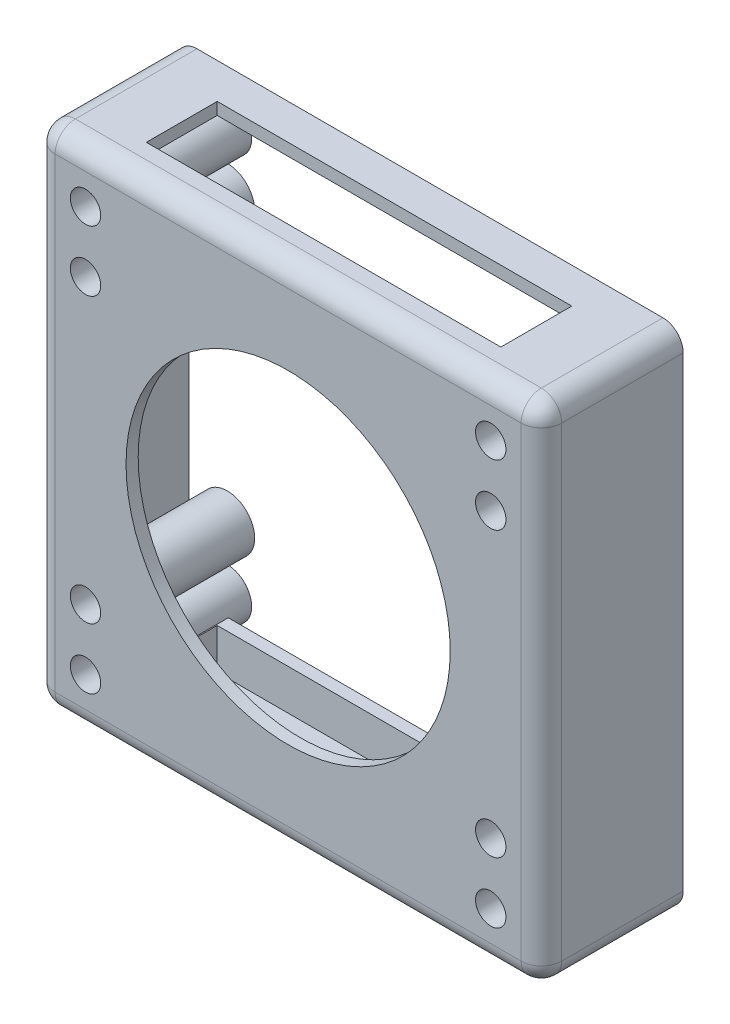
ISO-10303-21;
HEADER;
FILE_DESCRIPTION(('STEP AP214'),'2;1');
FILE_NAME('part.step','',(''),(''),'','','');
FILE_SCHEMA(('AUTOMOTIVE_DESIGN { 1 0 10303 214 1 1 1 1 }'));
ENDSEC;
DATA;
#1=APPLICATION_CONTEXT('core data for automotive mechanical design processes');
#2=APPLICATION_PROTOCOL_DEFINITION('international standard','automotive_design',2000,#1);
#3=PRODUCT_CONTEXT('',#1,'mechanical');
#4=PRODUCT('Part','Part','',(#3));
#5=PRODUCT_RELATED_PRODUCT_CATEGORY('part','',(#4));
#6=PRODUCT_DEFINITION_FORMATION('','',#4);
#7=PRODUCT_DEFINITION_CONTEXT('part definition',#1,'design');
#8=PRODUCT_DEFINITION('design','',#6,#7);
#9=PRODUCT_DEFINITION_SHAPE('','',#8);
#10=(LENGTH_UNIT() NAMED_UNIT(*) SI_UNIT(.MILLI.,.METRE.));
#11=(NAMED_UNIT(*) PLANE_ANGLE_UNIT() SI_UNIT($,.RADIAN.));
#12=(NAMED_UNIT(*) SI_UNIT($,.STERADIAN.) SOLID_ANGLE_UNIT());
#13=UNCERTAINTY_MEASURE_WITH_UNIT(LENGTH_MEASURE(1.E-05),#10,'distance_accuracy_value','');
#14=(GEOMETRIC_REPRESENTATION_CONTEXT(3) GLOBAL_UNCERTAINTY_ASSIGNED_CONTEXT((#13)) GLOBAL_UNIT_ASSIGNED_CONTEXT((#10,
#11,#12)) REPRESENTATION_CONTEXT('',''));
#15=CARTESIAN_POINT('',(0.,0.,0.));
#16=DIRECTION('',(0.,0.,1.));
#17=DIRECTION('',(1.,0.,0.));
#18=AXIS2_PLACEMENT_3D('',#15,#16,#17);
#19=CARTESIAN_POINT('',(0.,-57.5,30.));
#20=DIRECTION('',(1.,0.,0.));
#21=DIRECTION('',(0.,0.,-1.));
#22=AXIS2_PLACEMENT_3D('',#19,#20,#21);
#23=CYLINDRICAL_SURFACE('',#22,2.);
#24=DIRECTION('',(1.,0.,0.));
#25=VECTOR('',#24,1.);
#26=CARTESIAN_POINT('',(-62.5,-59.5,30.));
#27=LINE('',#26,#25);
#28=CARTESIAN_POINT('',(57.5,-59.5,30.));
#29=VERTEX_POINT('',#28);
#30=CARTESIAN_POINT('',(46.75,-59.5000000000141,30.));
#31=VERTEX_POINT('',#30);
#32=EDGE_CURVE('E566',#29,#31,#27,.F.);
#33=ORIENTED_EDGE('',*,*,#32,.T.);
#34=CARTESIAN_POINT('',(46.75,-57.5,30.));
#35=DIRECTION('',(1.,0.,0.));
#36=DIRECTION('',(0.,0.,-1.));
#37=AXIS2_PLACEMENT_3D('',#34,#35,#36);
#38=CIRCLE('',#37,2.);
#39=CARTESIAN_POINT('',(46.75,-57.5,32.));
#40=VERTEX_POINT('',#39);
#41=EDGE_CURVE('E325',#40,#31,#38,.T.);
#42=ORIENTED_EDGE('',*,*,#41,.F.);
#43=DIRECTION('',(-1.,0.,0.));
#44=VECTOR('',#43,1.);
#45=CARTESIAN_POINT('',(0.,-57.5,32.));
#46=LINE('',#45,#44);
#47=CARTESIAN_POINT('',(57.5,-57.5,32.));
#48=VERTEX_POINT('',#47);
#49=EDGE_CURVE('E541',#40,#48,#46,.F.);
#50=ORIENTED_EDGE('',*,*,#49,.T.);
#51=CARTESIAN_POINT('',(57.5,-57.5,30.));
#52=DIRECTION('',(1.,0.,0.));
#53=DIRECTION('',(0.,0.,-1.));
#54=AXIS2_PLACEMENT_3D('',#51,#52,#53);
#55=CIRCLE('',#54,2.);
#56=EDGE_CURVE('E500',#29,#48,#55,.F.);
#57=ORIENTED_EDGE('',*,*,#56,.F.);
#58=EDGE_LOOP('',(#33,#42,#50,#57));
#59=FACE_BOUND('',#58,.T.);
#60=ADVANCED_FACE('F59',(#59),#23,.F.);
#61=CARTESIAN_POINT('',(-50.,-35.,35.001));
#62=DIRECTION('',(0.,0.,-1.));
#63=DIRECTION('',(-1.,0.,0.));
#64=AXIS2_PLACEMENT_3D('',#61,#62,#63);
#65=CYLINDRICAL_SURFACE('',#64,1.875);
#66=CARTESIAN_POINT('',(-50.,-35.,0.));
#67=DIRECTION('',(0.,0.,1.));
#68=DIRECTION('',(1.,0.,0.));
#69=AXIS2_PLACEMENT_3D('',#66,#67,#68);
#70=CIRCLE('',#69,1.875);
#71=CARTESIAN_POINT('',(-48.125,-35.,0.));
#72=VERTEX_POINT('',#71);
#73=EDGE_CURVE('E432',#72,#72,#70,.T.);
#74=ORIENTED_EDGE('',*,*,#73,.F.);
#75=EDGE_LOOP('',(#74));
#76=FACE_BOUND('',#75,.T.);
#77=CARTESIAN_POINT('',(-50.,-35.,5.));
#78=DIRECTION('',(0.,0.,1.));
#79=DIRECTION('',(1.,0.,0.));
#80=AXIS2_PLACEMENT_3D('',#77,#78,#79);
#81=CIRCLE('',#80,1.875);
#82=CARTESIAN_POINT('',(-48.125,-35.,5.));
#83=VERTEX_POINT('',#82);
#84=EDGE_CURVE('E396',#83,#83,#81,.F.);
#85=ORIENTED_EDGE('',*,*,#84,.F.);
#86=EDGE_LOOP('',(#85));
#87=FACE_BOUND('',#86,.T.);
#88=ADVANCED_FACE('F753',(#76,#87),#65,.F.);
#89=CARTESIAN_POINT('',(-50.,35.,35.001));
#90=DIRECTION('',(0.,0.,-1.));
#91=DIRECTION('',(-1.,0.,0.));
#92=AXIS2_PLACEMENT_3D('',#89,#90,#91);
#93=CYLINDRICAL_SURFACE('',#92,1.875);
#94=CARTESIAN_POINT('',(-50.,35.,0.));
#95=DIRECTION('',(0.,0.,1.));
#96=DIRECTION('',(1.,0.,0.));
#97=AXIS2_PLACEMENT_3D('',#94,#95,#96);
#98=CIRCLE('',#97,1.875);
#99=CARTESIAN_POINT('',(-48.125,35.,0.));
#100=VERTEX_POINT('',#99);
#101=EDGE_CURVE('E433',#100,#100,#98,.T.);
#102=ORIENTED_EDGE('',*,*,#101,.F.);
#103=EDGE_LOOP('',(#102));
#104=FACE_BOUND('',#103,.T.);
#105=CARTESIAN_POINT('',(-50.,35.,5.));
#106=DIRECTION('',(0.,0.,1.));
#107=DIRECTION('',(1.,0.,0.));
#108=AXIS2_PLACEMENT_3D('',#105,#106,#107);
#109=CIRCLE('',#108,1.875);
#110=CARTESIAN_POINT('',(-48.125,35.,5.));
#111=VERTEX_POINT('',#110);
#112=EDGE_CURVE('E403',#111,#111,#109,.F.);
#113=ORIENTED_EDGE('',*,*,#112,.F.);
#114=EDGE_LOOP('',(#113));
#115=FACE_BOUND('',#114,.T.);
#116=ADVANCED_FACE('F761',(#104,#115),#93,.F.);
#117=CARTESIAN_POINT('',(50.,35.,35.001));
#118=DIRECTION('',(0.,0.,-1.));
#119=DIRECTION('',(-1.,0.,0.));
#120=AXIS2_PLACEMENT_3D('',#117,#118,#119);
#121=CYLINDRICAL_SURFACE('',#120,1.875);
#122=CARTESIAN_POINT('',(50.,35.,0.));
#123=DIRECTION('',(0.,0.,1.));
#124=DIRECTION('',(1.,0.,0.));
#125=AXIS2_PLACEMENT_3D('',#122,#123,#124);
#126=CIRCLE('',#125,1.875);
#127=CARTESIAN_POINT('',(51.875,35.,0.));
#128=VERTEX_POINT('',#127);
#129=EDGE_CURVE('E426',#128,#128,#126,.T.);
#130=ORIENTED_EDGE('',*,*,#129,.F.);
#131=EDGE_LOOP('',(#130));
#132=FACE_BOUND('',#131,.T.);
#133=CARTESIAN_POINT('',(50.,35.,5.));
#134=DIRECTION('',(0.,0.,1.));
#135=DIRECTION('',(1.,0.,0.));
#136=AXIS2_PLACEMENT_3D('',#133,#134,#135);
#137=CIRCLE('',#136,1.875);
#138=CARTESIAN_POINT('',(51.875,35.,5.));
#139=VERTEX_POINT('',#138);
#140=EDGE_CURVE('E412',#139,#139,#137,.F.);
#141=ORIENTED_EDGE('',*,*,#140,.F.);
#142=EDGE_LOOP('',(#141));
#143=FACE_BOUND('',#142,.T.);
#144=ADVANCED_FACE('F930',(#132,#143),#121,.F.);
#145=CARTESIAN_POINT('',(50.,-35.,35.001));
#146=DIRECTION('',(0.,0.,-1.));
#147=DIRECTION('',(-1.,0.,0.));
#148=AXIS2_PLACEMENT_3D('',#145,#146,#147);
#149=CYLINDRICAL_SURFACE('',#148,1.875);
#150=CARTESIAN_POINT('',(50.,-35.,0.));
#151=DIRECTION('',(0.,0.,1.));
#152=DIRECTION('',(1.,0.,0.));
#153=AXIS2_PLACEMENT_3D('',#150,#151,#152);
#154=CIRCLE('',#153,1.875);
#155=CARTESIAN_POINT('',(51.875,-35.,0.));
#156=VERTEX_POINT('',#155);
#157=EDGE_CURVE('E429',#156,#156,#154,.T.);
#158=ORIENTED_EDGE('',*,*,#157,.F.);
#159=EDGE_LOOP('',(#158));
#160=FACE_BOUND('',#159,.T.);
#161=CARTESIAN_POINT('',(50.,-35.,5.));
#162=DIRECTION('',(0.,0.,1.));
#163=DIRECTION('',(1.,0.,0.));
#164=AXIS2_PLACEMENT_3D('',#161,#162,#163);
#165=CIRCLE('',#164,1.875);
#166=CARTESIAN_POINT('',(51.875,-35.,5.));
#167=VERTEX_POINT('',#166);
#168=EDGE_CURVE('E423',#167,#167,#165,.F.);
#169=ORIENTED_EDGE('',*,*,#168,.F.);
#170=EDGE_LOOP('',(#169));
#171=FACE_BOUND('',#170,.T.);
#172=ADVANCED_FACE('F927',(#160,#171),#149,.F.);
#173=CARTESIAN_POINT('',(0.,0.,0.));
#174=DIRECTION('',(0.,0.,-1.));
#175=DIRECTION('',(-1.,0.,0.));
#176=AXIS2_PLACEMENT_3D('',#173,#174,#175);
#177=PLANE('',#176);
#178=DIRECTION('',(1.,0.,0.));
#179=VECTOR('',#178,1.);
#180=CARTESIAN_POINT('',(-62.5,-62.5,0.));
#181=LINE('',#180,#179);
#182=CARTESIAN_POINT('',(-57.5,-62.5,0.));
#183=VERTEX_POINT('',#182);
#184=CARTESIAN_POINT('',(57.5,-62.5,0.));
#185=VERTEX_POINT('',#184);
#186=EDGE_CURVE('E605',#183,#185,#181,.T.);
#187=ORIENTED_EDGE('',*,*,#186,.F.);
#188=CARTESIAN_POINT('',(-57.5,-57.5,0.));
#189=DIRECTION('',(0.,0.,-1.));
#190=DIRECTION('',(-1.,0.,0.));
#191=AXIS2_PLACEMENT_3D('',#188,#189,#190);
#192=CIRCLE('',#191,5.);
#193=CARTESIAN_POINT('',(-62.5,-57.5,0.));
#194=VERTEX_POINT('',#193);
#195=EDGE_CURVE('E12',#183,#194,#192,.T.);
#196=ORIENTED_EDGE('',*,*,#195,.T.);
#197=DIRECTION('',(0.,-1.,0.));
#198=VECTOR('',#197,1.);
#199=CARTESIAN_POINT('',(-62.5,-62.5,0.));
#200=LINE('',#199,#198);
#201=CARTESIAN_POINT('',(-62.5,57.5,0.));
#202=VERTEX_POINT('',#201);
#203=EDGE_CURVE('E602',#202,#194,#200,.T.);
#204=ORIENTED_EDGE('',*,*,#203,.F.);
#205=CARTESIAN_POINT('',(-57.5,57.5,0.));
#206=DIRECTION('',(0.,0.,-1.));
#207=DIRECTION('',(-1.,0.,0.));
#208=AXIS2_PLACEMENT_3D('',#205,#206,#207);
#209=CIRCLE('',#208,5.);
#210=CARTESIAN_POINT('',(-57.5,62.5,0.));
#211=VERTEX_POINT('',#210);
#212=EDGE_CURVE('E644',#202,#211,#209,.T.);
#213=ORIENTED_EDGE('',*,*,#212,.T.);
#214=DIRECTION('',(-1.,0.,0.));
#215=VECTOR('',#214,1.);
#216=CARTESIAN_POINT('',(-62.5,62.5,0.));
#217=LINE('',#216,#215);
#218=CARTESIAN_POINT('',(57.5,62.5,0.));
#219=VERTEX_POINT('',#218);
#220=EDGE_CURVE('E599',#219,#211,#217,.T.);
#221=ORIENTED_EDGE('',*,*,#220,.F.);
#222=CARTESIAN_POINT('',(57.5,57.5,0.));
#223=DIRECTION('',(0.,0.,-1.));
#224=DIRECTION('',(-1.,0.,0.));
#225=AXIS2_PLACEMENT_3D('',#222,#223,#224);
#226=CIRCLE('',#225,5.);
#227=CARTESIAN_POINT('',(62.5,57.5,0.));
#228=VERTEX_POINT('',#227);
#229=EDGE_CURVE('E642',#219,#228,#226,.T.);
#230=ORIENTED_EDGE('',*,*,#229,.T.);
#231=DIRECTION('',(0.,1.,0.));
#232=VECTOR('',#231,1.);
#233=CARTESIAN_POINT('',(62.5,-62.5,0.));
#234=LINE('',#233,#232);
#235=CARTESIAN_POINT('',(62.5,-57.5,0.));
#236=VERTEX_POINT('',#235);
#237=EDGE_CURVE('E596',#236,#228,#234,.T.);
#238=ORIENTED_EDGE('',*,*,#237,.F.);
#239=CARTESIAN_POINT('',(57.5,-57.5,0.));
#240=DIRECTION('',(0.,0.,-1.));
#241=DIRECTION('',(-1.,0.,0.));
#242=AXIS2_PLACEMENT_3D('',#239,#240,#241);
#243=CIRCLE('',#242,5.);
#244=EDGE_CURVE('E68',#236,#185,#243,.T.);
#245=ORIENTED_EDGE('',*,*,#244,.T.);
#246=EDGE_LOOP('',(#187,#196,#204,#213,#221,#230,#238,#245));
#247=FACE_BOUND('',#246,.T.);
#248=CARTESIAN_POINT('',(-57.5,-57.5,0.));
#249=DIRECTION('',(0.,0.,-1.));
#250=DIRECTION('',(-1.,0.,0.));
#251=AXIS2_PLACEMENT_3D('',#248,#249,#250);
#252=CIRCLE('',#251,2.);
#253=CARTESIAN_POINT('',(-57.5,-59.5,0.));
#254=VERTEX_POINT('',#253);
#255=CARTESIAN_POINT('',(-59.5,-57.5,0.));
#256=VERTEX_POINT('',#255);
#257=EDGE_CURVE('E583',#254,#256,#252,.T.);
#258=ORIENTED_EDGE('',*,*,#257,.F.);
#259=DIRECTION('',(1.,0.,0.));
#260=VECTOR('',#259,1.);
#261=CARTESIAN_POINT('',(0.,-59.5,0.));
#262=LINE('',#261,#260);
#263=CARTESIAN_POINT('',(57.5,-59.5,0.));
#264=VERTEX_POINT('',#263);
#265=EDGE_CURVE('E549',#254,#264,#262,.T.);
#266=ORIENTED_EDGE('',*,*,#265,.T.);
#267=CARTESIAN_POINT('',(57.5,-57.5,0.));
#268=DIRECTION('',(0.,0.,-1.));
#269=DIRECTION('',(-1.,0.,0.));
#270=AXIS2_PLACEMENT_3D('',#267,#268,#269);
#271=CIRCLE('',#270,2.);
#272=CARTESIAN_POINT('',(59.5,-57.5,0.));
#273=VERTEX_POINT('',#272);
#274=EDGE_CURVE('E581',#273,#264,#271,.T.);
#275=ORIENTED_EDGE('',*,*,#274,.F.);
#276=DIRECTION('',(0.,1.,0.));
#277=VECTOR('',#276,1.);
#278=CARTESIAN_POINT('',(59.5,0.,0.));
#279=LINE('',#278,#277);
#280=CARTESIAN_POINT('',(59.5,57.5,0.));
#281=VERTEX_POINT('',#280);
#282=EDGE_CURVE('E530',#273,#281,#279,.T.);
#283=ORIENTED_EDGE('',*,*,#282,.T.);
#284=CARTESIAN_POINT('',(57.5,57.5,0.));
#285=DIRECTION('',(0.,0.,-1.));
#286=DIRECTION('',(-1.,0.,0.));
#287=AXIS2_PLACEMENT_3D('',#284,#285,#286);
#288=CIRCLE('',#287,2.);
#289=CARTESIAN_POINT('',(57.5,59.5,0.));
#290=VERTEX_POINT('',#289);
#291=EDGE_CURVE('E509',#290,#281,#288,.T.);
#292=ORIENTED_EDGE('',*,*,#291,.F.);
#293=DIRECTION('',(-1.,0.,0.));
#294=VECTOR('',#293,1.);
#295=CARTESIAN_POINT('',(0.,59.5,0.));
#296=LINE('',#295,#294);
#297=CARTESIAN_POINT('',(-57.5,59.5,0.));
#298=VERTEX_POINT('',#297);
#299=EDGE_CURVE('E580',#290,#298,#296,.T.);
#300=ORIENTED_EDGE('',*,*,#299,.T.);
#301=CARTESIAN_POINT('',(-57.5,57.5,0.));
#302=DIRECTION('',(0.,0.,-1.));
#303=DIRECTION('',(-1.,0.,0.));
#304=AXIS2_PLACEMENT_3D('',#301,#302,#303);
#305=CIRCLE('',#304,2.);
#306=CARTESIAN_POINT('',(-59.5,57.5,0.));
#307=VERTEX_POINT('',#306);
#308=EDGE_CURVE('E584',#307,#298,#305,.T.);
#309=ORIENTED_EDGE('',*,*,#308,.F.);
#310=DIRECTION('',(0.,-1.,0.));
#311=VECTOR('',#310,1.);
#312=CARTESIAN_POINT('',(-59.5,0.,0.));
#313=LINE('',#312,#311);
#314=EDGE_CURVE('E587',#307,#256,#313,.T.);
#315=ORIENTED_EDGE('',*,*,#314,.T.);
#316=EDGE_LOOP('',(#258,#266,#275,#283,#292,#300,#309,#315));
#317=FACE_BOUND('',#316,.T.);
#318=ADVANCED_FACE('F713',(#247,#317),#177,.T.);
#319=CARTESIAN_POINT('',(62.5,-62.5,35.));
#320=DIRECTION('',(-1.,0.,0.));
#321=DIRECTION('',(0.,0.,1.));
#322=AXIS2_PLACEMENT_3D('',#319,#320,#321);
#323=PLANE('',#322);
#324=DIRECTION('',(0.,1.,0.));
#325=VECTOR('',#324,1.);
#326=CARTESIAN_POINT('',(62.5,-62.5,30.));
#327=LINE('',#326,#325);
#328=CARTESIAN_POINT('',(62.5,57.5,30.));
#329=VERTEX_POINT('',#328);
#330=CARTESIAN_POINT('',(62.5,-57.5,30.));
#331=VERTEX_POINT('',#330);
#332=EDGE_CURVE('E638',#329,#331,#327,.F.);
#333=ORIENTED_EDGE('',*,*,#332,.T.);
#334=DIRECTION('',(0.,0.,-1.));
#335=VECTOR('',#334,1.);
#336=CARTESIAN_POINT('',(62.5,-57.5,35.));
#337=LINE('',#336,#335);
#338=EDGE_CURVE('E640',#331,#236,#337,.T.);
#339=ORIENTED_EDGE('',*,*,#338,.T.);
#340=ORIENTED_EDGE('',*,*,#237,.T.);
#341=DIRECTION('',(0.,0.,-1.));
#342=VECTOR('',#341,1.);
#343=CARTESIAN_POINT('',(62.5,57.5,35.));
#344=LINE('',#343,#342);
#345=EDGE_CURVE('E636',#228,#329,#344,.F.);
#346=ORIENTED_EDGE('',*,*,#345,.T.);
#347=EDGE_LOOP('',(#333,#339,#340,#346));
#348=FACE_BOUND('',#347,.T.);
#349=ADVANCED_FACE('F717',(#348),#323,.F.);
#350=CARTESIAN_POINT('',(-62.5,62.5,35.));
#351=DIRECTION('',(0.,-1.,0.));
#352=DIRECTION('',(0.,0.,-1.));
#353=AXIS2_PLACEMENT_3D('',#350,#351,#352);
#354=PLANE('',#353);
#355=DIRECTION('',(-1.,0.,0.));
#356=VECTOR('',#355,1.);
#357=CARTESIAN_POINT('',(-43.75,62.5,8.74999999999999));
#358=LINE('',#357,#356);
#359=CARTESIAN_POINT('',(43.75,62.5,8.74999999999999));
#360=VERTEX_POINT('',#359);
#361=CARTESIAN_POINT('',(-43.75,62.5,8.74999999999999));
#362=VERTEX_POINT('',#361);
#363=EDGE_CURVE('E477',#360,#362,#358,.T.);
#364=ORIENTED_EDGE('',*,*,#363,.F.);
#365=DIRECTION('',(0.,0.,-1.));
#366=VECTOR('',#365,1.);
#367=CARTESIAN_POINT('',(43.75,62.5,26.25));
#368=LINE('',#367,#366);
#369=CARTESIAN_POINT('',(43.75,62.5,26.25));
#370=VERTEX_POINT('',#369);
#371=EDGE_CURVE('E480',#370,#360,#368,.T.);
#372=ORIENTED_EDGE('',*,*,#371,.F.);
#373=DIRECTION('',(1.,0.,0.));
#374=VECTOR('',#373,1.);
#375=CARTESIAN_POINT('',(-43.75,62.5,26.25));
#376=LINE('',#375,#374);
#377=CARTESIAN_POINT('',(-43.75,62.5,26.25));
#378=VERTEX_POINT('',#377);
#379=EDGE_CURVE('E470',#378,#370,#376,.T.);
#380=ORIENTED_EDGE('',*,*,#379,.F.);
#381=DIRECTION('',(0.,0.,1.));
#382=VECTOR('',#381,1.);
#383=CARTESIAN_POINT('',(-43.75,62.5,26.25));
#384=LINE('',#383,#382);
#385=EDGE_CURVE('E474',#362,#378,#384,.T.);
#386=ORIENTED_EDGE('',*,*,#385,.F.);
#387=EDGE_LOOP('',(#364,#372,#380,#386));
#388=FACE_BOUND('',#387,.T.);
#389=ORIENTED_EDGE('',*,*,#220,.T.);
#390=DIRECTION('',(0.,0.,-1.));
#391=VECTOR('',#390,1.);
#392=CARTESIAN_POINT('',(-57.5,62.5,35.));
#393=LINE('',#392,#391);
#394=CARTESIAN_POINT('',(-57.5,62.5,30.));
#395=VERTEX_POINT('',#394);
#396=EDGE_CURVE('E634',#211,#395,#393,.F.);
#397=ORIENTED_EDGE('',*,*,#396,.T.);
#398=DIRECTION('',(-1.,0.,0.));
#399=VECTOR('',#398,1.);
#400=CARTESIAN_POINT('',(-62.5,62.5,30.));
#401=LINE('',#400,#399);
#402=CARTESIAN_POINT('',(57.5,62.5,30.));
#403=VERTEX_POINT('',#402);
#404=EDGE_CURVE('E632',#395,#403,#401,.F.);
#405=ORIENTED_EDGE('',*,*,#404,.T.);
#406=DIRECTION('',(0.,0.,-1.));
#407=VECTOR('',#406,1.);
#408=CARTESIAN_POINT('',(57.5,62.5,35.));
#409=LINE('',#408,#407);
#410=EDGE_CURVE('E630',#403,#219,#409,.T.);
#411=ORIENTED_EDGE('',*,*,#410,.T.);
#412=EDGE_LOOP('',(#389,#397,#405,#411));
#413=FACE_BOUND('',#412,.T.);
#414=ADVANCED_FACE('F702',(#388,#413),#354,.F.);
#415=CARTESIAN_POINT('',(-62.5,-62.5,35.));
#416=DIRECTION('',(1.,0.,0.));
#417=DIRECTION('',(0.,0.,-1.));
#418=AXIS2_PLACEMENT_3D('',#415,#416,#417);
#419=PLANE('',#418);
#420=ORIENTED_EDGE('',*,*,#203,.T.);
#421=DIRECTION('',(0.,0.,-1.));
#422=VECTOR('',#421,1.);
#423=CARTESIAN_POINT('',(-62.5,-57.5,35.));
#424=LINE('',#423,#422);
#425=CARTESIAN_POINT('',(-62.5,-57.5,30.));
#426=VERTEX_POINT('',#425);
#427=EDGE_CURVE('E628',#194,#426,#424,.F.);
#428=ORIENTED_EDGE('',*,*,#427,.T.);
#429=DIRECTION('',(0.,-1.,0.));
#430=VECTOR('',#429,1.);
#431=CARTESIAN_POINT('',(-62.5,-62.5,30.));
#432=LINE('',#431,#430);
#433=CARTESIAN_POINT('',(-62.5,57.5,30.));
#434=VERTEX_POINT('',#433);
#435=EDGE_CURVE('E626',#426,#434,#432,.F.);
#436=ORIENTED_EDGE('',*,*,#435,.T.);
#437=DIRECTION('',(0.,0.,-1.));
#438=VECTOR('',#437,1.);
#439=CARTESIAN_POINT('',(-62.5,57.5,35.));
#440=LINE('',#439,#438);
#441=EDGE_CURVE('E624',#434,#202,#440,.T.);
#442=ORIENTED_EDGE('',*,*,#441,.T.);
#443=EDGE_LOOP('',(#420,#428,#436,#442));
#444=FACE_BOUND('',#443,.T.);
#445=ADVANCED_FACE('F742',(#444),#419,.F.);
#446=CARTESIAN_POINT('',(-62.5,-62.5,35.));
#447=DIRECTION('',(0.,1.,0.));
#448=DIRECTION('',(0.,0.,1.));
#449=AXIS2_PLACEMENT_3D('',#446,#447,#448);
#450=PLANE('',#449);
#451=DIRECTION('',(1.,0.,0.));
#452=VECTOR('',#451,1.);
#453=CARTESIAN_POINT('',(-62.5,-62.5,30.));
#454=LINE('',#453,#452);
#455=CARTESIAN_POINT('',(57.5,-62.5,30.));
#456=VERTEX_POINT('',#455);
#457=CARTESIAN_POINT('',(-57.5,-62.5,30.));
#458=VERTEX_POINT('',#457);
#459=EDGE_CURVE('E619',#456,#458,#454,.F.);
#460=ORIENTED_EDGE('',*,*,#459,.T.);
#461=DIRECTION('',(0.,0.,-1.));
#462=VECTOR('',#461,1.);
#463=CARTESIAN_POINT('',(-57.5,-62.5,35.));
#464=LINE('',#463,#462);
#465=EDGE_CURVE('E622',#458,#183,#464,.T.);
#466=ORIENTED_EDGE('',*,*,#465,.T.);
#467=ORIENTED_EDGE('',*,*,#186,.T.);
#468=DIRECTION('',(0.,0.,-1.));
#469=VECTOR('',#468,1.);
#470=CARTESIAN_POINT('',(57.5,-62.5,35.));
#471=LINE('',#470,#469);
#472=EDGE_CURVE('E617',#185,#456,#471,.F.);
#473=ORIENTED_EDGE('',*,*,#472,.T.);
#474=EDGE_LOOP('',(#460,#466,#467,#473));
#475=FACE_BOUND('',#474,.T.);
#476=ADVANCED_FACE('F734',(#475),#450,.F.);
#477=CARTESIAN_POINT('',(0.,0.,35.));
#478=DIRECTION('',(0.,0.,-1.));
#479=DIRECTION('',(-1.,0.,0.));
#480=AXIS2_PLACEMENT_3D('',#477,#478,#479);
#481=PLANE('',#480);
#482=CARTESIAN_POINT('',(-50.,50.,35.));
#483=DIRECTION('',(0.,0.,-1.));
#484=DIRECTION('',(-1.,0.,0.));
#485=AXIS2_PLACEMENT_3D('',#482,#483,#484);
#486=CIRCLE('',#485,3.75000000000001);
#487=CARTESIAN_POINT('',(-53.75,50.,35.));
#488=VERTEX_POINT('',#487);
#489=EDGE_CURVE('E348',#488,#488,#486,.T.);
#490=ORIENTED_EDGE('',*,*,#489,.T.);
#491=EDGE_LOOP('',(#490));
#492=FACE_BOUND('',#491,.T.);
#493=CARTESIAN_POINT('',(-50.,-50.,35.));
#494=DIRECTION('',(0.,0.,-1.));
#495=DIRECTION('',(-1.,0.,0.));
#496=AXIS2_PLACEMENT_3D('',#493,#494,#495);
#497=CIRCLE('',#496,3.75);
#498=CARTESIAN_POINT('',(-53.75,-50.,35.));
#499=VERTEX_POINT('',#498);
#500=EDGE_CURVE('E354',#499,#499,#497,.T.);
#501=ORIENTED_EDGE('',*,*,#500,.T.);
#502=EDGE_LOOP('',(#501));
#503=FACE_BOUND('',#502,.T.);
#504=CARTESIAN_POINT('',(50.,-50.,35.));
#505=DIRECTION('',(0.,0.,-1.));
#506=DIRECTION('',(-1.,0.,0.));
#507=AXIS2_PLACEMENT_3D('',#504,#505,#506);
#508=CIRCLE('',#507,3.75000000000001);
#509=CARTESIAN_POINT('',(46.25,-50.,35.));
#510=VERTEX_POINT('',#509);
#511=EDGE_CURVE('E360',#510,#510,#508,.T.);
#512=ORIENTED_EDGE('',*,*,#511,.T.);
#513=EDGE_LOOP('',(#512));
#514=FACE_BOUND('',#513,.T.);
#515=CARTESIAN_POINT('',(50.,50.,35.));
#516=DIRECTION('',(0.,0.,-1.));
#517=DIRECTION('',(-1.,0.,0.));
#518=AXIS2_PLACEMENT_3D('',#515,#516,#517);
#519=CIRCLE('',#518,3.75000000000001);
#520=CARTESIAN_POINT('',(46.25,50.,35.));
#521=VERTEX_POINT('',#520);
#522=EDGE_CURVE('E347',#521,#521,#519,.T.);
#523=ORIENTED_EDGE('',*,*,#522,.T.);
#524=EDGE_LOOP('',(#523));
#525=FACE_BOUND('',#524,.T.);
#526=CARTESIAN_POINT('',(-50.,-35.,35.));
#527=DIRECTION('',(0.,0.,-1.));
#528=DIRECTION('',(-1.,0.,0.));
#529=AXIS2_PLACEMENT_3D('',#526,#527,#528);
#530=CIRCLE('',#529,3.75);
#531=CARTESIAN_POINT('',(-53.75,-35.,35.));
#532=VERTEX_POINT('',#531);
#533=EDGE_CURVE('E397',#532,#532,#530,.T.);
#534=ORIENTED_EDGE('',*,*,#533,.T.);
#535=EDGE_LOOP('',(#534));
#536=FACE_BOUND('',#535,.T.);
#537=CARTESIAN_POINT('',(-50.,35.,35.));
#538=DIRECTION('',(0.,0.,-1.));
#539=DIRECTION('',(-1.,0.,0.));
#540=AXIS2_PLACEMENT_3D('',#537,#538,#539);
#541=CIRCLE('',#540,3.75);
#542=CARTESIAN_POINT('',(-53.75,35.,35.));
#543=VERTEX_POINT('',#542);
#544=EDGE_CURVE('E407',#543,#543,#541,.T.);
#545=ORIENTED_EDGE('',*,*,#544,.T.);
#546=EDGE_LOOP('',(#545));
#547=FACE_BOUND('',#546,.T.);
#548=CARTESIAN_POINT('',(50.,35.,35.));
#549=DIRECTION('',(0.,0.,-1.));
#550=DIRECTION('',(-1.,0.,0.));
#551=AXIS2_PLACEMENT_3D('',#548,#549,#550);
#552=CIRCLE('',#551,3.75);
#553=CARTESIAN_POINT('',(46.25,35.,35.));
#554=VERTEX_POINT('',#553);
#555=EDGE_CURVE('E392',#554,#554,#552,.T.);
#556=ORIENTED_EDGE('',*,*,#555,.T.);
#557=EDGE_LOOP('',(#556));
#558=FACE_BOUND('',#557,.T.);
#559=CARTESIAN_POINT('',(50.,-35.,35.));
#560=DIRECTION('',(0.,0.,-1.));
#561=DIRECTION('',(-1.,0.,0.));
#562=AXIS2_PLACEMENT_3D('',#559,#560,#561);
#563=CIRCLE('',#562,3.75);
#564=CARTESIAN_POINT('',(46.25,-35.,35.));
#565=VERTEX_POINT('',#564);
#566=EDGE_CURVE('E400',#565,#565,#563,.T.);
#567=ORIENTED_EDGE('',*,*,#566,.T.);
#568=EDGE_LOOP('',(#567));
#569=FACE_BOUND('',#568,.T.);
#570=CARTESIAN_POINT('',(0.,0.,35.));
#571=DIRECTION('',(0.,0.,1.));
#572=DIRECTION('',(1.,0.,0.));
#573=AXIS2_PLACEMENT_3D('',#570,#571,#572);
#574=CIRCLE('',#573,40.);
#575=CARTESIAN_POINT('',(40.,0.,35.));
#576=VERTEX_POINT('',#575);
#577=EDGE_CURVE('E497',#576,#576,#574,.T.);
#578=ORIENTED_EDGE('',*,*,#577,.F.);
#579=EDGE_LOOP('',(#578));
#580=FACE_BOUND('',#579,.T.);
#581=DIRECTION('',(0.,-1.,0.));
#582=VECTOR('',#581,1.);
#583=CARTESIAN_POINT('',(-57.5,0.,35.));
#584=LINE('',#583,#582);
#585=CARTESIAN_POINT('',(-57.5,57.5,35.));
#586=VERTEX_POINT('',#585);
#587=CARTESIAN_POINT('',(-57.5,-57.5,35.));
#588=VERTEX_POINT('',#587);
#589=EDGE_CURVE('E612',#586,#588,#584,.T.);
#590=ORIENTED_EDGE('',*,*,#589,.T.);
#591=DIRECTION('',(1.,0.,0.));
#592=VECTOR('',#591,1.);
#593=CARTESIAN_POINT('',(0.,-57.5,35.));
#594=LINE('',#593,#592);
#595=CARTESIAN_POINT('',(57.5,-57.5,35.));
#596=VERTEX_POINT('',#595);
#597=EDGE_CURVE('E614',#588,#596,#594,.T.);
#598=ORIENTED_EDGE('',*,*,#597,.T.);
#599=DIRECTION('',(0.,1.,0.));
#600=VECTOR('',#599,1.);
#601=CARTESIAN_POINT('',(57.5,0.,35.));
#602=LINE('',#601,#600);
#603=CARTESIAN_POINT('',(57.5,57.5,35.));
#604=VERTEX_POINT('',#603);
#605=EDGE_CURVE('E608',#596,#604,#602,.T.);
#606=ORIENTED_EDGE('',*,*,#605,.T.);
#607=DIRECTION('',(-1.,0.,0.));
#608=VECTOR('',#607,1.);
#609=CARTESIAN_POINT('',(0.,57.5,35.));
#610=LINE('',#609,#608);
#611=EDGE_CURVE('E610',#604,#586,#610,.T.);
#612=ORIENTED_EDGE('',*,*,#611,.T.);
#613=EDGE_LOOP('',(#590,#598,#606,#612));
#614=FACE_BOUND('',#613,.T.);
#615=ADVANCED_FACE('F692',(#492,#503,#514,#525,#536,#547,#558,#569,#580,#614),#481,.F.);
#616=CARTESIAN_POINT('',(-57.5,57.5,35.));
#617=DIRECTION('',(0.,0.,-1.));
#618=DIRECTION('',(-1.,0.,0.));
#619=AXIS2_PLACEMENT_3D('',#616,#617,#618);
#620=CYLINDRICAL_SURFACE('',#619,5.);
#621=ORIENTED_EDGE('',*,*,#212,.F.);
#622=ORIENTED_EDGE('',*,*,#441,.F.);
#623=CARTESIAN_POINT('',(-57.5,57.5,30.));
#624=DIRECTION('',(0.,0.,1.));
#625=DIRECTION('',(1.,0.,0.));
#626=AXIS2_PLACEMENT_3D('',#623,#624,#625);
#627=CIRCLE('',#626,5.);
#628=EDGE_CURVE('E63',#395,#434,#627,.T.);
#629=ORIENTED_EDGE('',*,*,#628,.F.);
#630=ORIENTED_EDGE('',*,*,#396,.F.);
#631=EDGE_LOOP('',(#621,#622,#629,#630));
#632=FACE_BOUND('',#631,.T.);
#633=ADVANCED_FACE('F61',(#632),#620,.T.);
#634=CARTESIAN_POINT('',(0.,57.5,30.));
#635=DIRECTION('',(-1.,0.,0.));
#636=DIRECTION('',(0.,0.,1.));
#637=AXIS2_PLACEMENT_3D('',#634,#635,#636);
#638=CYLINDRICAL_SURFACE('',#637,5.);
#639=CARTESIAN_POINT('',(57.5,57.5,30.));
#640=DIRECTION('',(1.,0.,0.));
#641=DIRECTION('',(0.,0.,-1.));
#642=AXIS2_PLACEMENT_3D('',#639,#640,#641);
#643=CIRCLE('',#642,5.);
#644=EDGE_CURVE('E671',#403,#604,#643,.T.);
#645=ORIENTED_EDGE('',*,*,#644,.F.);
#646=ORIENTED_EDGE('',*,*,#404,.F.);
#647=CARTESIAN_POINT('',(-57.5,57.5,30.));
#648=DIRECTION('',(-1.,0.,0.));
#649=DIRECTION('',(0.,0.,1.));
#650=AXIS2_PLACEMENT_3D('',#647,#648,#649);
#651=CIRCLE('',#650,5.);
#652=EDGE_CURVE('E673',#586,#395,#651,.T.);
#653=ORIENTED_EDGE('',*,*,#652,.F.);
#654=ORIENTED_EDGE('',*,*,#611,.F.);
#655=EDGE_LOOP('',(#645,#646,#653,#654));
#656=FACE_BOUND('',#655,.T.);
#657=ADVANCED_FACE('F699',(#656),#638,.T.);
#658=CARTESIAN_POINT('',(57.5,57.5,35.));
#659=DIRECTION('',(0.,0.,-1.));
#660=DIRECTION('',(-1.,0.,0.));
#661=AXIS2_PLACEMENT_3D('',#658,#659,#660);
#662=CYLINDRICAL_SURFACE('',#661,5.);
#663=ORIENTED_EDGE('',*,*,#229,.F.);
#664=ORIENTED_EDGE('',*,*,#410,.F.);
#665=CARTESIAN_POINT('',(57.5,57.5,30.));
#666=DIRECTION('',(0.,0.,1.));
#667=DIRECTION('',(1.,0.,0.));
#668=AXIS2_PLACEMENT_3D('',#665,#666,#667);
#669=CIRCLE('',#668,5.);
#670=EDGE_CURVE('E668',#329,#403,#669,.T.);
#671=ORIENTED_EDGE('',*,*,#670,.F.);
#672=ORIENTED_EDGE('',*,*,#345,.F.);
#673=EDGE_LOOP('',(#663,#664,#671,#672));
#674=FACE_BOUND('',#673,.T.);
#675=ADVANCED_FACE('F707',(#674),#662,.T.);
#676=CARTESIAN_POINT('',(-57.5,57.5,30.));
#677=DIRECTION('',(0.,0.,1.));
#678=DIRECTION('',(1.,0.,0.));
#679=AXIS2_PLACEMENT_3D('',#676,#677,#678);
#680=SPHERICAL_SURFACE('',#679,5.);
#681=ORIENTED_EDGE('',*,*,#652,.T.);
#682=ORIENTED_EDGE('',*,*,#628,.T.);
#683=CARTESIAN_POINT('',(-57.5,57.5,30.));
#684=DIRECTION('',(0.,1.,0.));
#685=DIRECTION('',(0.,0.,1.));
#686=AXIS2_PLACEMENT_3D('',#683,#684,#685);
#687=CIRCLE('',#686,5.);
#688=EDGE_CURVE('E665',#586,#434,#687,.F.);
#689=ORIENTED_EDGE('',*,*,#688,.F.);
#690=EDGE_LOOP('',(#681,#682,#689));
#691=FACE_BOUND('',#690,.T.);
#692=ADVANCED_FACE('F680',(#691),#680,.T.);
#693=CARTESIAN_POINT('',(57.5,57.5,30.));
#694=DIRECTION('',(0.,0.,1.));
#695=DIRECTION('',(1.,0.,0.));
#696=AXIS2_PLACEMENT_3D('',#693,#694,#695);
#697=SPHERICAL_SURFACE('',#696,5.);
#698=ORIENTED_EDGE('',*,*,#670,.T.);
#699=ORIENTED_EDGE('',*,*,#644,.T.);
#700=CARTESIAN_POINT('',(57.5,57.5,30.));
#701=DIRECTION('',(0.,1.,0.));
#702=DIRECTION('',(0.,0.,1.));
#703=AXIS2_PLACEMENT_3D('',#700,#701,#702);
#704=CIRCLE('',#703,5.);
#705=EDGE_CURVE('E662',#329,#604,#704,.F.);
#706=ORIENTED_EDGE('',*,*,#705,.F.);
#707=EDGE_LOOP('',(#698,#699,#706));
#708=FACE_BOUND('',#707,.T.);
#709=ADVANCED_FACE('F1455',(#708),#697,.T.);
#710=CARTESIAN_POINT('',(-57.5,-57.5,35.));
#711=DIRECTION('',(0.,0.,-1.));
#712=DIRECTION('',(-1.,0.,0.));
#713=AXIS2_PLACEMENT_3D('',#710,#711,#712);
#714=CYLINDRICAL_SURFACE('',#713,5.);
#715=ORIENTED_EDGE('',*,*,#195,.F.);
#716=ORIENTED_EDGE('',*,*,#465,.F.);
#717=CARTESIAN_POINT('',(-57.5,-57.5,30.));
#718=DIRECTION('',(0.,0.,1.));
#719=DIRECTION('',(1.,0.,0.));
#720=AXIS2_PLACEMENT_3D('',#717,#718,#719);
#721=CIRCLE('',#720,5.);
#722=EDGE_CURVE('E659',#426,#458,#721,.T.);
#723=ORIENTED_EDGE('',*,*,#722,.F.);
#724=ORIENTED_EDGE('',*,*,#427,.F.);
#725=EDGE_LOOP('',(#715,#716,#723,#724));
#726=FACE_BOUND('',#725,.T.);
#727=ADVANCED_FACE('F740',(#726),#714,.T.);
#728=CARTESIAN_POINT('',(-57.5,0.,30.));
#729=DIRECTION('',(0.,-1.,0.));
#730=DIRECTION('',(0.,0.,-1.));
#731=AXIS2_PLACEMENT_3D('',#728,#729,#730);
#732=CYLINDRICAL_SURFACE('',#731,5.);
#733=ORIENTED_EDGE('',*,*,#688,.T.);
#734=ORIENTED_EDGE('',*,*,#435,.F.);
#735=CARTESIAN_POINT('',(-57.5,-57.5,30.));
#736=DIRECTION('',(0.,-1.,0.));
#737=DIRECTION('',(0.,0.,-1.));
#738=AXIS2_PLACEMENT_3D('',#735,#736,#737);
#739=CIRCLE('',#738,5.);
#740=EDGE_CURVE('E656',#588,#426,#739,.T.);
#741=ORIENTED_EDGE('',*,*,#740,.F.);
#742=ORIENTED_EDGE('',*,*,#589,.F.);
#743=EDGE_LOOP('',(#733,#734,#741,#742));
#744=FACE_BOUND('',#743,.T.);
#745=ADVANCED_FACE('F687',(#744),#732,.T.);
#746=CARTESIAN_POINT('',(57.5,0.,30.));
#747=DIRECTION('',(0.,1.,0.));
#748=DIRECTION('',(0.,0.,1.));
#749=AXIS2_PLACEMENT_3D('',#746,#747,#748);
#750=CYLINDRICAL_SURFACE('',#749,5.);
#751=ORIENTED_EDGE('',*,*,#705,.T.);
#752=ORIENTED_EDGE('',*,*,#605,.F.);
#753=CARTESIAN_POINT('',(57.5,-57.5,30.));
#754=DIRECTION('',(0.,-1.,0.));
#755=DIRECTION('',(0.,0.,-1.));
#756=AXIS2_PLACEMENT_3D('',#753,#754,#755);
#757=CIRCLE('',#756,5.);
#758=EDGE_CURVE('E653',#331,#596,#757,.T.);
#759=ORIENTED_EDGE('',*,*,#758,.F.);
#760=ORIENTED_EDGE('',*,*,#332,.F.);
#761=EDGE_LOOP('',(#751,#752,#759,#760));
#762=FACE_BOUND('',#761,.T.);
#763=ADVANCED_FACE('F727',(#762),#750,.T.);
#764=CARTESIAN_POINT('',(57.5,-57.5,35.));
#765=DIRECTION('',(0.,0.,-1.));
#766=DIRECTION('',(-1.,0.,0.));
#767=AXIS2_PLACEMENT_3D('',#764,#765,#766);
#768=CYLINDRICAL_SURFACE('',#767,5.);
#769=ORIENTED_EDGE('',*,*,#244,.F.);
#770=ORIENTED_EDGE('',*,*,#338,.F.);
#771=CARTESIAN_POINT('',(57.5,-57.5,30.));
#772=DIRECTION('',(0.,0.,1.));
#773=DIRECTION('',(1.,0.,0.));
#774=AXIS2_PLACEMENT_3D('',#771,#772,#773);
#775=CIRCLE('',#774,5.);
#776=EDGE_CURVE('E650',#456,#331,#775,.T.);
#777=ORIENTED_EDGE('',*,*,#776,.F.);
#778=ORIENTED_EDGE('',*,*,#472,.F.);
#779=EDGE_LOOP('',(#769,#770,#777,#778));
#780=FACE_BOUND('',#779,.T.);
#781=ADVANCED_FACE('F723',(#780),#768,.T.);
#782=CARTESIAN_POINT('',(-57.5,-57.5,30.));
#783=DIRECTION('',(0.,0.,1.));
#784=DIRECTION('',(1.,0.,0.));
#785=AXIS2_PLACEMENT_3D('',#782,#783,#784);
#786=SPHERICAL_SURFACE('',#785,5.);
#787=ORIENTED_EDGE('',*,*,#740,.T.);
#788=ORIENTED_EDGE('',*,*,#722,.T.);
#789=CARTESIAN_POINT('',(-57.5,-57.5,30.));
#790=DIRECTION('',(-1.,0.,0.));
#791=DIRECTION('',(0.,0.,1.));
#792=AXIS2_PLACEMENT_3D('',#789,#790,#791);
#793=CIRCLE('',#792,5.);
#794=EDGE_CURVE('E648',#588,#458,#793,.F.);
#795=ORIENTED_EDGE('',*,*,#794,.F.);
#796=EDGE_LOOP('',(#787,#788,#795));
#797=FACE_BOUND('',#796,.T.);
#798=ADVANCED_FACE('F1443',(#797),#786,.T.);
#799=CARTESIAN_POINT('',(57.5,-57.5,30.));
#800=DIRECTION('',(0.,0.,1.));
#801=DIRECTION('',(1.,0.,0.));
#802=AXIS2_PLACEMENT_3D('',#799,#800,#801);
#803=SPHERICAL_SURFACE('',#802,5.);
#804=ORIENTED_EDGE('',*,*,#776,.T.);
#805=ORIENTED_EDGE('',*,*,#758,.T.);
#806=CARTESIAN_POINT('',(57.5,-57.5,30.));
#807=DIRECTION('',(1.,0.,0.));
#808=DIRECTION('',(0.,0.,-1.));
#809=AXIS2_PLACEMENT_3D('',#806,#807,#808);
#810=CIRCLE('',#809,5.);
#811=EDGE_CURVE('E589',#456,#596,#810,.F.);
#812=ORIENTED_EDGE('',*,*,#811,.F.);
#813=EDGE_LOOP('',(#804,#805,#812));
#814=FACE_BOUND('',#813,.T.);
#815=ADVANCED_FACE('F730',(#814),#803,.T.);
#816=CARTESIAN_POINT('',(0.,-57.5,30.));
#817=DIRECTION('',(1.,0.,0.));
#818=DIRECTION('',(0.,0.,-1.));
#819=AXIS2_PLACEMENT_3D('',#816,#817,#818);
#820=CYLINDRICAL_SURFACE('',#819,5.);
#821=ORIENTED_EDGE('',*,*,#794,.T.);
#822=ORIENTED_EDGE('',*,*,#459,.F.);
#823=ORIENTED_EDGE('',*,*,#811,.T.);
#824=ORIENTED_EDGE('',*,*,#597,.F.);
#825=EDGE_LOOP('',(#821,#822,#823,#824));
#826=FACE_BOUND('',#825,.T.);
#827=ADVANCED_FACE('F732',(#826),#820,.T.);
#828=CARTESIAN_POINT('',(59.5,-62.5,35.));
#829=DIRECTION('',(-1.,0.,0.));
#830=DIRECTION('',(0.,0.,1.));
#831=AXIS2_PLACEMENT_3D('',#828,#829,#830);
#832=PLANE('',#831);
#833=DIRECTION('',(0.,1.,0.));
#834=VECTOR('',#833,1.);
#835=CARTESIAN_POINT('',(59.5,-62.5,30.));
#836=LINE('',#835,#834);
#837=CARTESIAN_POINT('',(59.5,57.5,30.));
#838=VERTEX_POINT('',#837);
#839=CARTESIAN_POINT('',(59.5,-57.5,30.));
#840=VERTEX_POINT('',#839);
#841=EDGE_CURVE('E503',#838,#840,#836,.F.);
#842=ORIENTED_EDGE('',*,*,#841,.F.);
#843=DIRECTION('',(0.,0.,1.));
#844=VECTOR('',#843,1.);
#845=CARTESIAN_POINT('',(59.5,57.5,35.));
#846=LINE('',#845,#844);
#847=EDGE_CURVE('E506',#281,#838,#846,.T.);
#848=ORIENTED_EDGE('',*,*,#847,.F.);
#849=ORIENTED_EDGE('',*,*,#282,.F.);
#850=DIRECTION('',(0.,0.,1.));
#851=VECTOR('',#850,1.);
#852=CARTESIAN_POINT('',(59.5,-57.5,35.));
#853=LINE('',#852,#851);
#854=EDGE_CURVE('E505',#840,#273,#853,.F.);
#855=ORIENTED_EDGE('',*,*,#854,.F.);
#856=EDGE_LOOP('',(#842,#848,#849,#855));
#857=FACE_BOUND('',#856,.T.);
#858=ADVANCED_FACE('F983',(#857),#832,.T.);
#859=CARTESIAN_POINT('',(-62.5,59.5,35.));
#860=DIRECTION('',(0.,-1.,0.));
#861=DIRECTION('',(0.,0.,-1.));
#862=AXIS2_PLACEMENT_3D('',#859,#860,#861);
#863=PLANE('',#862);
#864=DIRECTION('',(0.,0.,-1.));
#865=VECTOR('',#864,1.);
#866=CARTESIAN_POINT('',(43.75,59.5,26.25));
#867=LINE('',#866,#865);
#868=CARTESIAN_POINT('',(43.75,59.5,26.25));
#869=VERTEX_POINT('',#868);
#870=CARTESIAN_POINT('',(43.75,59.5,8.74999999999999));
#871=VERTEX_POINT('',#870);
#872=EDGE_CURVE('E464',#869,#871,#867,.T.);
#873=ORIENTED_EDGE('',*,*,#872,.T.);
#874=DIRECTION('',(-1.,0.,0.));
#875=VECTOR('',#874,1.);
#876=CARTESIAN_POINT('',(-43.75,59.5,8.74999999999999));
#877=LINE('',#876,#875);
#878=CARTESIAN_POINT('',(-43.75,59.5,8.74999999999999));
#879=VERTEX_POINT('',#878);
#880=EDGE_CURVE('E465',#871,#879,#877,.T.);
#881=ORIENTED_EDGE('',*,*,#880,.T.);
#882=DIRECTION('',(0.,0.,1.));
#883=VECTOR('',#882,1.);
#884=CARTESIAN_POINT('',(-43.75,59.5,26.25));
#885=LINE('',#884,#883);
#886=CARTESIAN_POINT('',(-43.75,59.5,26.25));
#887=VERTEX_POINT('',#886);
#888=EDGE_CURVE('E489',#879,#887,#885,.T.);
#889=ORIENTED_EDGE('',*,*,#888,.T.);
#890=DIRECTION('',(1.,0.,0.));
#891=VECTOR('',#890,1.);
#892=CARTESIAN_POINT('',(-43.75,59.5,26.25));
#893=LINE('',#892,#891);
#894=EDGE_CURVE('E485',#887,#869,#893,.T.);
#895=ORIENTED_EDGE('',*,*,#894,.T.);
#896=EDGE_LOOP('',(#873,#881,#889,#895));
#897=FACE_BOUND('',#896,.T.);
#898=ORIENTED_EDGE('',*,*,#299,.F.);
#899=DIRECTION('',(0.,0.,-1.));
#900=VECTOR('',#899,1.);
#901=CARTESIAN_POINT('',(57.5,59.5,35.));
#902=LINE('',#901,#900);
#903=CARTESIAN_POINT('',(57.5,59.5,30.));
#904=VERTEX_POINT('',#903);
#905=EDGE_CURVE('E512',#904,#290,#902,.T.);
#906=ORIENTED_EDGE('',*,*,#905,.F.);
#907=DIRECTION('',(1.,0.,0.));
#908=VECTOR('',#907,1.);
#909=CARTESIAN_POINT('',(-62.5,59.5,30.));
#910=LINE('',#909,#908);
#911=CARTESIAN_POINT('',(-57.5,59.5,30.));
#912=VERTEX_POINT('',#911);
#913=EDGE_CURVE('E514',#912,#904,#910,.T.);
#914=ORIENTED_EDGE('',*,*,#913,.F.);
#915=DIRECTION('',(0.,0.,-1.));
#916=VECTOR('',#915,1.);
#917=CARTESIAN_POINT('',(-57.5,59.5,35.));
#918=LINE('',#917,#916);
#919=EDGE_CURVE('E511',#298,#912,#918,.F.);
#920=ORIENTED_EDGE('',*,*,#919,.F.);
#921=EDGE_LOOP('',(#898,#906,#914,#920));
#922=FACE_BOUND('',#921,.T.);
#923=ADVANCED_FACE('F986',(#897,#922),#863,.T.);
#924=CARTESIAN_POINT('',(-59.5,-62.5,35.));
#925=DIRECTION('',(1.,0.,0.));
#926=DIRECTION('',(0.,0.,-1.));
#927=AXIS2_PLACEMENT_3D('',#924,#925,#926);
#928=PLANE('',#927);
#929=ORIENTED_EDGE('',*,*,#314,.F.);
#930=DIRECTION('',(0.,0.,-1.));
#931=VECTOR('',#930,1.);
#932=CARTESIAN_POINT('',(-59.5,57.5,35.));
#933=LINE('',#932,#931);
#934=CARTESIAN_POINT('',(-59.5,57.5,30.));
#935=VERTEX_POINT('',#934);
#936=EDGE_CURVE('E523',#935,#307,#933,.T.);
#937=ORIENTED_EDGE('',*,*,#936,.F.);
#938=DIRECTION('',(0.,1.,0.));
#939=VECTOR('',#938,1.);
#940=CARTESIAN_POINT('',(-59.5,-62.5,30.));
#941=LINE('',#940,#939);
#942=CARTESIAN_POINT('',(-59.5,-57.5,30.));
#943=VERTEX_POINT('',#942);
#944=EDGE_CURVE('E525',#943,#935,#941,.T.);
#945=ORIENTED_EDGE('',*,*,#944,.F.);
#946=DIRECTION('',(0.,0.,-1.));
#947=VECTOR('',#946,1.);
#948=CARTESIAN_POINT('',(-59.5,-57.5,35.));
#949=LINE('',#948,#947);
#950=EDGE_CURVE('E515',#256,#943,#949,.F.);
#951=ORIENTED_EDGE('',*,*,#950,.F.);
#952=EDGE_LOOP('',(#929,#937,#945,#951));
#953=FACE_BOUND('',#952,.T.);
#954=ADVANCED_FACE('F825',(#953),#928,.T.);
#955=CARTESIAN_POINT('',(-62.5,-59.5,35.));
#956=DIRECTION('',(0.,1.,0.));
#957=DIRECTION('',(0.,0.,1.));
#958=AXIS2_PLACEMENT_3D('',#955,#956,#957);
#959=PLANE('',#958);
#960=DIRECTION('',(0.,0.,1.));
#961=VECTOR('',#960,1.);
#962=CARTESIAN_POINT('',(46.75,-59.5000000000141,5.74999999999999));
#963=LINE('',#962,#961);
#964=CARTESIAN_POINT('',(46.75,-59.5000000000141,5.74999999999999));
#965=VERTEX_POINT('',#964);
#966=EDGE_CURVE('E1605',#965,#31,#963,.T.);
#967=ORIENTED_EDGE('',*,*,#966,.T.);
#968=ORIENTED_EDGE('',*,*,#32,.F.);
#969=DIRECTION('',(0.,0.,1.));
#970=VECTOR('',#969,1.);
#971=CARTESIAN_POINT('',(57.5,-59.5,35.));
#972=LINE('',#971,#970);
#973=EDGE_CURVE('E546',#264,#29,#972,.T.);
#974=ORIENTED_EDGE('',*,*,#973,.F.);
#975=ORIENTED_EDGE('',*,*,#265,.F.);
#976=DIRECTION('',(0.,0.,1.));
#977=VECTOR('',#976,1.);
#978=CARTESIAN_POINT('',(-57.5,-59.5,35.));
#979=LINE('',#978,#977);
#980=CARTESIAN_POINT('',(-57.5,-59.5,30.));
#981=VERTEX_POINT('',#980);
#982=EDGE_CURVE('E526',#981,#254,#979,.F.);
#983=ORIENTED_EDGE('',*,*,#982,.F.);
#984=CARTESIAN_POINT('',(-46.75,-59.5000000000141,30.));
#985=VERTEX_POINT('',#984);
#986=EDGE_CURVE('E565',#985,#981,#27,.F.);
#987=ORIENTED_EDGE('',*,*,#986,.F.);
#988=DIRECTION('',(0.,0.,-1.));
#989=VECTOR('',#988,1.);
#990=CARTESIAN_POINT('',(-46.75,-59.5000000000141,5.74999999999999));
#991=LINE('',#990,#989);
#992=CARTESIAN_POINT('',(-46.75,-59.5000000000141,5.74999999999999));
#993=VERTEX_POINT('',#992);
#994=EDGE_CURVE('E792',#985,#993,#991,.T.);
#995=ORIENTED_EDGE('',*,*,#994,.T.);
#996=DIRECTION('',(1.,0.,0.));
#997=VECTOR('',#996,1.);
#998=CARTESIAN_POINT('',(-46.75,-59.5000000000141,5.74999999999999));
#999=LINE('',#998,#997);
#1000=EDGE_CURVE('E1600',#993,#965,#999,.T.);
#1001=ORIENTED_EDGE('',*,*,#1000,.T.);
#1002=EDGE_LOOP('',(#967,#968,#974,#975,#983,#987,#995,#1001));
#1003=FACE_BOUND('',#1002,.T.);
#1004=ADVANCED_FACE('F815',(#1003),#959,.T.);
#1005=CARTESIAN_POINT('',(0.,0.,32.));
#1006=DIRECTION('',(0.,0.,-1.));
#1007=DIRECTION('',(-1.,0.,0.));
#1008=AXIS2_PLACEMENT_3D('',#1005,#1006,#1007);
#1009=PLANE('',#1008);
#1010=DIRECTION('',(0.,1.,0.));
#1011=VECTOR('',#1010,1.);
#1012=CARTESIAN_POINT('',(46.75,-500000.,32.));
#1013=LINE('',#1012,#1011);
#1014=CARTESIAN_POINT('',(46.75,-55.043560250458,31.9999999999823));
#1015=VERTEX_POINT('',#1014);
#1016=EDGE_CURVE('E795',#40,#1015,#1013,.T.);
#1017=ORIENTED_EDGE('',*,*,#1016,.T.);
#1018=CARTESIAN_POINT('',(50.,-50.,31.9999999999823));
#1019=DIRECTION('',(0.,0.,-1.));
#1020=DIRECTION('',(-1.,0.,0.));
#1021=AXIS2_PLACEMENT_3D('',#1018,#1019,#1020);
#1022=CIRCLE('',#1021,6.);
#1023=CARTESIAN_POINT('',(44.0208696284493,-49.5,31.9999999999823));
#1024=VERTEX_POINT('',#1023);
#1025=EDGE_CURVE('E371',#1024,#1015,#1022,.T.);
#1026=ORIENTED_EDGE('',*,*,#1025,.F.);
#1027=DIRECTION('',(-1.,0.,0.));
#1028=VECTOR('',#1027,1.);
#1029=CARTESIAN_POINT('',(0.,-49.5,32.));
#1030=LINE('',#1029,#1028);
#1031=CARTESIAN_POINT('',(-44.0208696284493,-49.5,31.9999999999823));
#1032=VERTEX_POINT('',#1031);
#1033=EDGE_CURVE('E84',#1024,#1032,#1030,.T.);
#1034=ORIENTED_EDGE('',*,*,#1033,.T.);
#1035=CARTESIAN_POINT('',(-50.,-50.,31.9999999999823));
#1036=DIRECTION('',(0.,0.,-1.));
#1037=DIRECTION('',(-1.,0.,0.));
#1038=AXIS2_PLACEMENT_3D('',#1035,#1036,#1037);
#1039=CIRCLE('',#1038,5.99999999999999);
#1040=CARTESIAN_POINT('',(-46.75,-55.043560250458,31.9999999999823));
#1041=VERTEX_POINT('',#1040);
#1042=EDGE_CURVE('E377',#1041,#1032,#1039,.T.);
#1043=ORIENTED_EDGE('',*,*,#1042,.F.);
#1044=DIRECTION('',(0.,-1.,0.));
#1045=VECTOR('',#1044,1.);
#1046=CARTESIAN_POINT('',(-46.75,-500000.,32.));
#1047=LINE('',#1046,#1045);
#1048=CARTESIAN_POINT('',(-46.75,-57.5,32.));
#1049=VERTEX_POINT('',#1048);
#1050=EDGE_CURVE('E337',#1041,#1049,#1047,.T.);
#1051=ORIENTED_EDGE('',*,*,#1050,.T.);
#1052=CARTESIAN_POINT('',(-57.5,-57.5,32.));
#1053=VERTEX_POINT('',#1052);
#1054=EDGE_CURVE('E543',#1053,#1049,#46,.F.);
#1055=ORIENTED_EDGE('',*,*,#1054,.F.);
#1056=DIRECTION('',(0.,1.,0.));
#1057=VECTOR('',#1056,1.);
#1058=CARTESIAN_POINT('',(-57.5,0.,32.));
#1059=LINE('',#1058,#1057);
#1060=CARTESIAN_POINT('',(-57.5,57.5,32.));
#1061=VERTEX_POINT('',#1060);
#1062=EDGE_CURVE('E539',#1061,#1053,#1059,.F.);
#1063=ORIENTED_EDGE('',*,*,#1062,.F.);
#1064=DIRECTION('',(-1.,0.,0.));
#1065=VECTOR('',#1064,1.);
#1066=CARTESIAN_POINT('',(0.,57.5,32.));
#1067=LINE('',#1066,#1065);
#1068=CARTESIAN_POINT('',(57.5,57.5,32.));
#1069=VERTEX_POINT('',#1068);
#1070=EDGE_CURVE('E542',#1069,#1061,#1067,.T.);
#1071=ORIENTED_EDGE('',*,*,#1070,.F.);
#1072=DIRECTION('',(0.,1.,0.));
#1073=VECTOR('',#1072,1.);
#1074=CARTESIAN_POINT('',(57.5,0.,32.));
#1075=LINE('',#1074,#1073);
#1076=EDGE_CURVE('E547',#48,#1069,#1075,.T.);
#1077=ORIENTED_EDGE('',*,*,#1076,.F.);
#1078=ORIENTED_EDGE('',*,*,#49,.F.);
#1079=EDGE_LOOP('',(#1017,#1026,#1034,#1043,#1051,#1055,#1063,#1071,#1077,#1078));
#1080=FACE_BOUND('',#1079,.T.);
#1081=CARTESIAN_POINT('',(-50.,50.,31.9999999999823));
#1082=DIRECTION('',(0.,0.,-1.));
#1083=DIRECTION('',(-1.,0.,0.));
#1084=AXIS2_PLACEMENT_3D('',#1081,#1082,#1083);
#1085=CIRCLE('',#1084,6.);
#1086=CARTESIAN_POINT('',(-56.,50.,32.0000000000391));
#1087=VERTEX_POINT('',#1086);
#1088=EDGE_CURVE('E383',#1087,#1087,#1085,.T.);
#1089=ORIENTED_EDGE('',*,*,#1088,.F.);
#1090=EDGE_LOOP('',(#1089));
#1091=FACE_BOUND('',#1090,.T.);
#1092=CARTESIAN_POINT('',(50.,50.,31.9999999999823));
#1093=DIRECTION('',(0.,0.,-1.));
#1094=DIRECTION('',(-1.,0.,0.));
#1095=AXIS2_PLACEMENT_3D('',#1092,#1093,#1094);
#1096=CIRCLE('',#1095,6.);
#1097=CARTESIAN_POINT('',(44.,50.,32.0000000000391));
#1098=VERTEX_POINT('',#1097);
#1099=EDGE_CURVE('E389',#1098,#1098,#1096,.T.);
#1100=ORIENTED_EDGE('',*,*,#1099,.F.);
#1101=EDGE_LOOP('',(#1100));
#1102=FACE_BOUND('',#1101,.T.);
#1103=CARTESIAN_POINT('',(-50.,35.,31.9999999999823));
#1104=DIRECTION('',(0.,0.,-1.));
#1105=DIRECTION('',(-1.,0.,0.));
#1106=AXIS2_PLACEMENT_3D('',#1103,#1104,#1105);
#1107=CIRCLE('',#1106,6.75);
#1108=CARTESIAN_POINT('',(-56.75,35.,32.0000000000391));
#1109=VERTEX_POINT('',#1108);
#1110=EDGE_CURVE('E443',#1109,#1109,#1107,.T.);
#1111=ORIENTED_EDGE('',*,*,#1110,.F.);
#1112=EDGE_LOOP('',(#1111));
#1113=FACE_BOUND('',#1112,.T.);
#1114=CARTESIAN_POINT('',(-50.,-35.,31.9999999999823));
#1115=DIRECTION('',(0.,0.,-1.));
#1116=DIRECTION('',(-1.,0.,0.));
#1117=AXIS2_PLACEMENT_3D('',#1114,#1115,#1116);
#1118=CIRCLE('',#1117,6.75);
#1119=CARTESIAN_POINT('',(-56.75,-35.,32.0000000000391));
#1120=VERTEX_POINT('',#1119);
#1121=EDGE_CURVE('E449',#1120,#1120,#1118,.T.);
#1122=ORIENTED_EDGE('',*,*,#1121,.F.);
#1123=EDGE_LOOP('',(#1122));
#1124=FACE_BOUND('',#1123,.T.);
#1125=CARTESIAN_POINT('',(50.,-35.,31.9999999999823));
#1126=DIRECTION('',(0.,0.,-1.));
#1127=DIRECTION('',(-1.,0.,0.));
#1128=AXIS2_PLACEMENT_3D('',#1125,#1126,#1127);
#1129=CIRCLE('',#1128,6.75);
#1130=CARTESIAN_POINT('',(43.25,-35.,32.0000000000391));
#1131=VERTEX_POINT('',#1130);
#1132=EDGE_CURVE('E455',#1131,#1131,#1129,.T.);
#1133=ORIENTED_EDGE('',*,*,#1132,.F.);
#1134=EDGE_LOOP('',(#1133));
#1135=FACE_BOUND('',#1134,.T.);
#1136=CARTESIAN_POINT('',(50.,35.,31.9999999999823));
#1137=DIRECTION('',(0.,0.,-1.));
#1138=DIRECTION('',(-1.,0.,0.));
#1139=AXIS2_PLACEMENT_3D('',#1136,#1137,#1138);
#1140=CIRCLE('',#1139,6.75);
#1141=CARTESIAN_POINT('',(43.25,35.,32.0000000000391));
#1142=VERTEX_POINT('',#1141);
#1143=EDGE_CURVE('E461',#1142,#1142,#1140,.T.);
#1144=ORIENTED_EDGE('',*,*,#1143,.F.);
#1145=EDGE_LOOP('',(#1144));
#1146=FACE_BOUND('',#1145,.T.);
#1147=CARTESIAN_POINT('',(0.,0.,32.));
#1148=DIRECTION('',(0.,0.,-1.));
#1149=DIRECTION('',(-1.,0.,0.));
#1150=AXIS2_PLACEMENT_3D('',#1147,#1148,#1149);
#1151=CIRCLE('',#1150,40.);
#1152=CARTESIAN_POINT('',(-40.,0.,32.));
#1153=VERTEX_POINT('',#1152);
#1154=EDGE_CURVE('E473',#1153,#1153,#1151,.F.);
#1155=ORIENTED_EDGE('',*,*,#1154,.T.);
#1156=EDGE_LOOP('',(#1155));
#1157=FACE_BOUND('',#1156,.T.);
#1158=ADVANCED_FACE('F786',(#1080,#1091,#1102,#1113,#1124,#1135,#1146,#1157),#1009,.T.);
#1159=CARTESIAN_POINT('',(-57.5,57.5,35.));
#1160=DIRECTION('',(0.,0.,-1.));
#1161=DIRECTION('',(-1.,0.,0.));
#1162=AXIS2_PLACEMENT_3D('',#1159,#1160,#1161);
#1163=CYLINDRICAL_SURFACE('',#1162,2.);
#1164=ORIENTED_EDGE('',*,*,#308,.T.);
#1165=ORIENTED_EDGE('',*,*,#919,.T.);
#1166=CARTESIAN_POINT('',(-57.5,57.5,30.));
#1167=DIRECTION('',(0.,0.,1.));
#1168=DIRECTION('',(1.,0.,0.));
#1169=AXIS2_PLACEMENT_3D('',#1166,#1167,#1168);
#1170=CIRCLE('',#1169,2.);
#1171=EDGE_CURVE('E527',#912,#935,#1170,.T.);
#1172=ORIENTED_EDGE('',*,*,#1171,.T.);
#1173=ORIENTED_EDGE('',*,*,#936,.T.);
#1174=EDGE_LOOP('',(#1164,#1165,#1172,#1173));
#1175=FACE_BOUND('',#1174,.T.);
#1176=ADVANCED_FACE('F1005',(#1175),#1163,.F.);
#1177=CARTESIAN_POINT('',(0.,57.5,30.));
#1178=DIRECTION('',(-1.,0.,0.));
#1179=DIRECTION('',(0.,0.,1.));
#1180=AXIS2_PLACEMENT_3D('',#1177,#1178,#1179);
#1181=CYLINDRICAL_SURFACE('',#1180,2.);
#1182=CARTESIAN_POINT('',(57.5,57.5,30.));
#1183=DIRECTION('',(1.,0.,0.));
#1184=DIRECTION('',(0.,1.,0.));
#1185=AXIS2_PLACEMENT_3D('',#1182,#1183,#1184);
#1186=CIRCLE('',#1185,2.);
#1187=EDGE_CURVE('E519',#904,#1069,#1186,.T.);
#1188=ORIENTED_EDGE('',*,*,#1187,.T.);
#1189=ORIENTED_EDGE('',*,*,#1070,.T.);
#1190=CARTESIAN_POINT('',(-57.5,57.5,30.));
#1191=DIRECTION('',(1.,0.,0.));
#1192=DIRECTION('',(0.,1.,0.));
#1193=AXIS2_PLACEMENT_3D('',#1190,#1191,#1192);
#1194=CIRCLE('',#1193,2.);
#1195=EDGE_CURVE('E531',#1061,#912,#1194,.F.);
#1196=ORIENTED_EDGE('',*,*,#1195,.T.);
#1197=ORIENTED_EDGE('',*,*,#913,.T.);
#1198=EDGE_LOOP('',(#1188,#1189,#1196,#1197));
#1199=FACE_BOUND('',#1198,.T.);
#1200=ADVANCED_FACE('F1016',(#1199),#1181,.F.);
#1201=CARTESIAN_POINT('',(57.5,57.5,35.));
#1202=DIRECTION('',(0.,0.,-1.));
#1203=DIRECTION('',(-1.,0.,0.));
#1204=AXIS2_PLACEMENT_3D('',#1201,#1202,#1203);
#1205=CYLINDRICAL_SURFACE('',#1204,2.);
#1206=ORIENTED_EDGE('',*,*,#291,.T.);
#1207=ORIENTED_EDGE('',*,*,#847,.T.);
#1208=CARTESIAN_POINT('',(57.5,57.5,30.));
#1209=DIRECTION('',(0.,0.,1.));
#1210=DIRECTION('',(1.,0.,0.));
#1211=AXIS2_PLACEMENT_3D('',#1208,#1209,#1210);
#1212=CIRCLE('',#1211,2.);
#1213=EDGE_CURVE('E516',#838,#904,#1212,.T.);
#1214=ORIENTED_EDGE('',*,*,#1213,.T.);
#1215=ORIENTED_EDGE('',*,*,#905,.T.);
#1216=EDGE_LOOP('',(#1206,#1207,#1214,#1215));
#1217=FACE_BOUND('',#1216,.T.);
#1218=ADVANCED_FACE('F1511',(#1217),#1205,.F.);
#1219=CARTESIAN_POINT('',(-57.5,57.5,30.));
#1220=DIRECTION('',(0.,0.,1.));
#1221=DIRECTION('',(1.,0.,0.));
#1222=AXIS2_PLACEMENT_3D('',#1219,#1220,#1221);
#1223=SPHERICAL_SURFACE('',#1222,2.);
#1224=ORIENTED_EDGE('',*,*,#1195,.F.);
#1225=CARTESIAN_POINT('',(-57.5,57.5,30.));
#1226=DIRECTION('',(0.,-1.,0.));
#1227=DIRECTION('',(0.,0.,-1.));
#1228=AXIS2_PLACEMENT_3D('',#1225,#1226,#1227);
#1229=CIRCLE('',#1228,2.);
#1230=EDGE_CURVE('E520',#1061,#935,#1229,.T.);
#1231=ORIENTED_EDGE('',*,*,#1230,.T.);
#1232=ORIENTED_EDGE('',*,*,#1171,.F.);
#1233=EDGE_LOOP('',(#1224,#1231,#1232));
#1234=FACE_BOUND('',#1233,.T.);
#1235=ADVANCED_FACE('F1014',(#1234),#1223,.F.);
#1236=CARTESIAN_POINT('',(57.5,57.5,30.));
#1237=DIRECTION('',(0.,0.,1.));
#1238=DIRECTION('',(1.,0.,0.));
#1239=AXIS2_PLACEMENT_3D('',#1236,#1237,#1238);
#1240=SPHERICAL_SURFACE('',#1239,2.);
#1241=ORIENTED_EDGE('',*,*,#1213,.F.);
#1242=CARTESIAN_POINT('',(57.5,57.5,30.));
#1243=DIRECTION('',(0.,1.,0.));
#1244=DIRECTION('',(0.,0.,1.));
#1245=AXIS2_PLACEMENT_3D('',#1242,#1243,#1244);
#1246=CIRCLE('',#1245,2.);
#1247=EDGE_CURVE('E538',#838,#1069,#1246,.F.);
#1248=ORIENTED_EDGE('',*,*,#1247,.T.);
#1249=ORIENTED_EDGE('',*,*,#1187,.F.);
#1250=EDGE_LOOP('',(#1241,#1248,#1249));
#1251=FACE_BOUND('',#1250,.T.);
#1252=ADVANCED_FACE('F1050',(#1251),#1240,.F.);
#1253=CARTESIAN_POINT('',(-57.5,-57.5,35.));
#1254=DIRECTION('',(0.,0.,-1.));
#1255=DIRECTION('',(-1.,0.,0.));
#1256=AXIS2_PLACEMENT_3D('',#1253,#1254,#1255);
#1257=CYLINDRICAL_SURFACE('',#1256,2.);
#1258=ORIENTED_EDGE('',*,*,#257,.T.);
#1259=ORIENTED_EDGE('',*,*,#950,.T.);
#1260=CARTESIAN_POINT('',(-57.5,-57.5,30.));
#1261=DIRECTION('',(0.,0.,1.));
#1262=DIRECTION('',(1.,0.,0.));
#1263=AXIS2_PLACEMENT_3D('',#1260,#1261,#1262);
#1264=CIRCLE('',#1263,2.);
#1265=EDGE_CURVE('E555',#943,#981,#1264,.T.);
#1266=ORIENTED_EDGE('',*,*,#1265,.T.);
#1267=ORIENTED_EDGE('',*,*,#982,.T.);
#1268=EDGE_LOOP('',(#1258,#1259,#1266,#1267));
#1269=FACE_BOUND('',#1268,.T.);
#1270=ADVANCED_FACE('F1036',(#1269),#1257,.F.);
#1271=CARTESIAN_POINT('',(-57.5,0.,30.));
#1272=DIRECTION('',(0.,-1.,0.));
#1273=DIRECTION('',(0.,0.,-1.));
#1274=AXIS2_PLACEMENT_3D('',#1271,#1272,#1273);
#1275=CYLINDRICAL_SURFACE('',#1274,2.);
#1276=ORIENTED_EDGE('',*,*,#1230,.F.);
#1277=ORIENTED_EDGE('',*,*,#1062,.T.);
#1278=CARTESIAN_POINT('',(-57.5,-57.5,30.));
#1279=DIRECTION('',(0.,1.,0.));
#1280=DIRECTION('',(-1.,0.,0.));
#1281=AXIS2_PLACEMENT_3D('',#1278,#1279,#1280);
#1282=CIRCLE('',#1281,2.);
#1283=EDGE_CURVE('E559',#1053,#943,#1282,.F.);
#1284=ORIENTED_EDGE('',*,*,#1283,.T.);
#1285=ORIENTED_EDGE('',*,*,#944,.T.);
#1286=EDGE_LOOP('',(#1276,#1277,#1284,#1285));
#1287=FACE_BOUND('',#1286,.T.);
#1288=ADVANCED_FACE('F1042',(#1287),#1275,.F.);
#1289=CARTESIAN_POINT('',(57.5,0.,30.));
#1290=DIRECTION('',(0.,1.,0.));
#1291=DIRECTION('',(0.,0.,1.));
#1292=AXIS2_PLACEMENT_3D('',#1289,#1290,#1291);
#1293=CYLINDRICAL_SURFACE('',#1292,2.);
#1294=ORIENTED_EDGE('',*,*,#1247,.F.);
#1295=ORIENTED_EDGE('',*,*,#841,.T.);
#1296=CARTESIAN_POINT('',(57.5,-57.5,30.));
#1297=DIRECTION('',(0.,-1.,0.));
#1298=DIRECTION('',(0.,0.,-1.));
#1299=AXIS2_PLACEMENT_3D('',#1296,#1297,#1298);
#1300=CIRCLE('',#1299,2.);
#1301=EDGE_CURVE('E556',#840,#48,#1300,.T.);
#1302=ORIENTED_EDGE('',*,*,#1301,.T.);
#1303=ORIENTED_EDGE('',*,*,#1076,.T.);
#1304=EDGE_LOOP('',(#1294,#1295,#1302,#1303));
#1305=FACE_BOUND('',#1304,.T.);
#1306=ADVANCED_FACE('F1021',(#1305),#1293,.F.);
#1307=CARTESIAN_POINT('',(57.5,-57.5,35.));
#1308=DIRECTION('',(0.,0.,-1.));
#1309=DIRECTION('',(-1.,0.,0.));
#1310=AXIS2_PLACEMENT_3D('',#1307,#1308,#1309);
#1311=CYLINDRICAL_SURFACE('',#1310,2.);
#1312=ORIENTED_EDGE('',*,*,#274,.T.);
#1313=ORIENTED_EDGE('',*,*,#973,.T.);
#1314=CARTESIAN_POINT('',(57.5,-57.5,30.));
#1315=DIRECTION('',(0.,0.,1.));
#1316=DIRECTION('',(1.,0.,0.));
#1317=AXIS2_PLACEMENT_3D('',#1314,#1315,#1316);
#1318=CIRCLE('',#1317,2.);
#1319=EDGE_CURVE('E560',#29,#840,#1318,.T.);
#1320=ORIENTED_EDGE('',*,*,#1319,.T.);
#1321=ORIENTED_EDGE('',*,*,#854,.T.);
#1322=EDGE_LOOP('',(#1312,#1313,#1320,#1321));
#1323=FACE_BOUND('',#1322,.T.);
#1324=ADVANCED_FACE('F1029',(#1323),#1311,.F.);
#1325=CARTESIAN_POINT('',(-57.5,-57.5,30.));
#1326=DIRECTION('',(0.,0.,1.));
#1327=DIRECTION('',(1.,0.,0.));
#1328=AXIS2_PLACEMENT_3D('',#1325,#1326,#1327);
#1329=SPHERICAL_SURFACE('',#1328,2.);
#1330=ORIENTED_EDGE('',*,*,#1283,.F.);
#1331=CARTESIAN_POINT('',(-57.5,-57.5,30.));
#1332=DIRECTION('',(1.,0.,0.));
#1333=DIRECTION('',(0.,0.,-1.));
#1334=AXIS2_PLACEMENT_3D('',#1331,#1332,#1333);
#1335=CIRCLE('',#1334,2.);
#1336=EDGE_CURVE('E563',#1053,#981,#1335,.T.);
#1337=ORIENTED_EDGE('',*,*,#1336,.T.);
#1338=ORIENTED_EDGE('',*,*,#1265,.F.);
#1339=EDGE_LOOP('',(#1330,#1337,#1338));
#1340=FACE_BOUND('',#1339,.T.);
#1341=ADVANCED_FACE('F776',(#1340),#1329,.F.);
#1342=CARTESIAN_POINT('',(57.5,-57.5,30.));
#1343=DIRECTION('',(0.,0.,1.));
#1344=DIRECTION('',(1.,0.,0.));
#1345=AXIS2_PLACEMENT_3D('',#1342,#1343,#1344);
#1346=SPHERICAL_SURFACE('',#1345,2.);
#1347=ORIENTED_EDGE('',*,*,#1319,.F.);
#1348=ORIENTED_EDGE('',*,*,#56,.T.);
#1349=ORIENTED_EDGE('',*,*,#1301,.F.);
#1350=EDGE_LOOP('',(#1347,#1348,#1349));
#1351=FACE_BOUND('',#1350,.T.);
#1352=ADVANCED_FACE('F767',(#1351),#1346,.F.);
#1353=ORIENTED_EDGE('',*,*,#1054,.T.);
#1354=CARTESIAN_POINT('',(-46.75,-57.5,30.));
#1355=DIRECTION('',(-1.,0.,0.));
#1356=DIRECTION('',(0.,0.,1.));
#1357=AXIS2_PLACEMENT_3D('',#1354,#1355,#1356);
#1358=CIRCLE('',#1357,2.);
#1359=EDGE_CURVE('E332',#985,#1049,#1358,.T.);
#1360=ORIENTED_EDGE('',*,*,#1359,.F.);
#1361=ORIENTED_EDGE('',*,*,#986,.T.);
#1362=ORIENTED_EDGE('',*,*,#1336,.F.);
#1363=EDGE_LOOP('',(#1353,#1360,#1361,#1362));
#1364=FACE_BOUND('',#1363,.T.);
#1365=ADVANCED_FACE('F756',(#1364),#23,.F.);
#1366=CARTESIAN_POINT('',(0.,0.,-0.001000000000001));
#1367=DIRECTION('',(0.,0.,1.));
#1368=DIRECTION('',(1.,0.,0.));
#1369=AXIS2_PLACEMENT_3D('',#1366,#1367,#1368);
#1370=CYLINDRICAL_SURFACE('',#1369,40.);
#1371=ORIENTED_EDGE('',*,*,#1154,.F.);
#1372=EDGE_LOOP('',(#1371));
#1373=FACE_BOUND('',#1372,.T.);
#1374=ORIENTED_EDGE('',*,*,#577,.T.);
#1375=EDGE_LOOP('',(#1374));
#1376=FACE_BOUND('',#1375,.T.);
#1377=ADVANCED_FACE('F766',(#1373,#1376),#1370,.F.);
#1378=CARTESIAN_POINT('',(43.75,-62.501,26.25));
#1379=DIRECTION('',(1.,0.,0.));
#1380=DIRECTION('',(0.,0.,-1.));
#1381=AXIS2_PLACEMENT_3D('',#1378,#1379,#1380);
#1382=PLANE('',#1381);
#1383=DIRECTION('',(0.,1.,0.));
#1384=VECTOR('',#1383,1.);
#1385=CARTESIAN_POINT('',(43.75,-62.501,26.25));
#1386=LINE('',#1385,#1384);
#1387=EDGE_CURVE('E488',#869,#370,#1386,.T.);
#1388=ORIENTED_EDGE('',*,*,#1387,.T.);
#1389=ORIENTED_EDGE('',*,*,#371,.T.);
#1390=DIRECTION('',(0.,1.,0.));
#1391=VECTOR('',#1390,1.);
#1392=CARTESIAN_POINT('',(43.75,-62.501,8.74999999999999));
#1393=LINE('',#1392,#1391);
#1394=EDGE_CURVE('E484',#871,#360,#1393,.T.);
#1395=ORIENTED_EDGE('',*,*,#1394,.F.);
#1396=ORIENTED_EDGE('',*,*,#872,.F.);
#1397=EDGE_LOOP('',(#1388,#1389,#1395,#1396));
#1398=FACE_BOUND('',#1397,.T.);
#1399=ADVANCED_FACE('F773',(#1398),#1382,.F.);
#1400=CARTESIAN_POINT('',(-43.75,-62.501,26.25));
#1401=DIRECTION('',(0.,0.,1.));
#1402=DIRECTION('',(1.,0.,0.));
#1403=AXIS2_PLACEMENT_3D('',#1400,#1401,#1402);
#1404=PLANE('',#1403);
#1405=DIRECTION('',(0.,1.,0.));
#1406=VECTOR('',#1405,1.);
#1407=CARTESIAN_POINT('',(-43.75,-62.501,26.25));
#1408=LINE('',#1407,#1406);
#1409=EDGE_CURVE('E469',#887,#378,#1408,.T.);
#1410=ORIENTED_EDGE('',*,*,#1409,.T.);
#1411=ORIENTED_EDGE('',*,*,#379,.T.);
#1412=ORIENTED_EDGE('',*,*,#1387,.F.);
#1413=ORIENTED_EDGE('',*,*,#894,.F.);
#1414=EDGE_LOOP('',(#1410,#1411,#1412,#1413));
#1415=FACE_BOUND('',#1414,.T.);
#1416=ADVANCED_FACE('F975',(#1415),#1404,.F.);
#1417=CARTESIAN_POINT('',(-43.75,-62.501,26.25));
#1418=DIRECTION('',(-1.,0.,0.));
#1419=DIRECTION('',(0.,0.,1.));
#1420=AXIS2_PLACEMENT_3D('',#1417,#1418,#1419);
#1421=PLANE('',#1420);
#1422=DIRECTION('',(0.,1.,0.));
#1423=VECTOR('',#1422,1.);
#1424=CARTESIAN_POINT('',(-43.75,-62.501,8.74999999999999));
#1425=LINE('',#1424,#1423);
#1426=EDGE_CURVE('E468',#879,#362,#1425,.T.);
#1427=ORIENTED_EDGE('',*,*,#1426,.T.);
#1428=ORIENTED_EDGE('',*,*,#385,.T.);
#1429=ORIENTED_EDGE('',*,*,#1409,.F.);
#1430=ORIENTED_EDGE('',*,*,#888,.F.);
#1431=EDGE_LOOP('',(#1427,#1428,#1429,#1430));
#1432=FACE_BOUND('',#1431,.T.);
#1433=ADVANCED_FACE('F971',(#1432),#1421,.F.);
#1434=CARTESIAN_POINT('',(-43.75,-62.501,8.74999999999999));
#1435=DIRECTION('',(0.,0.,-1.));
#1436=DIRECTION('',(-1.,0.,0.));
#1437=AXIS2_PLACEMENT_3D('',#1434,#1435,#1436);
#1438=PLANE('',#1437);
#1439=ORIENTED_EDGE('',*,*,#1394,.T.);
#1440=ORIENTED_EDGE('',*,*,#363,.T.);
#1441=ORIENTED_EDGE('',*,*,#1426,.F.);
#1442=ORIENTED_EDGE('',*,*,#880,.F.);
#1443=EDGE_LOOP('',(#1439,#1440,#1441,#1442));
#1444=FACE_BOUND('',#1443,.T.);
#1445=ADVANCED_FACE('F964',(#1444),#1438,.F.);
#1446=CARTESIAN_POINT('',(50.,35.,0.));
#1447=DIRECTION('',(0.,0.,1.));
#1448=DIRECTION('',(1.,0.,0.));
#1449=AXIS2_PLACEMENT_3D('',#1446,#1447,#1448);
#1450=PLANE('',#1449);
#1451=ORIENTED_EDGE('',*,*,#129,.T.);
#1452=EDGE_LOOP('',(#1451));
#1453=FACE_BOUND('',#1452,.T.);
#1454=CARTESIAN_POINT('',(50.,35.,0.));
#1455=DIRECTION('',(0.,0.,1.));
#1456=DIRECTION('',(1.,0.,0.));
#1457=AXIS2_PLACEMENT_3D('',#1454,#1455,#1456);
#1458=CIRCLE('',#1457,6.75);
#1459=CARTESIAN_POINT('',(43.25,35.,0.));
#1460=VERTEX_POINT('',#1459);
#1461=EDGE_CURVE('E458',#1460,#1460,#1458,.T.);
#1462=ORIENTED_EDGE('',*,*,#1461,.F.);
#1463=EDGE_LOOP('',(#1462));
#1464=FACE_BOUND('',#1463,.T.);
#1465=ADVANCED_FACE('F961',(#1453,#1464),#1450,.F.);
#1466=CARTESIAN_POINT('',(50.,35.,500000.));
#1467=DIRECTION('',(0.,0.,-1.));
#1468=DIRECTION('',(-1.,0.,0.));
#1469=AXIS2_PLACEMENT_3D('',#1466,#1467,#1468);
#1470=CYLINDRICAL_SURFACE('',#1469,6.75);
#1471=CARTESIAN_POINT('',(43.25,35.,32.0000000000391));
#1472=CARTESIAN_POINT('',(43.25,35.,31.6666666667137));
#1473=CARTESIAN_POINT('',(43.25,35.,31.3333333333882));
#1474=CARTESIAN_POINT('',(43.25,35.,30.6666666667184));
#1475=CARTESIAN_POINT('',(43.25,35.,30.333333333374));
#1476=CARTESIAN_POINT('',(43.25,35.,29.6666666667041));
#1477=CARTESIAN_POINT('',(43.25,35.,29.3333333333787));
#1478=CARTESIAN_POINT('',(43.25,35.,28.6666666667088));
#1479=CARTESIAN_POINT('',(43.25,35.,28.3333333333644));
#1480=CARTESIAN_POINT('',(43.25,35.,27.6666666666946));
#1481=CARTESIAN_POINT('',(43.25,35.,27.3333333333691));
#1482=CARTESIAN_POINT('',(43.25,35.,26.6666666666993));
#1483=CARTESIAN_POINT('',(43.25,35.,26.3333333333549));
#1484=CARTESIAN_POINT('',(43.25,35.,25.666666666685));
#1485=CARTESIAN_POINT('',(43.25,35.,25.3333333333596));
#1486=CARTESIAN_POINT('',(43.25,35.,24.6666666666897));
#1487=CARTESIAN_POINT('',(43.25,35.,24.3333333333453));
#1488=CARTESIAN_POINT('',(43.25,35.,23.6666666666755));
#1489=CARTESIAN_POINT('',(43.25,35.,23.33333333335));
#1490=CARTESIAN_POINT('',(43.25,35.,22.6666666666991));
#1491=CARTESIAN_POINT('',(43.25,35.,22.3333333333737));
#1492=CARTESIAN_POINT('',(43.25,35.,21.6666666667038));
#1493=CARTESIAN_POINT('',(43.25,35.,21.3333333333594));
#1494=CARTESIAN_POINT('',(43.25,35.,20.6666666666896));
#1495=CARTESIAN_POINT('',(43.25,35.,20.3333333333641));
#1496=CARTESIAN_POINT('',(43.25,35.,19.6666666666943));
#1497=CARTESIAN_POINT('',(43.25,35.,19.3333333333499));
#1498=CARTESIAN_POINT('',(43.25,35.,18.66666666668));
#1499=CARTESIAN_POINT('',(43.25,35.,18.3333333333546));
#1500=CARTESIAN_POINT('',(43.25,35.,17.6666666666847));
#1501=CARTESIAN_POINT('',(43.25,35.,17.3333333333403));
#1502=CARTESIAN_POINT('',(43.25,35.,16.6666666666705));
#1503=CARTESIAN_POINT('',(43.25,35.,16.333333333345));
#1504=CARTESIAN_POINT('',(43.25,35.,15.6666666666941));
#1505=CARTESIAN_POINT('',(43.25,35.,15.3333333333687));
#1506=CARTESIAN_POINT('',(43.25,35.,14.6666666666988));
#1507=CARTESIAN_POINT('',(43.25,35.,14.3333333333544));
#1508=CARTESIAN_POINT('',(43.25,35.,13.6666666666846));
#1509=CARTESIAN_POINT('',(43.25,35.,13.3333333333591));
#1510=CARTESIAN_POINT('',(43.25,35.,12.6666666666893));
#1511=CARTESIAN_POINT('',(43.25,35.,12.3333333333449));
#1512=CARTESIAN_POINT('',(43.25,35.,11.666666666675));
#1513=CARTESIAN_POINT('',(43.25,35.,11.3333333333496));
#1514=CARTESIAN_POINT('',(43.25,35.,10.6666666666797));
#1515=CARTESIAN_POINT('',(43.25,35.,10.3333333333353));
#1516=CARTESIAN_POINT('',(43.25,35.,9.66666666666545));
#1517=CARTESIAN_POINT('',(43.25,35.,9.33333333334));
#1518=CARTESIAN_POINT('',(43.25,35.,8.6666666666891));
#1519=CARTESIAN_POINT('',(43.25,35.,8.33333333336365));
#1520=CARTESIAN_POINT('',(43.25,35.,7.6666666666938));
#1521=CARTESIAN_POINT('',(43.25,35.,7.3333333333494));
#1522=CARTESIAN_POINT('',(43.25,35.,6.66666666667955));
#1523=CARTESIAN_POINT('',(43.25,35.,6.3333333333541));
#1524=CARTESIAN_POINT('',(43.25,35.,5.66666666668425));
#1525=CARTESIAN_POINT('',(43.25,35.,5.33333333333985));
#1526=CARTESIAN_POINT('',(43.25,35.,4.66666666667));
#1527=CARTESIAN_POINT('',(43.25,35.,4.33333333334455));
#1528=CARTESIAN_POINT('',(43.25,35.,3.6666666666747));
#1529=CARTESIAN_POINT('',(43.25,35.,3.3333333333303));
#1530=CARTESIAN_POINT('',(43.25,35.,2.66666666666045));
#1531=CARTESIAN_POINT('',(43.25,35.,2.333333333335));
#1532=CARTESIAN_POINT('',(43.25,35.,1.66666666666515));
#1533=CARTESIAN_POINT('',(43.25,35.,1.33333333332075));
#1534=CARTESIAN_POINT('',(43.25,35.,0.666666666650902));
#1535=CARTESIAN_POINT('',(43.25,35.,0.333333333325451));
#1536=CARTESIAN_POINT('',(43.25,35.,0.));
#1537=B_SPLINE_CURVE_WITH_KNOTS('',3,(#1471,#1472,#1473,#1474,#1475,#1476,#1477,#1478,#1479,
#1480,#1481,#1482,#1483,#1484,#1485,#1486,#1487,#1488,#1489,#1490,#1491,#1492,#1493,#1494,#1495,
#1496,#1497,#1498,#1499,#1500,#1501,#1502,#1503,#1504,#1505,#1506,#1507,#1508,#1509,#1510,#1511,
#1512,#1513,#1514,#1515,#1516,#1517,#1518,#1519,#1520,#1521,#1522,#1523,#1524,#1525,#1526,#1527,
#1528,#1529,#1530,#1531,#1532,#1533,#1534,#1535,#1536),.UNSPECIFIED.,.F.,.F.,(4,2,2,2,2,2,2,2,2,
2,2,2,2,2,2,2,2,2,2,2,2,2,2,2,2,2,2,2,2,2,2,2,4),(0.,0.999999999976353,2.00000000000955,
2.9999999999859,4.0000000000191,4.99999999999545,6.00000000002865,7.000000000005,
8.0000000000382,9.00000000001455,9.99999999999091,11.0000000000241,12.0000000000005,
13.0000000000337,14.00000000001,15.0000000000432,16.0000000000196,16.9999999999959,
18.0000000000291,19.0000000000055,20.0000000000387,21.000000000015,22.0000000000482,
23.0000000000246,24.0000000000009,25.0000000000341,26.0000000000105,27.0000000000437,
28.00000000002,29.0000000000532,30.0000000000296,31.0000000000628,32.0000000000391),.UNSPECIFIED.);
#1538=EDGE_CURVE('BSEAM956',#1142,#1460,#1537,.T.);
#1539=ORIENTED_EDGE('',*,*,#1143,.T.);
#1540=ORIENTED_EDGE('',*,*,#1461,.T.);
#1541=ORIENTED_EDGE('',*,*,#1538,.T.);
#1542=ORIENTED_EDGE('',*,*,#1538,.F.);
#1543=EDGE_LOOP('',(#1539,#1541,#1540,#1542));
#1544=FACE_BOUND('',#1543,.T.);
#1545=ADVANCED_FACE('F956',(#1544),#1470,.T.);
#1546=CARTESIAN_POINT('',(50.,-35.,0.));
#1547=DIRECTION('',(0.,0.,1.));
#1548=DIRECTION('',(1.,0.,0.));
#1549=AXIS2_PLACEMENT_3D('',#1546,#1547,#1548);
#1550=PLANE('',#1549);
#1551=ORIENTED_EDGE('',*,*,#157,.T.);
#1552=EDGE_LOOP('',(#1551));
#1553=FACE_BOUND('',#1552,.T.);
#1554=CARTESIAN_POINT('',(50.,-35.,0.));
#1555=DIRECTION('',(0.,0.,1.));
#1556=DIRECTION('',(1.,0.,0.));
#1557=AXIS2_PLACEMENT_3D('',#1554,#1555,#1556);
#1558=CIRCLE('',#1557,6.75);
#1559=CARTESIAN_POINT('',(43.25,-35.,0.));
#1560=VERTEX_POINT('',#1559);
#1561=EDGE_CURVE('E452',#1560,#1560,#1558,.T.);
#1562=ORIENTED_EDGE('',*,*,#1561,.F.);
#1563=EDGE_LOOP('',(#1562));
#1564=FACE_BOUND('',#1563,.T.);
#1565=ADVANCED_FACE('F953',(#1553,#1564),#1550,.F.);
#1566=CARTESIAN_POINT('',(50.,-35.,500000.));
#1567=DIRECTION('',(0.,0.,-1.));
#1568=DIRECTION('',(-1.,0.,0.));
#1569=AXIS2_PLACEMENT_3D('',#1566,#1567,#1568);
#1570=CYLINDRICAL_SURFACE('',#1569,6.75);
#1571=CARTESIAN_POINT('',(43.25,-35.,32.0000000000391));
#1572=CARTESIAN_POINT('',(43.25,-35.,31.6666666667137));
#1573=CARTESIAN_POINT('',(43.25,-35.,31.3333333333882));
#1574=CARTESIAN_POINT('',(43.25,-35.,30.6666666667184));
#1575=CARTESIAN_POINT('',(43.25,-35.,30.333333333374));
#1576=CARTESIAN_POINT('',(43.25,-35.,29.6666666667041));
#1577=CARTESIAN_POINT('',(43.25,-35.,29.3333333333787));
#1578=CARTESIAN_POINT('',(43.25,-35.,28.6666666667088));
#1579=CARTESIAN_POINT('',(43.25,-35.,28.3333333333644));
#1580=CARTESIAN_POINT('',(43.25,-35.,27.6666666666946));
#1581=CARTESIAN_POINT('',(43.25,-35.,27.3333333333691));
#1582=CARTESIAN_POINT('',(43.25,-35.,26.6666666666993));
#1583=CARTESIAN_POINT('',(43.25,-35.,26.3333333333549));
#1584=CARTESIAN_POINT('',(43.25,-35.,25.666666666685));
#1585=CARTESIAN_POINT('',(43.25,-35.,25.3333333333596));
#1586=CARTESIAN_POINT('',(43.25,-35.,24.6666666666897));
#1587=CARTESIAN_POINT('',(43.25,-35.,24.3333333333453));
#1588=CARTESIAN_POINT('',(43.25,-35.,23.6666666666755));
#1589=CARTESIAN_POINT('',(43.25,-35.,23.33333333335));
#1590=CARTESIAN_POINT('',(43.25,-35.,22.6666666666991));
#1591=CARTESIAN_POINT('',(43.25,-35.,22.3333333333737));
#1592=CARTESIAN_POINT('',(43.25,-35.,21.6666666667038));
#1593=CARTESIAN_POINT('',(43.25,-35.,21.3333333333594));
#1594=CARTESIAN_POINT('',(43.25,-35.,20.6666666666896));
#1595=CARTESIAN_POINT('',(43.25,-35.,20.3333333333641));
#1596=CARTESIAN_POINT('',(43.25,-35.,19.6666666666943));
#1597=CARTESIAN_POINT('',(43.25,-35.,19.3333333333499));
#1598=CARTESIAN_POINT('',(43.25,-35.,18.66666666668));
#1599=CARTESIAN_POINT('',(43.25,-35.,18.3333333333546));
#1600=CARTESIAN_POINT('',(43.25,-35.,17.6666666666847));
#1601=CARTESIAN_POINT('',(43.25,-35.,17.3333333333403));
#1602=CARTESIAN_POINT('',(43.25,-35.,16.6666666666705));
#1603=CARTESIAN_POINT('',(43.25,-35.,16.333333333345));
#1604=CARTESIAN_POINT('',(43.25,-35.,15.6666666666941));
#1605=CARTESIAN_POINT('',(43.25,-35.,15.3333333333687));
#1606=CARTESIAN_POINT('',(43.25,-35.,14.6666666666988));
#1607=CARTESIAN_POINT('',(43.25,-35.,14.3333333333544));
#1608=CARTESIAN_POINT('',(43.25,-35.,13.6666666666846));
#1609=CARTESIAN_POINT('',(43.25,-35.,13.3333333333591));
#1610=CARTESIAN_POINT('',(43.25,-35.,12.6666666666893));
#1611=CARTESIAN_POINT('',(43.25,-35.,12.3333333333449));
#1612=CARTESIAN_POINT('',(43.25,-35.,11.666666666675));
#1613=CARTESIAN_POINT('',(43.25,-35.,11.3333333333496));
#1614=CARTESIAN_POINT('',(43.25,-35.,10.6666666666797));
#1615=CARTESIAN_POINT('',(43.25,-35.,10.3333333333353));
#1616=CARTESIAN_POINT('',(43.25,-35.,9.66666666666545));
#1617=CARTESIAN_POINT('',(43.25,-35.,9.33333333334));
#1618=CARTESIAN_POINT('',(43.25,-35.,8.6666666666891));
#1619=CARTESIAN_POINT('',(43.25,-35.,8.33333333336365));
#1620=CARTESIAN_POINT('',(43.25,-35.,7.6666666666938));
#1621=CARTESIAN_POINT('',(43.25,-35.,7.3333333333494));
#1622=CARTESIAN_POINT('',(43.25,-35.,6.66666666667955));
#1623=CARTESIAN_POINT('',(43.25,-35.,6.3333333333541));
#1624=CARTESIAN_POINT('',(43.25,-35.,5.66666666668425));
#1625=CARTESIAN_POINT('',(43.25,-35.,5.33333333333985));
#1626=CARTESIAN_POINT('',(43.25,-35.,4.66666666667));
#1627=CARTESIAN_POINT('',(43.25,-35.,4.33333333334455));
#1628=CARTESIAN_POINT('',(43.25,-35.,3.6666666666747));
#1629=CARTESIAN_POINT('',(43.25,-35.,3.3333333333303));
#1630=CARTESIAN_POINT('',(43.25,-35.,2.66666666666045));
#1631=CARTESIAN_POINT('',(43.25,-35.,2.333333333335));
#1632=CARTESIAN_POINT('',(43.25,-35.,1.66666666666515));
#1633=CARTESIAN_POINT('',(43.25,-35.,1.33333333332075));
#1634=CARTESIAN_POINT('',(43.25,-35.,0.666666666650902));
#1635=CARTESIAN_POINT('',(43.25,-35.,0.333333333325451));
#1636=CARTESIAN_POINT('',(43.25,-35.,0.));
#1637=B_SPLINE_CURVE_WITH_KNOTS('',3,(#1571,#1572,#1573,#1574,#1575,#1576,#1577,#1578,#1579,
#1580,#1581,#1582,#1583,#1584,#1585,#1586,#1587,#1588,#1589,#1590,#1591,#1592,#1593,#1594,#1595,
#1596,#1597,#1598,#1599,#1600,#1601,#1602,#1603,#1604,#1605,#1606,#1607,#1608,#1609,#1610,#1611,
#1612,#1613,#1614,#1615,#1616,#1617,#1618,#1619,#1620,#1621,#1622,#1623,#1624,#1625,#1626,#1627,
#1628,#1629,#1630,#1631,#1632,#1633,#1634,#1635,#1636),.UNSPECIFIED.,.F.,.F.,(4,2,2,2,2,2,2,2,2,
2,2,2,2,2,2,2,2,2,2,2,2,2,2,2,2,2,2,2,2,2,2,2,4),(0.,0.999999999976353,2.00000000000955,
2.9999999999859,4.0000000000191,4.99999999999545,6.00000000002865,7.000000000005,
8.0000000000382,9.00000000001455,9.99999999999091,11.0000000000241,12.0000000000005,
13.0000000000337,14.00000000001,15.0000000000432,16.0000000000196,16.9999999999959,
18.0000000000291,19.0000000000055,20.0000000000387,21.000000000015,22.0000000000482,
23.0000000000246,24.0000000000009,25.0000000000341,26.0000000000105,27.0000000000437,
28.00000000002,29.0000000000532,30.0000000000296,31.0000000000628,32.0000000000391),.UNSPECIFIED.);
#1638=EDGE_CURVE('BSEAM948',#1131,#1560,#1637,.T.);
#1639=ORIENTED_EDGE('',*,*,#1132,.T.);
#1640=ORIENTED_EDGE('',*,*,#1561,.T.);
#1641=ORIENTED_EDGE('',*,*,#1638,.T.);
#1642=ORIENTED_EDGE('',*,*,#1638,.F.);
#1643=EDGE_LOOP('',(#1639,#1641,#1640,#1642));
#1644=FACE_BOUND('',#1643,.T.);
#1645=ADVANCED_FACE('F948',(#1644),#1570,.T.);
#1646=CARTESIAN_POINT('',(-50.,-35.,0.));
#1647=DIRECTION('',(0.,0.,1.));
#1648=DIRECTION('',(1.,0.,0.));
#1649=AXIS2_PLACEMENT_3D('',#1646,#1647,#1648);
#1650=PLANE('',#1649);
#1651=ORIENTED_EDGE('',*,*,#73,.T.);
#1652=EDGE_LOOP('',(#1651));
#1653=FACE_BOUND('',#1652,.T.);
#1654=CARTESIAN_POINT('',(-50.,-35.,0.));
#1655=DIRECTION('',(0.,0.,1.));
#1656=DIRECTION('',(1.,0.,0.));
#1657=AXIS2_PLACEMENT_3D('',#1654,#1655,#1656);
#1658=CIRCLE('',#1657,6.75);
#1659=CARTESIAN_POINT('',(-56.75,-35.,0.));
#1660=VERTEX_POINT('',#1659);
#1661=EDGE_CURVE('E446',#1660,#1660,#1658,.T.);
#1662=ORIENTED_EDGE('',*,*,#1661,.F.);
#1663=EDGE_LOOP('',(#1662));
#1664=FACE_BOUND('',#1663,.T.);
#1665=ADVANCED_FACE('F945',(#1653,#1664),#1650,.F.);
#1666=CARTESIAN_POINT('',(-50.,-35.,500000.));
#1667=DIRECTION('',(0.,0.,-1.));
#1668=DIRECTION('',(-1.,0.,0.));
#1669=AXIS2_PLACEMENT_3D('',#1666,#1667,#1668);
#1670=CYLINDRICAL_SURFACE('',#1669,6.75);
#1671=CARTESIAN_POINT('',(-56.75,-35.,32.0000000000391));
#1672=CARTESIAN_POINT('',(-56.75,-35.,31.6666666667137));
#1673=CARTESIAN_POINT('',(-56.75,-35.,31.3333333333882));
#1674=CARTESIAN_POINT('',(-56.75,-35.,30.6666666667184));
#1675=CARTESIAN_POINT('',(-56.75,-35.,30.333333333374));
#1676=CARTESIAN_POINT('',(-56.75,-35.,29.6666666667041));
#1677=CARTESIAN_POINT('',(-56.75,-35.,29.3333333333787));
#1678=CARTESIAN_POINT('',(-56.75,-35.,28.6666666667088));
#1679=CARTESIAN_POINT('',(-56.75,-35.,28.3333333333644));
#1680=CARTESIAN_POINT('',(-56.75,-35.,27.6666666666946));
#1681=CARTESIAN_POINT('',(-56.75,-35.,27.3333333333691));
#1682=CARTESIAN_POINT('',(-56.75,-35.,26.6666666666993));
#1683=CARTESIAN_POINT('',(-56.75,-35.,26.3333333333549));
#1684=CARTESIAN_POINT('',(-56.75,-35.,25.666666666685));
#1685=CARTESIAN_POINT('',(-56.75,-35.,25.3333333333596));
#1686=CARTESIAN_POINT('',(-56.75,-35.,24.6666666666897));
#1687=CARTESIAN_POINT('',(-56.75,-35.,24.3333333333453));
#1688=CARTESIAN_POINT('',(-56.75,-35.,23.6666666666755));
#1689=CARTESIAN_POINT('',(-56.75,-35.,23.33333333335));
#1690=CARTESIAN_POINT('',(-56.75,-35.,22.6666666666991));
#1691=CARTESIAN_POINT('',(-56.75,-35.,22.3333333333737));
#1692=CARTESIAN_POINT('',(-56.75,-35.,21.6666666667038));
#1693=CARTESIAN_POINT('',(-56.75,-35.,21.3333333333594));
#1694=CARTESIAN_POINT('',(-56.75,-35.,20.6666666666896));
#1695=CARTESIAN_POINT('',(-56.75,-35.,20.3333333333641));
#1696=CARTESIAN_POINT('',(-56.75,-35.,19.6666666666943));
#1697=CARTESIAN_POINT('',(-56.75,-35.,19.3333333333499));
#1698=CARTESIAN_POINT('',(-56.75,-35.,18.66666666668));
#1699=CARTESIAN_POINT('',(-56.75,-35.,18.3333333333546));
#1700=CARTESIAN_POINT('',(-56.75,-35.,17.6666666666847));
#1701=CARTESIAN_POINT('',(-56.75,-35.,17.3333333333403));
#1702=CARTESIAN_POINT('',(-56.75,-35.,16.6666666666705));
#1703=CARTESIAN_POINT('',(-56.75,-35.,16.333333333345));
#1704=CARTESIAN_POINT('',(-56.75,-35.,15.6666666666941));
#1705=CARTESIAN_POINT('',(-56.75,-35.,15.3333333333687));
#1706=CARTESIAN_POINT('',(-56.75,-35.,14.6666666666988));
#1707=CARTESIAN_POINT('',(-56.75,-35.,14.3333333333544));
#1708=CARTESIAN_POINT('',(-56.75,-35.,13.6666666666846));
#1709=CARTESIAN_POINT('',(-56.75,-35.,13.3333333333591));
#1710=CARTESIAN_POINT('',(-56.75,-35.,12.6666666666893));
#1711=CARTESIAN_POINT('',(-56.75,-35.,12.3333333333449));
#1712=CARTESIAN_POINT('',(-56.75,-35.,11.666666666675));
#1713=CARTESIAN_POINT('',(-56.75,-35.,11.3333333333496));
#1714=CARTESIAN_POINT('',(-56.75,-35.,10.6666666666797));
#1715=CARTESIAN_POINT('',(-56.75,-35.,10.3333333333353));
#1716=CARTESIAN_POINT('',(-56.75,-35.,9.66666666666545));
#1717=CARTESIAN_POINT('',(-56.75,-35.,9.33333333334));
#1718=CARTESIAN_POINT('',(-56.75,-35.,8.6666666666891));
#1719=CARTESIAN_POINT('',(-56.75,-35.,8.33333333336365));
#1720=CARTESIAN_POINT('',(-56.75,-35.,7.6666666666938));
#1721=CARTESIAN_POINT('',(-56.75,-35.,7.3333333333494));
#1722=CARTESIAN_POINT('',(-56.75,-35.,6.66666666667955));
#1723=CARTESIAN_POINT('',(-56.75,-35.,6.3333333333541));
#1724=CARTESIAN_POINT('',(-56.75,-35.,5.66666666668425));
#1725=CARTESIAN_POINT('',(-56.75,-35.,5.33333333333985));
#1726=CARTESIAN_POINT('',(-56.75,-35.,4.66666666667));
#1727=CARTESIAN_POINT('',(-56.75,-35.,4.33333333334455));
#1728=CARTESIAN_POINT('',(-56.75,-35.,3.6666666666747));
#1729=CARTESIAN_POINT('',(-56.75,-35.,3.3333333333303));
#1730=CARTESIAN_POINT('',(-56.75,-35.,2.66666666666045));
#1731=CARTESIAN_POINT('',(-56.75,-35.,2.333333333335));
#1732=CARTESIAN_POINT('',(-56.75,-35.,1.66666666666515));
#1733=CARTESIAN_POINT('',(-56.75,-35.,1.33333333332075));
#1734=CARTESIAN_POINT('',(-56.75,-35.,0.666666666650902));
#1735=CARTESIAN_POINT('',(-56.75,-35.,0.333333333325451));
#1736=CARTESIAN_POINT('',(-56.75,-35.,0.));
#1737=B_SPLINE_CURVE_WITH_KNOTS('',3,(#1671,#1672,#1673,#1674,#1675,#1676,#1677,#1678,#1679,
#1680,#1681,#1682,#1683,#1684,#1685,#1686,#1687,#1688,#1689,#1690,#1691,#1692,#1693,#1694,#1695,
#1696,#1697,#1698,#1699,#1700,#1701,#1702,#1703,#1704,#1705,#1706,#1707,#1708,#1709,#1710,#1711,
#1712,#1713,#1714,#1715,#1716,#1717,#1718,#1719,#1720,#1721,#1722,#1723,#1724,#1725,#1726,#1727,
#1728,#1729,#1730,#1731,#1732,#1733,#1734,#1735,#1736),.UNSPECIFIED.,.F.,.F.,(4,2,2,2,2,2,2,2,2,
2,2,2,2,2,2,2,2,2,2,2,2,2,2,2,2,2,2,2,2,2,2,2,4),(0.,0.999999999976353,2.00000000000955,
2.9999999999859,4.0000000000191,4.99999999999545,6.00000000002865,7.000000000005,
8.0000000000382,9.00000000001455,9.99999999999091,11.0000000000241,12.0000000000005,
13.0000000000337,14.00000000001,15.0000000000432,16.0000000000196,16.9999999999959,
18.0000000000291,19.0000000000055,20.0000000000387,21.000000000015,22.0000000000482,
23.0000000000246,24.0000000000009,25.0000000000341,26.0000000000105,27.0000000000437,
28.00000000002,29.0000000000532,30.0000000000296,31.0000000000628,32.0000000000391),.UNSPECIFIED.);
#1738=EDGE_CURVE('BSEAM940',#1120,#1660,#1737,.T.);
#1739=ORIENTED_EDGE('',*,*,#1121,.T.);
#1740=ORIENTED_EDGE('',*,*,#1661,.T.);
#1741=ORIENTED_EDGE('',*,*,#1738,.T.);
#1742=ORIENTED_EDGE('',*,*,#1738,.F.);
#1743=EDGE_LOOP('',(#1739,#1741,#1740,#1742));
#1744=FACE_BOUND('',#1743,.T.);
#1745=ADVANCED_FACE('F940',(#1744),#1670,.T.);
#1746=CARTESIAN_POINT('',(-50.,35.,0.));
#1747=DIRECTION('',(0.,0.,1.));
#1748=DIRECTION('',(1.,0.,0.));
#1749=AXIS2_PLACEMENT_3D('',#1746,#1747,#1748);
#1750=PLANE('',#1749);
#1751=ORIENTED_EDGE('',*,*,#101,.T.);
#1752=EDGE_LOOP('',(#1751));
#1753=FACE_BOUND('',#1752,.T.);
#1754=CARTESIAN_POINT('',(-50.,35.,0.));
#1755=DIRECTION('',(0.,0.,1.));
#1756=DIRECTION('',(1.,0.,0.));
#1757=AXIS2_PLACEMENT_3D('',#1754,#1755,#1756);
#1758=CIRCLE('',#1757,6.75);
#1759=CARTESIAN_POINT('',(-56.75,35.,0.));
#1760=VERTEX_POINT('',#1759);
#1761=EDGE_CURVE('E440',#1760,#1760,#1758,.T.);
#1762=ORIENTED_EDGE('',*,*,#1761,.F.);
#1763=EDGE_LOOP('',(#1762));
#1764=FACE_BOUND('',#1763,.T.);
#1765=ADVANCED_FACE('F926',(#1753,#1764),#1750,.F.);
#1766=CARTESIAN_POINT('',(-50.,35.,500000.));
#1767=DIRECTION('',(0.,0.,-1.));
#1768=DIRECTION('',(-1.,0.,0.));
#1769=AXIS2_PLACEMENT_3D('',#1766,#1767,#1768);
#1770=CYLINDRICAL_SURFACE('',#1769,6.75);
#1771=CARTESIAN_POINT('',(-56.75,35.,32.0000000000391));
#1772=CARTESIAN_POINT('',(-56.75,35.,31.6666666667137));
#1773=CARTESIAN_POINT('',(-56.75,35.,31.3333333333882));
#1774=CARTESIAN_POINT('',(-56.75,35.,30.6666666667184));
#1775=CARTESIAN_POINT('',(-56.75,35.,30.333333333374));
#1776=CARTESIAN_POINT('',(-56.75,35.,29.6666666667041));
#1777=CARTESIAN_POINT('',(-56.75,35.,29.3333333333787));
#1778=CARTESIAN_POINT('',(-56.75,35.,28.6666666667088));
#1779=CARTESIAN_POINT('',(-56.75,35.,28.3333333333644));
#1780=CARTESIAN_POINT('',(-56.75,35.,27.6666666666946));
#1781=CARTESIAN_POINT('',(-56.75,35.,27.3333333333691));
#1782=CARTESIAN_POINT('',(-56.75,35.,26.6666666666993));
#1783=CARTESIAN_POINT('',(-56.75,35.,26.3333333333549));
#1784=CARTESIAN_POINT('',(-56.75,35.,25.666666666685));
#1785=CARTESIAN_POINT('',(-56.75,35.,25.3333333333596));
#1786=CARTESIAN_POINT('',(-56.75,35.,24.6666666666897));
#1787=CARTESIAN_POINT('',(-56.75,35.,24.3333333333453));
#1788=CARTESIAN_POINT('',(-56.75,35.,23.6666666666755));
#1789=CARTESIAN_POINT('',(-56.75,35.,23.33333333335));
#1790=CARTESIAN_POINT('',(-56.75,35.,22.6666666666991));
#1791=CARTESIAN_POINT('',(-56.75,35.,22.3333333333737));
#1792=CARTESIAN_POINT('',(-56.75,35.,21.6666666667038));
#1793=CARTESIAN_POINT('',(-56.75,35.,21.3333333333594));
#1794=CARTESIAN_POINT('',(-56.75,35.,20.6666666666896));
#1795=CARTESIAN_POINT('',(-56.75,35.,20.3333333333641));
#1796=CARTESIAN_POINT('',(-56.75,35.,19.6666666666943));
#1797=CARTESIAN_POINT('',(-56.75,35.,19.3333333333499));
#1798=CARTESIAN_POINT('',(-56.75,35.,18.66666666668));
#1799=CARTESIAN_POINT('',(-56.75,35.,18.3333333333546));
#1800=CARTESIAN_POINT('',(-56.75,35.,17.6666666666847));
#1801=CARTESIAN_POINT('',(-56.75,35.,17.3333333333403));
#1802=CARTESIAN_POINT('',(-56.75,35.,16.6666666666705));
#1803=CARTESIAN_POINT('',(-56.75,35.,16.333333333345));
#1804=CARTESIAN_POINT('',(-56.75,35.,15.6666666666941));
#1805=CARTESIAN_POINT('',(-56.75,35.,15.3333333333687));
#1806=CARTESIAN_POINT('',(-56.75,35.,14.6666666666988));
#1807=CARTESIAN_POINT('',(-56.75,35.,14.3333333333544));
#1808=CARTESIAN_POINT('',(-56.75,35.,13.6666666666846));
#1809=CARTESIAN_POINT('',(-56.75,35.,13.3333333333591));
#1810=CARTESIAN_POINT('',(-56.75,35.,12.6666666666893));
#1811=CARTESIAN_POINT('',(-56.75,35.,12.3333333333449));
#1812=CARTESIAN_POINT('',(-56.75,35.,11.666666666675));
#1813=CARTESIAN_POINT('',(-56.75,35.,11.3333333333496));
#1814=CARTESIAN_POINT('',(-56.75,35.,10.6666666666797));
#1815=CARTESIAN_POINT('',(-56.75,35.,10.3333333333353));
#1816=CARTESIAN_POINT('',(-56.75,35.,9.66666666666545));
#1817=CARTESIAN_POINT('',(-56.75,35.,9.33333333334));
#1818=CARTESIAN_POINT('',(-56.75,35.,8.6666666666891));
#1819=CARTESIAN_POINT('',(-56.75,35.,8.33333333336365));
#1820=CARTESIAN_POINT('',(-56.75,35.,7.6666666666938));
#1821=CARTESIAN_POINT('',(-56.75,35.,7.3333333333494));
#1822=CARTESIAN_POINT('',(-56.75,35.,6.66666666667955));
#1823=CARTESIAN_POINT('',(-56.75,35.,6.3333333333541));
#1824=CARTESIAN_POINT('',(-56.75,35.,5.66666666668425));
#1825=CARTESIAN_POINT('',(-56.75,35.,5.33333333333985));
#1826=CARTESIAN_POINT('',(-56.75,35.,4.66666666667));
#1827=CARTESIAN_POINT('',(-56.75,35.,4.33333333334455));
#1828=CARTESIAN_POINT('',(-56.75,35.,3.6666666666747));
#1829=CARTESIAN_POINT('',(-56.75,35.,3.3333333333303));
#1830=CARTESIAN_POINT('',(-56.75,35.,2.66666666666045));
#1831=CARTESIAN_POINT('',(-56.75,35.,2.333333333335));
#1832=CARTESIAN_POINT('',(-56.75,35.,1.66666666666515));
#1833=CARTESIAN_POINT('',(-56.75,35.,1.33333333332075));
#1834=CARTESIAN_POINT('',(-56.75,35.,0.666666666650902));
#1835=CARTESIAN_POINT('',(-56.75,35.,0.333333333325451));
#1836=CARTESIAN_POINT('',(-56.75,35.,0.));
#1837=B_SPLINE_CURVE_WITH_KNOTS('',3,(#1771,#1772,#1773,#1774,#1775,#1776,#1777,#1778,#1779,
#1780,#1781,#1782,#1783,#1784,#1785,#1786,#1787,#1788,#1789,#1790,#1791,#1792,#1793,#1794,#1795,
#1796,#1797,#1798,#1799,#1800,#1801,#1802,#1803,#1804,#1805,#1806,#1807,#1808,#1809,#1810,#1811,
#1812,#1813,#1814,#1815,#1816,#1817,#1818,#1819,#1820,#1821,#1822,#1823,#1824,#1825,#1826,#1827,
#1828,#1829,#1830,#1831,#1832,#1833,#1834,#1835,#1836),.UNSPECIFIED.,.F.,.F.,(4,2,2,2,2,2,2,2,2,
2,2,2,2,2,2,2,2,2,2,2,2,2,2,2,2,2,2,2,2,2,2,2,4),(0.,0.999999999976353,2.00000000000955,
2.9999999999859,4.0000000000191,4.99999999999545,6.00000000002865,7.000000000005,
8.0000000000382,9.00000000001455,9.99999999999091,11.0000000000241,12.0000000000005,
13.0000000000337,14.00000000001,15.0000000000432,16.0000000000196,16.9999999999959,
18.0000000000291,19.0000000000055,20.0000000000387,21.000000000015,22.0000000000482,
23.0000000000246,24.0000000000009,25.0000000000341,26.0000000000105,27.0000000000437,
28.00000000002,29.0000000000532,30.0000000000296,31.0000000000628,32.0000000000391),.UNSPECIFIED.);
#1838=EDGE_CURVE('BSEAM924',#1109,#1760,#1837,.T.);
#1839=ORIENTED_EDGE('',*,*,#1110,.T.);
#1840=ORIENTED_EDGE('',*,*,#1761,.T.);
#1841=ORIENTED_EDGE('',*,*,#1838,.T.);
#1842=ORIENTED_EDGE('',*,*,#1838,.F.);
#1843=EDGE_LOOP('',(#1839,#1841,#1840,#1842));
#1844=FACE_BOUND('',#1843,.T.);
#1845=ADVANCED_FACE('F924',(#1844),#1770,.T.);
#1846=CARTESIAN_POINT('',(50.,-35.,35.001));
#1847=DIRECTION('',(0.,0.,-1.));
#1848=DIRECTION('',(-1.,0.,0.));
#1849=AXIS2_PLACEMENT_3D('',#1846,#1847,#1848);
#1850=CYLINDRICAL_SURFACE('',#1849,3.75);
#1851=CARTESIAN_POINT('',(50.,-35.,5.));
#1852=DIRECTION('',(0.,0.,1.));
#1853=DIRECTION('',(1.,0.,0.));
#1854=AXIS2_PLACEMENT_3D('',#1851,#1852,#1853);
#1855=CIRCLE('',#1854,3.75);
#1856=CARTESIAN_POINT('',(46.25,-35.,5.));
#1857=VERTEX_POINT('',#1856);
#1858=EDGE_CURVE('E420',#1857,#1857,#1855,.T.);
#1859=CARTESIAN_POINT('',(46.25,-35.,5.));
#1860=CARTESIAN_POINT('',(46.25,-35.,5.3125));
#1861=CARTESIAN_POINT('',(46.25,-35.,5.625));
#1862=CARTESIAN_POINT('',(46.25,-35.,6.25));
#1863=CARTESIAN_POINT('',(46.25,-35.,6.5625));
#1864=CARTESIAN_POINT('',(46.25,-35.,7.1875));
#1865=CARTESIAN_POINT('',(46.25,-35.,7.5));
#1866=CARTESIAN_POINT('',(46.25,-35.,8.125));
#1867=CARTESIAN_POINT('',(46.25,-35.,8.4375));
#1868=CARTESIAN_POINT('',(46.25,-35.,9.0625));
#1869=CARTESIAN_POINT('',(46.25,-35.,9.375));
#1870=CARTESIAN_POINT('',(46.25,-35.,10.));
#1871=CARTESIAN_POINT('',(46.25,-35.,10.3125));
#1872=CARTESIAN_POINT('',(46.25,-35.,10.9375));
#1873=CARTESIAN_POINT('',(46.25,-35.,11.25));
#1874=CARTESIAN_POINT('',(46.25,-35.,11.875));
#1875=CARTESIAN_POINT('',(46.25,-35.,12.1875));
#1876=CARTESIAN_POINT('',(46.25,-35.,12.8125));
#1877=CARTESIAN_POINT('',(46.25,-35.,13.125));
#1878=CARTESIAN_POINT('',(46.25,-35.,13.75));
#1879=CARTESIAN_POINT('',(46.25,-35.,14.0625));
#1880=CARTESIAN_POINT('',(46.25,-35.,14.6875));
#1881=CARTESIAN_POINT('',(46.25,-35.,15.));
#1882=CARTESIAN_POINT('',(46.25,-35.,15.625));
#1883=CARTESIAN_POINT('',(46.25,-35.,15.9375));
#1884=CARTESIAN_POINT('',(46.25,-35.,16.5625));
#1885=CARTESIAN_POINT('',(46.25,-35.,16.875));
#1886=CARTESIAN_POINT('',(46.25,-35.,17.5));
#1887=CARTESIAN_POINT('',(46.25,-35.,17.8125));
#1888=CARTESIAN_POINT('',(46.25,-35.,18.4375));
#1889=CARTESIAN_POINT('',(46.25,-35.,18.75));
#1890=CARTESIAN_POINT('',(46.25,-35.,19.375));
#1891=CARTESIAN_POINT('',(46.25,-35.,19.6875));
#1892=CARTESIAN_POINT('',(46.25,-35.,20.3125));
#1893=CARTESIAN_POINT('',(46.25,-35.,20.625));
#1894=CARTESIAN_POINT('',(46.25,-35.,21.25));
#1895=CARTESIAN_POINT('',(46.25,-35.,21.5625));
#1896=CARTESIAN_POINT('',(46.25,-35.,22.1875));
#1897=CARTESIAN_POINT('',(46.25,-35.,22.5));
#1898=CARTESIAN_POINT('',(46.25,-35.,23.125));
#1899=CARTESIAN_POINT('',(46.25,-35.,23.4375));
#1900=CARTESIAN_POINT('',(46.25,-35.,24.0625));
#1901=CARTESIAN_POINT('',(46.25,-35.,24.375));
#1902=CARTESIAN_POINT('',(46.25,-35.,25.));
#1903=CARTESIAN_POINT('',(46.25,-35.,25.3125));
#1904=CARTESIAN_POINT('',(46.25,-35.,25.9375));
#1905=CARTESIAN_POINT('',(46.25,-35.,26.25));
#1906=CARTESIAN_POINT('',(46.25,-35.,26.875));
#1907=CARTESIAN_POINT('',(46.25,-35.,27.1875));
#1908=CARTESIAN_POINT('',(46.25,-35.,27.8125));
#1909=CARTESIAN_POINT('',(46.25,-35.,28.125));
#1910=CARTESIAN_POINT('',(46.25,-35.,28.75));
#1911=CARTESIAN_POINT('',(46.25,-35.,29.0625));
#1912=CARTESIAN_POINT('',(46.25,-35.,29.6875));
#1913=CARTESIAN_POINT('',(46.25,-35.,30.));
#1914=CARTESIAN_POINT('',(46.25,-35.,30.625));
#1915=CARTESIAN_POINT('',(46.25,-35.,30.9375));
#1916=CARTESIAN_POINT('',(46.25,-35.,31.5625));
#1917=CARTESIAN_POINT('',(46.25,-35.,31.875));
#1918=CARTESIAN_POINT('',(46.25,-35.,32.5));
#1919=CARTESIAN_POINT('',(46.25,-35.,32.8125));
#1920=CARTESIAN_POINT('',(46.25,-35.,33.4375));
#1921=CARTESIAN_POINT('',(46.25,-35.,33.75));
#1922=CARTESIAN_POINT('',(46.25,-35.,34.375));
#1923=CARTESIAN_POINT('',(46.25,-35.,34.6875));
#1924=CARTESIAN_POINT('',(46.25,-35.,35.));
#1925=B_SPLINE_CURVE_WITH_KNOTS('',3,(#1859,#1860,#1861,#1862,#1863,#1864,#1865,#1866,#1867,
#1868,#1869,#1870,#1871,#1872,#1873,#1874,#1875,#1876,#1877,#1878,#1879,#1880,#1881,#1882,#1883,
#1884,#1885,#1886,#1887,#1888,#1889,#1890,#1891,#1892,#1893,#1894,#1895,#1896,#1897,#1898,#1899,
#1900,#1901,#1902,#1903,#1904,#1905,#1906,#1907,#1908,#1909,#1910,#1911,#1912,#1913,#1914,#1915,
#1916,#1917,#1918,#1919,#1920,#1921,#1922,#1923,#1924),.UNSPECIFIED.,.F.,.F.,(4,2,2,2,2,2,2,2,2,
2,2,2,2,2,2,2,2,2,2,2,2,2,2,2,2,2,2,2,2,2,2,2,4),(0.,0.937500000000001,1.875,2.8125,3.75,4.6875,
5.625,6.5625,7.5,8.4375,9.375,10.3125,11.25,12.1875,13.125,14.0625,15.,15.9375,16.875,17.8125,
18.75,19.6875,20.625,21.5625,22.5,23.4375,24.375,25.3125,26.25,27.1875,28.125,29.0625,30.),.UNSPECIFIED.);
#1926=EDGE_CURVE('BSEAM920',#1857,#565,#1925,.T.);
#1927=ORIENTED_EDGE('',*,*,#1858,.F.);
#1928=ORIENTED_EDGE('',*,*,#566,.F.);
#1929=ORIENTED_EDGE('',*,*,#1926,.T.);
#1930=ORIENTED_EDGE('',*,*,#1926,.F.);
#1931=EDGE_LOOP('',(#1927,#1929,#1928,#1930));
#1932=FACE_BOUND('',#1931,.T.);
#1933=ADVANCED_FACE('F920',(#1932),#1850,.F.);
#1934=CARTESIAN_POINT('',(50.,-35.,5.));
#1935=DIRECTION('',(0.,0.,1.));
#1936=DIRECTION('',(1.,0.,0.));
#1937=AXIS2_PLACEMENT_3D('',#1934,#1935,#1936);
#1938=PLANE('',#1937);
#1939=ORIENTED_EDGE('',*,*,#168,.T.);
#1940=EDGE_LOOP('',(#1939));
#1941=FACE_BOUND('',#1940,.T.);
#1942=ORIENTED_EDGE('',*,*,#1858,.T.);
#1943=EDGE_LOOP('',(#1942));
#1944=FACE_BOUND('',#1943,.T.);
#1945=ADVANCED_FACE('F916',(#1941,#1944),#1938,.T.);
#1946=CARTESIAN_POINT('',(50.,35.,35.001));
#1947=DIRECTION('',(0.,0.,-1.));
#1948=DIRECTION('',(-1.,0.,0.));
#1949=AXIS2_PLACEMENT_3D('',#1946,#1947,#1948);
#1950=CYLINDRICAL_SURFACE('',#1949,3.75);
#1951=CARTESIAN_POINT('',(50.,35.,5.));
#1952=DIRECTION('',(0.,0.,1.));
#1953=DIRECTION('',(1.,0.,0.));
#1954=AXIS2_PLACEMENT_3D('',#1951,#1952,#1953);
#1955=CIRCLE('',#1954,3.75);
#1956=CARTESIAN_POINT('',(46.25,35.,5.));
#1957=VERTEX_POINT('',#1956);
#1958=EDGE_CURVE('E413',#1957,#1957,#1955,.T.);
#1959=CARTESIAN_POINT('',(46.25,35.,5.));
#1960=CARTESIAN_POINT('',(46.25,35.,5.3125));
#1961=CARTESIAN_POINT('',(46.25,35.,5.625));
#1962=CARTESIAN_POINT('',(46.25,35.,6.25));
#1963=CARTESIAN_POINT('',(46.25,35.,6.5625));
#1964=CARTESIAN_POINT('',(46.25,35.,7.1875));
#1965=CARTESIAN_POINT('',(46.25,35.,7.5));
#1966=CARTESIAN_POINT('',(46.25,35.,8.125));
#1967=CARTESIAN_POINT('',(46.25,35.,8.4375));
#1968=CARTESIAN_POINT('',(46.25,35.,9.0625));
#1969=CARTESIAN_POINT('',(46.25,35.,9.375));
#1970=CARTESIAN_POINT('',(46.25,35.,10.));
#1971=CARTESIAN_POINT('',(46.25,35.,10.3125));
#1972=CARTESIAN_POINT('',(46.25,35.,10.9375));
#1973=CARTESIAN_POINT('',(46.25,35.,11.25));
#1974=CARTESIAN_POINT('',(46.25,35.,11.875));
#1975=CARTESIAN_POINT('',(46.25,35.,12.1875));
#1976=CARTESIAN_POINT('',(46.25,35.,12.8125));
#1977=CARTESIAN_POINT('',(46.25,35.,13.125));
#1978=CARTESIAN_POINT('',(46.25,35.,13.75));
#1979=CARTESIAN_POINT('',(46.25,35.,14.0625));
#1980=CARTESIAN_POINT('',(46.25,35.,14.6875));
#1981=CARTESIAN_POINT('',(46.25,35.,15.));
#1982=CARTESIAN_POINT('',(46.25,35.,15.625));
#1983=CARTESIAN_POINT('',(46.25,35.,15.9375));
#1984=CARTESIAN_POINT('',(46.25,35.,16.5625));
#1985=CARTESIAN_POINT('',(46.25,35.,16.875));
#1986=CARTESIAN_POINT('',(46.25,35.,17.5));
#1987=CARTESIAN_POINT('',(46.25,35.,17.8125));
#1988=CARTESIAN_POINT('',(46.25,35.,18.4375));
#1989=CARTESIAN_POINT('',(46.25,35.,18.75));
#1990=CARTESIAN_POINT('',(46.25,35.,19.375));
#1991=CARTESIAN_POINT('',(46.25,35.,19.6875));
#1992=CARTESIAN_POINT('',(46.25,35.,20.3125));
#1993=CARTESIAN_POINT('',(46.25,35.,20.625));
#1994=CARTESIAN_POINT('',(46.25,35.,21.25));
#1995=CARTESIAN_POINT('',(46.25,35.,21.5625));
#1996=CARTESIAN_POINT('',(46.25,35.,22.1875));
#1997=CARTESIAN_POINT('',(46.25,35.,22.5));
#1998=CARTESIAN_POINT('',(46.25,35.,23.125));
#1999=CARTESIAN_POINT('',(46.25,35.,23.4375));
#2000=CARTESIAN_POINT('',(46.25,35.,24.0625));
#2001=CARTESIAN_POINT('',(46.25,35.,24.375));
#2002=CARTESIAN_POINT('',(46.25,35.,25.));
#2003=CARTESIAN_POINT('',(46.25,35.,25.3125));
#2004=CARTESIAN_POINT('',(46.25,35.,25.9375));
#2005=CARTESIAN_POINT('',(46.25,35.,26.25));
#2006=CARTESIAN_POINT('',(46.25,35.,26.875));
#2007=CARTESIAN_POINT('',(46.25,35.,27.1875));
#2008=CARTESIAN_POINT('',(46.25,35.,27.8125));
#2009=CARTESIAN_POINT('',(46.25,35.,28.125));
#2010=CARTESIAN_POINT('',(46.25,35.,28.75));
#2011=CARTESIAN_POINT('',(46.25,35.,29.0625));
#2012=CARTESIAN_POINT('',(46.25,35.,29.6875));
#2013=CARTESIAN_POINT('',(46.25,35.,30.));
#2014=CARTESIAN_POINT('',(46.25,35.,30.625));
#2015=CARTESIAN_POINT('',(46.25,35.,30.9375));
#2016=CARTESIAN_POINT('',(46.25,35.,31.5625));
#2017=CARTESIAN_POINT('',(46.25,35.,31.875));
#2018=CARTESIAN_POINT('',(46.25,35.,32.5));
#2019=CARTESIAN_POINT('',(46.25,35.,32.8125));
#2020=CARTESIAN_POINT('',(46.25,35.,33.4375));
#2021=CARTESIAN_POINT('',(46.25,35.,33.75));
#2022=CARTESIAN_POINT('',(46.25,35.,34.375));
#2023=CARTESIAN_POINT('',(46.25,35.,34.6875));
#2024=CARTESIAN_POINT('',(46.25,35.,35.));
#2025=B_SPLINE_CURVE_WITH_KNOTS('',3,(#1959,#1960,#1961,#1962,#1963,#1964,#1965,#1966,#1967,
#1968,#1969,#1970,#1971,#1972,#1973,#1974,#1975,#1976,#1977,#1978,#1979,#1980,#1981,#1982,#1983,
#1984,#1985,#1986,#1987,#1988,#1989,#1990,#1991,#1992,#1993,#1994,#1995,#1996,#1997,#1998,#1999,
#2000,#2001,#2002,#2003,#2004,#2005,#2006,#2007,#2008,#2009,#2010,#2011,#2012,#2013,#2014,#2015,
#2016,#2017,#2018,#2019,#2020,#2021,#2022,#2023,#2024),.UNSPECIFIED.,.F.,.F.,(4,2,2,2,2,2,2,2,2,
2,2,2,2,2,2,2,2,2,2,2,2,2,2,2,2,2,2,2,2,2,2,2,4),(0.,0.937500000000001,1.875,2.8125,3.75,4.6875,
5.625,6.5625,7.5,8.4375,9.375,10.3125,11.25,12.1875,13.125,14.0625,15.,15.9375,16.875,17.8125,
18.75,19.6875,20.625,21.5625,22.5,23.4375,24.375,25.3125,26.25,27.1875,28.125,29.0625,30.),.UNSPECIFIED.);
#2026=EDGE_CURVE('BSEAM912',#1957,#554,#2025,.T.);
#2027=ORIENTED_EDGE('',*,*,#1958,.F.);
#2028=ORIENTED_EDGE('',*,*,#555,.F.);
#2029=ORIENTED_EDGE('',*,*,#2026,.T.);
#2030=ORIENTED_EDGE('',*,*,#2026,.F.);
#2031=EDGE_LOOP('',(#2027,#2029,#2028,#2030));
#2032=FACE_BOUND('',#2031,.T.);
#2033=ADVANCED_FACE('F912',(#2032),#1950,.F.);
#2034=CARTESIAN_POINT('',(50.,35.,5.));
#2035=DIRECTION('',(0.,0.,1.));
#2036=DIRECTION('',(1.,0.,0.));
#2037=AXIS2_PLACEMENT_3D('',#2034,#2035,#2036);
#2038=PLANE('',#2037);
#2039=ORIENTED_EDGE('',*,*,#140,.T.);
#2040=EDGE_LOOP('',(#2039));
#2041=FACE_BOUND('',#2040,.T.);
#2042=ORIENTED_EDGE('',*,*,#1958,.T.);
#2043=EDGE_LOOP('',(#2042));
#2044=FACE_BOUND('',#2043,.T.);
#2045=ADVANCED_FACE('F908',(#2041,#2044),#2038,.T.);
#2046=CARTESIAN_POINT('',(-50.,35.,35.001));
#2047=DIRECTION('',(0.,0.,-1.));
#2048=DIRECTION('',(-1.,0.,0.));
#2049=AXIS2_PLACEMENT_3D('',#2046,#2047,#2048);
#2050=CYLINDRICAL_SURFACE('',#2049,3.75);
#2051=CARTESIAN_POINT('',(-50.,35.,5.));
#2052=DIRECTION('',(0.,0.,1.));
#2053=DIRECTION('',(1.,0.,0.));
#2054=AXIS2_PLACEMENT_3D('',#2051,#2052,#2053);
#2055=CIRCLE('',#2054,3.75);
#2056=CARTESIAN_POINT('',(-53.75,35.,5.));
#2057=VERTEX_POINT('',#2056);
#2058=EDGE_CURVE('E404',#2057,#2057,#2055,.T.);
#2059=CARTESIAN_POINT('',(-53.75,35.,5.));
#2060=CARTESIAN_POINT('',(-53.75,35.,5.3125));
#2061=CARTESIAN_POINT('',(-53.75,35.,5.625));
#2062=CARTESIAN_POINT('',(-53.75,35.,6.25));
#2063=CARTESIAN_POINT('',(-53.75,35.,6.5625));
#2064=CARTESIAN_POINT('',(-53.75,35.,7.1875));
#2065=CARTESIAN_POINT('',(-53.75,35.,7.5));
#2066=CARTESIAN_POINT('',(-53.75,35.,8.125));
#2067=CARTESIAN_POINT('',(-53.75,35.,8.4375));
#2068=CARTESIAN_POINT('',(-53.75,35.,9.0625));
#2069=CARTESIAN_POINT('',(-53.75,35.,9.375));
#2070=CARTESIAN_POINT('',(-53.75,35.,10.));
#2071=CARTESIAN_POINT('',(-53.75,35.,10.3125));
#2072=CARTESIAN_POINT('',(-53.75,35.,10.9375));
#2073=CARTESIAN_POINT('',(-53.75,35.,11.25));
#2074=CARTESIAN_POINT('',(-53.75,35.,11.875));
#2075=CARTESIAN_POINT('',(-53.75,35.,12.1875));
#2076=CARTESIAN_POINT('',(-53.75,35.,12.8125));
#2077=CARTESIAN_POINT('',(-53.75,35.,13.125));
#2078=CARTESIAN_POINT('',(-53.75,35.,13.75));
#2079=CARTESIAN_POINT('',(-53.75,35.,14.0625));
#2080=CARTESIAN_POINT('',(-53.75,35.,14.6875));
#2081=CARTESIAN_POINT('',(-53.75,35.,15.));
#2082=CARTESIAN_POINT('',(-53.75,35.,15.625));
#2083=CARTESIAN_POINT('',(-53.75,35.,15.9375));
#2084=CARTESIAN_POINT('',(-53.75,35.,16.5625));
#2085=CARTESIAN_POINT('',(-53.75,35.,16.875));
#2086=CARTESIAN_POINT('',(-53.75,35.,17.5));
#2087=CARTESIAN_POINT('',(-53.75,35.,17.8125));
#2088=CARTESIAN_POINT('',(-53.75,35.,18.4375));
#2089=CARTESIAN_POINT('',(-53.75,35.,18.75));
#2090=CARTESIAN_POINT('',(-53.75,35.,19.375));
#2091=CARTESIAN_POINT('',(-53.75,35.,19.6875));
#2092=CARTESIAN_POINT('',(-53.75,35.,20.3125));
#2093=CARTESIAN_POINT('',(-53.75,35.,20.625));
#2094=CARTESIAN_POINT('',(-53.75,35.,21.25));
#2095=CARTESIAN_POINT('',(-53.75,35.,21.5625));
#2096=CARTESIAN_POINT('',(-53.75,35.,22.1875));
#2097=CARTESIAN_POINT('',(-53.75,35.,22.5));
#2098=CARTESIAN_POINT('',(-53.75,35.,23.125));
#2099=CARTESIAN_POINT('',(-53.75,35.,23.4375));
#2100=CARTESIAN_POINT('',(-53.75,35.,24.0625));
#2101=CARTESIAN_POINT('',(-53.75,35.,24.375));
#2102=CARTESIAN_POINT('',(-53.75,35.,25.));
#2103=CARTESIAN_POINT('',(-53.75,35.,25.3125));
#2104=CARTESIAN_POINT('',(-53.75,35.,25.9375));
#2105=CARTESIAN_POINT('',(-53.75,35.,26.25));
#2106=CARTESIAN_POINT('',(-53.75,35.,26.875));
#2107=CARTESIAN_POINT('',(-53.75,35.,27.1875));
#2108=CARTESIAN_POINT('',(-53.75,35.,27.8125));
#2109=CARTESIAN_POINT('',(-53.75,35.,28.125));
#2110=CARTESIAN_POINT('',(-53.75,35.,28.75));
#2111=CARTESIAN_POINT('',(-53.75,35.,29.0625));
#2112=CARTESIAN_POINT('',(-53.75,35.,29.6875));
#2113=CARTESIAN_POINT('',(-53.75,35.,30.));
#2114=CARTESIAN_POINT('',(-53.75,35.,30.625));
#2115=CARTESIAN_POINT('',(-53.75,35.,30.9375));
#2116=CARTESIAN_POINT('',(-53.75,35.,31.5625));
#2117=CARTESIAN_POINT('',(-53.75,35.,31.875));
#2118=CARTESIAN_POINT('',(-53.75,35.,32.5));
#2119=CARTESIAN_POINT('',(-53.75,35.,32.8125));
#2120=CARTESIAN_POINT('',(-53.75,35.,33.4375));
#2121=CARTESIAN_POINT('',(-53.75,35.,33.75));
#2122=CARTESIAN_POINT('',(-53.75,35.,34.375));
#2123=CARTESIAN_POINT('',(-53.75,35.,34.6875));
#2124=CARTESIAN_POINT('',(-53.75,35.,35.));
#2125=B_SPLINE_CURVE_WITH_KNOTS('',3,(#2059,#2060,#2061,#2062,#2063,#2064,#2065,#2066,#2067,
#2068,#2069,#2070,#2071,#2072,#2073,#2074,#2075,#2076,#2077,#2078,#2079,#2080,#2081,#2082,#2083,
#2084,#2085,#2086,#2087,#2088,#2089,#2090,#2091,#2092,#2093,#2094,#2095,#2096,#2097,#2098,#2099,
#2100,#2101,#2102,#2103,#2104,#2105,#2106,#2107,#2108,#2109,#2110,#2111,#2112,#2113,#2114,#2115,
#2116,#2117,#2118,#2119,#2120,#2121,#2122,#2123,#2124),.UNSPECIFIED.,.F.,.F.,(4,2,2,2,2,2,2,2,2,
2,2,2,2,2,2,2,2,2,2,2,2,2,2,2,2,2,2,2,2,2,2,2,4),(0.,0.937500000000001,1.875,2.8125,3.75,4.6875,
5.625,6.5625,7.5,8.4375,9.375,10.3125,11.25,12.1875,13.125,14.0625,15.,15.9375,16.875,17.8125,
18.75,19.6875,20.625,21.5625,22.5,23.4375,24.375,25.3125,26.25,27.1875,28.125,29.0625,30.),.UNSPECIFIED.);
#2126=EDGE_CURVE('BSEAM904',#2057,#543,#2125,.T.);
#2127=ORIENTED_EDGE('',*,*,#2058,.F.);
#2128=ORIENTED_EDGE('',*,*,#544,.F.);
#2129=ORIENTED_EDGE('',*,*,#2126,.T.);
#2130=ORIENTED_EDGE('',*,*,#2126,.F.);
#2131=EDGE_LOOP('',(#2127,#2129,#2128,#2130));
#2132=FACE_BOUND('',#2131,.T.);
#2133=ADVANCED_FACE('F904',(#2132),#2050,.F.);
#2134=CARTESIAN_POINT('',(-50.,35.,5.));
#2135=DIRECTION('',(0.,0.,1.));
#2136=DIRECTION('',(1.,0.,0.));
#2137=AXIS2_PLACEMENT_3D('',#2134,#2135,#2136);
#2138=PLANE('',#2137);
#2139=ORIENTED_EDGE('',*,*,#112,.T.);
#2140=EDGE_LOOP('',(#2139));
#2141=FACE_BOUND('',#2140,.T.);
#2142=ORIENTED_EDGE('',*,*,#2058,.T.);
#2143=EDGE_LOOP('',(#2142));
#2144=FACE_BOUND('',#2143,.T.);
#2145=ADVANCED_FACE('F900',(#2141,#2144),#2138,.T.);
#2146=CARTESIAN_POINT('',(-50.,-35.,35.001));
#2147=DIRECTION('',(0.,0.,-1.));
#2148=DIRECTION('',(-1.,0.,0.));
#2149=AXIS2_PLACEMENT_3D('',#2146,#2147,#2148);
#2150=CYLINDRICAL_SURFACE('',#2149,3.75);
#2151=CARTESIAN_POINT('',(-50.,-35.,5.));
#2152=DIRECTION('',(0.,0.,1.));
#2153=DIRECTION('',(1.,0.,0.));
#2154=AXIS2_PLACEMENT_3D('',#2151,#2152,#2153);
#2155=CIRCLE('',#2154,3.75);
#2156=CARTESIAN_POINT('',(-53.75,-35.,5.));
#2157=VERTEX_POINT('',#2156);
#2158=EDGE_CURVE('E393',#2157,#2157,#2155,.T.);
#2159=CARTESIAN_POINT('',(-53.75,-35.,5.));
#2160=CARTESIAN_POINT('',(-53.75,-35.,5.3125));
#2161=CARTESIAN_POINT('',(-53.75,-35.,5.625));
#2162=CARTESIAN_POINT('',(-53.75,-35.,6.25));
#2163=CARTESIAN_POINT('',(-53.75,-35.,6.5625));
#2164=CARTESIAN_POINT('',(-53.75,-35.,7.1875));
#2165=CARTESIAN_POINT('',(-53.75,-35.,7.5));
#2166=CARTESIAN_POINT('',(-53.75,-35.,8.125));
#2167=CARTESIAN_POINT('',(-53.75,-35.,8.4375));
#2168=CARTESIAN_POINT('',(-53.75,-35.,9.0625));
#2169=CARTESIAN_POINT('',(-53.75,-35.,9.375));
#2170=CARTESIAN_POINT('',(-53.75,-35.,10.));
#2171=CARTESIAN_POINT('',(-53.75,-35.,10.3125));
#2172=CARTESIAN_POINT('',(-53.75,-35.,10.9375));
#2173=CARTESIAN_POINT('',(-53.75,-35.,11.25));
#2174=CARTESIAN_POINT('',(-53.75,-35.,11.875));
#2175=CARTESIAN_POINT('',(-53.75,-35.,12.1875));
#2176=CARTESIAN_POINT('',(-53.75,-35.,12.8125));
#2177=CARTESIAN_POINT('',(-53.75,-35.,13.125));
#2178=CARTESIAN_POINT('',(-53.75,-35.,13.75));
#2179=CARTESIAN_POINT('',(-53.75,-35.,14.0625));
#2180=CARTESIAN_POINT('',(-53.75,-35.,14.6875));
#2181=CARTESIAN_POINT('',(-53.75,-35.,15.));
#2182=CARTESIAN_POINT('',(-53.75,-35.,15.625));
#2183=CARTESIAN_POINT('',(-53.75,-35.,15.9375));
#2184=CARTESIAN_POINT('',(-53.75,-35.,16.5625));
#2185=CARTESIAN_POINT('',(-53.75,-35.,16.875));
#2186=CARTESIAN_POINT('',(-53.75,-35.,17.5));
#2187=CARTESIAN_POINT('',(-53.75,-35.,17.8125));
#2188=CARTESIAN_POINT('',(-53.75,-35.,18.4375));
#2189=CARTESIAN_POINT('',(-53.75,-35.,18.75));
#2190=CARTESIAN_POINT('',(-53.75,-35.,19.375));
#2191=CARTESIAN_POINT('',(-53.75,-35.,19.6875));
#2192=CARTESIAN_POINT('',(-53.75,-35.,20.3125));
#2193=CARTESIAN_POINT('',(-53.75,-35.,20.625));
#2194=CARTESIAN_POINT('',(-53.75,-35.,21.25));
#2195=CARTESIAN_POINT('',(-53.75,-35.,21.5625));
#2196=CARTESIAN_POINT('',(-53.75,-35.,22.1875));
#2197=CARTESIAN_POINT('',(-53.75,-35.,22.5));
#2198=CARTESIAN_POINT('',(-53.75,-35.,23.125));
#2199=CARTESIAN_POINT('',(-53.75,-35.,23.4375));
#2200=CARTESIAN_POINT('',(-53.75,-35.,24.0625));
#2201=CARTESIAN_POINT('',(-53.75,-35.,24.375));
#2202=CARTESIAN_POINT('',(-53.75,-35.,25.));
#2203=CARTESIAN_POINT('',(-53.75,-35.,25.3125));
#2204=CARTESIAN_POINT('',(-53.75,-35.,25.9375));
#2205=CARTESIAN_POINT('',(-53.75,-35.,26.25));
#2206=CARTESIAN_POINT('',(-53.75,-35.,26.875));
#2207=CARTESIAN_POINT('',(-53.75,-35.,27.1875));
#2208=CARTESIAN_POINT('',(-53.75,-35.,27.8125));
#2209=CARTESIAN_POINT('',(-53.75,-35.,28.125));
#2210=CARTESIAN_POINT('',(-53.75,-35.,28.75));
#2211=CARTESIAN_POINT('',(-53.75,-35.,29.0625));
#2212=CARTESIAN_POINT('',(-53.75,-35.,29.6875));
#2213=CARTESIAN_POINT('',(-53.75,-35.,30.));
#2214=CARTESIAN_POINT('',(-53.75,-35.,30.625));
#2215=CARTESIAN_POINT('',(-53.75,-35.,30.9375));
#2216=CARTESIAN_POINT('',(-53.75,-35.,31.5625));
#2217=CARTESIAN_POINT('',(-53.75,-35.,31.875));
#2218=CARTESIAN_POINT('',(-53.75,-35.,32.5));
#2219=CARTESIAN_POINT('',(-53.75,-35.,32.8125));
#2220=CARTESIAN_POINT('',(-53.75,-35.,33.4375));
#2221=CARTESIAN_POINT('',(-53.75,-35.,33.75));
#2222=CARTESIAN_POINT('',(-53.75,-35.,34.375));
#2223=CARTESIAN_POINT('',(-53.75,-35.,34.6875));
#2224=CARTESIAN_POINT('',(-53.75,-35.,35.));
#2225=B_SPLINE_CURVE_WITH_KNOTS('',3,(#2159,#2160,#2161,#2162,#2163,#2164,#2165,#2166,#2167,
#2168,#2169,#2170,#2171,#2172,#2173,#2174,#2175,#2176,#2177,#2178,#2179,#2180,#2181,#2182,#2183,
#2184,#2185,#2186,#2187,#2188,#2189,#2190,#2191,#2192,#2193,#2194,#2195,#2196,#2197,#2198,#2199,
#2200,#2201,#2202,#2203,#2204,#2205,#2206,#2207,#2208,#2209,#2210,#2211,#2212,#2213,#2214,#2215,
#2216,#2217,#2218,#2219,#2220,#2221,#2222,#2223,#2224),.UNSPECIFIED.,.F.,.F.,(4,2,2,2,2,2,2,2,2,
2,2,2,2,2,2,2,2,2,2,2,2,2,2,2,2,2,2,2,2,2,2,2,4),(0.,0.937500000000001,1.875,2.8125,3.75,4.6875,
5.625,6.5625,7.5,8.4375,9.375,10.3125,11.25,12.1875,13.125,14.0625,15.,15.9375,16.875,17.8125,
18.75,19.6875,20.625,21.5625,22.5,23.4375,24.375,25.3125,26.25,27.1875,28.125,29.0625,30.),.UNSPECIFIED.);
#2226=EDGE_CURVE('BSEAM896',#2157,#532,#2225,.T.);
#2227=ORIENTED_EDGE('',*,*,#2158,.F.);
#2228=ORIENTED_EDGE('',*,*,#533,.F.);
#2229=ORIENTED_EDGE('',*,*,#2226,.T.);
#2230=ORIENTED_EDGE('',*,*,#2226,.F.);
#2231=EDGE_LOOP('',(#2227,#2229,#2228,#2230));
#2232=FACE_BOUND('',#2231,.T.);
#2233=ADVANCED_FACE('F896',(#2232),#2150,.F.);
#2234=CARTESIAN_POINT('',(-50.,-35.,5.));
#2235=DIRECTION('',(0.,0.,1.));
#2236=DIRECTION('',(1.,0.,0.));
#2237=AXIS2_PLACEMENT_3D('',#2234,#2235,#2236);
#2238=PLANE('',#2237);
#2239=ORIENTED_EDGE('',*,*,#84,.T.);
#2240=EDGE_LOOP('',(#2239));
#2241=FACE_BOUND('',#2240,.T.);
#2242=ORIENTED_EDGE('',*,*,#2158,.T.);
#2243=EDGE_LOOP('',(#2242));
#2244=FACE_BOUND('',#2243,.T.);
#2245=ADVANCED_FACE('F889',(#2241,#2244),#2238,.T.);
#2246=CARTESIAN_POINT('',(50.,50.,0.));
#2247=DIRECTION('',(0.,0.,1.));
#2248=DIRECTION('',(1.,0.,0.));
#2249=AXIS2_PLACEMENT_3D('',#2246,#2247,#2248);
#2250=PLANE('',#2249);
#2251=CARTESIAN_POINT('',(50.,50.,0.));
#2252=DIRECTION('',(0.,0.,1.));
#2253=DIRECTION('',(1.,0.,0.));
#2254=AXIS2_PLACEMENT_3D('',#2251,#2252,#2253);
#2255=CIRCLE('',#2254,3.75000000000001);
#2256=CARTESIAN_POINT('',(53.75,50.,0.));
#2257=VERTEX_POINT('',#2256);
#2258=EDGE_CURVE('E363',#2257,#2257,#2255,.T.);
#2259=ORIENTED_EDGE('',*,*,#2258,.T.);
#2260=EDGE_LOOP('',(#2259));
#2261=FACE_BOUND('',#2260,.T.);
#2262=CARTESIAN_POINT('',(50.,50.,0.));
#2263=DIRECTION('',(0.,0.,1.));
#2264=DIRECTION('',(1.,0.,0.));
#2265=AXIS2_PLACEMENT_3D('',#2262,#2263,#2264);
#2266=CIRCLE('',#2265,6.);
#2267=CARTESIAN_POINT('',(44.,50.,0.));
#2268=VERTEX_POINT('',#2267);
#2269=EDGE_CURVE('E386',#2268,#2268,#2266,.T.);
#2270=ORIENTED_EDGE('',*,*,#2269,.F.);
#2271=EDGE_LOOP('',(#2270));
#2272=FACE_BOUND('',#2271,.T.);
#2273=ADVANCED_FACE('F886',(#2261,#2272),#2250,.F.);
#2274=CARTESIAN_POINT('',(50.,50.,500000.));
#2275=DIRECTION('',(0.,0.,-1.));
#2276=DIRECTION('',(-1.,0.,0.));
#2277=AXIS2_PLACEMENT_3D('',#2274,#2275,#2276);
#2278=CYLINDRICAL_SURFACE('',#2277,6.);
#2279=CARTESIAN_POINT('',(44.,50.,32.0000000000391));
#2280=CARTESIAN_POINT('',(44.,50.,31.6666666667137));
#2281=CARTESIAN_POINT('',(44.,50.,31.3333333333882));
#2282=CARTESIAN_POINT('',(44.,50.,30.6666666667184));
#2283=CARTESIAN_POINT('',(44.,50.,30.333333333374));
#2284=CARTESIAN_POINT('',(44.,50.,29.6666666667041));
#2285=CARTESIAN_POINT('',(44.,50.,29.3333333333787));
#2286=CARTESIAN_POINT('',(44.,50.,28.6666666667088));
#2287=CARTESIAN_POINT('',(44.,50.,28.3333333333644));
#2288=CARTESIAN_POINT('',(44.,50.,27.6666666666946));
#2289=CARTESIAN_POINT('',(44.,50.,27.3333333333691));
#2290=CARTESIAN_POINT('',(44.,50.,26.6666666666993));
#2291=CARTESIAN_POINT('',(44.,50.,26.3333333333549));
#2292=CARTESIAN_POINT('',(44.,50.,25.666666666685));
#2293=CARTESIAN_POINT('',(44.,50.,25.3333333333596));
#2294=CARTESIAN_POINT('',(44.,50.,24.6666666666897));
#2295=CARTESIAN_POINT('',(44.,50.,24.3333333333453));
#2296=CARTESIAN_POINT('',(44.,50.,23.6666666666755));
#2297=CARTESIAN_POINT('',(44.,50.,23.33333333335));
#2298=CARTESIAN_POINT('',(44.,50.,22.6666666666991));
#2299=CARTESIAN_POINT('',(44.,50.,22.3333333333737));
#2300=CARTESIAN_POINT('',(44.,50.,21.6666666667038));
#2301=CARTESIAN_POINT('',(44.,50.,21.3333333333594));
#2302=CARTESIAN_POINT('',(44.,50.,20.6666666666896));
#2303=CARTESIAN_POINT('',(44.,50.,20.3333333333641));
#2304=CARTESIAN_POINT('',(44.,50.,19.6666666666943));
#2305=CARTESIAN_POINT('',(44.,50.,19.3333333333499));
#2306=CARTESIAN_POINT('',(44.,50.,18.66666666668));
#2307=CARTESIAN_POINT('',(44.,50.,18.3333333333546));
#2308=CARTESIAN_POINT('',(44.,50.,17.6666666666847));
#2309=CARTESIAN_POINT('',(44.,50.,17.3333333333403));
#2310=CARTESIAN_POINT('',(44.,50.,16.6666666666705));
#2311=CARTESIAN_POINT('',(44.,50.,16.333333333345));
#2312=CARTESIAN_POINT('',(44.,50.,15.6666666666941));
#2313=CARTESIAN_POINT('',(44.,50.,15.3333333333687));
#2314=CARTESIAN_POINT('',(44.,50.,14.6666666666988));
#2315=CARTESIAN_POINT('',(44.,50.,14.3333333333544));
#2316=CARTESIAN_POINT('',(44.,50.,13.6666666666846));
#2317=CARTESIAN_POINT('',(44.,50.,13.3333333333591));
#2318=CARTESIAN_POINT('',(44.,50.,12.6666666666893));
#2319=CARTESIAN_POINT('',(44.,50.,12.3333333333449));
#2320=CARTESIAN_POINT('',(44.,50.,11.666666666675));
#2321=CARTESIAN_POINT('',(44.,50.,11.3333333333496));
#2322=CARTESIAN_POINT('',(44.,50.,10.6666666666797));
#2323=CARTESIAN_POINT('',(44.,50.,10.3333333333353));
#2324=CARTESIAN_POINT('',(44.,50.,9.66666666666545));
#2325=CARTESIAN_POINT('',(44.,50.,9.33333333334));
#2326=CARTESIAN_POINT('',(44.,50.,8.6666666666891));
#2327=CARTESIAN_POINT('',(44.,50.,8.33333333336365));
#2328=CARTESIAN_POINT('',(44.,50.,7.6666666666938));
#2329=CARTESIAN_POINT('',(44.,50.,7.3333333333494));
#2330=CARTESIAN_POINT('',(44.,50.,6.66666666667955));
#2331=CARTESIAN_POINT('',(44.,50.,6.3333333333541));
#2332=CARTESIAN_POINT('',(44.,50.,5.66666666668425));
#2333=CARTESIAN_POINT('',(44.,50.,5.33333333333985));
#2334=CARTESIAN_POINT('',(44.,50.,4.66666666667));
#2335=CARTESIAN_POINT('',(44.,50.,4.33333333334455));
#2336=CARTESIAN_POINT('',(44.,50.,3.6666666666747));
#2337=CARTESIAN_POINT('',(44.,50.,3.3333333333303));
#2338=CARTESIAN_POINT('',(44.,50.,2.66666666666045));
#2339=CARTESIAN_POINT('',(44.,50.,2.333333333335));
#2340=CARTESIAN_POINT('',(44.,50.,1.66666666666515));
#2341=CARTESIAN_POINT('',(44.,50.,1.33333333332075));
#2342=CARTESIAN_POINT('',(44.,50.,0.666666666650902));
#2343=CARTESIAN_POINT('',(44.,50.,0.333333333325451));
#2344=CARTESIAN_POINT('',(44.,50.,0.));
#2345=B_SPLINE_CURVE_WITH_KNOTS('',3,(#2279,#2280,#2281,#2282,#2283,#2284,#2285,#2286,#2287,
#2288,#2289,#2290,#2291,#2292,#2293,#2294,#2295,#2296,#2297,#2298,#2299,#2300,#2301,#2302,#2303,
#2304,#2305,#2306,#2307,#2308,#2309,#2310,#2311,#2312,#2313,#2314,#2315,#2316,#2317,#2318,#2319,
#2320,#2321,#2322,#2323,#2324,#2325,#2326,#2327,#2328,#2329,#2330,#2331,#2332,#2333,#2334,#2335,
#2336,#2337,#2338,#2339,#2340,#2341,#2342,#2343,#2344),.UNSPECIFIED.,.F.,.F.,(4,2,2,2,2,2,2,2,2,
2,2,2,2,2,2,2,2,2,2,2,2,2,2,2,2,2,2,2,2,2,2,2,4),(0.,0.999999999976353,2.00000000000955,
2.9999999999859,4.0000000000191,4.99999999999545,6.00000000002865,7.000000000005,
8.0000000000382,9.00000000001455,9.99999999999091,11.0000000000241,12.0000000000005,
13.0000000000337,14.00000000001,15.0000000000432,16.0000000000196,16.9999999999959,
18.0000000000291,19.0000000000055,20.0000000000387,21.000000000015,22.0000000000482,
23.0000000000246,24.0000000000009,25.0000000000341,26.0000000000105,27.0000000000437,
28.00000000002,29.0000000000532,30.0000000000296,31.0000000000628,32.0000000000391),.UNSPECIFIED.);
#2346=EDGE_CURVE('BSEAM881',#1098,#2268,#2345,.T.);
#2347=ORIENTED_EDGE('',*,*,#1099,.T.);
#2348=ORIENTED_EDGE('',*,*,#2269,.T.);
#2349=ORIENTED_EDGE('',*,*,#2346,.T.);
#2350=ORIENTED_EDGE('',*,*,#2346,.F.);
#2351=EDGE_LOOP('',(#2347,#2349,#2348,#2350));
#2352=FACE_BOUND('',#2351,.T.);
#2353=ADVANCED_FACE('F881',(#2352),#2278,.T.);
#2354=CARTESIAN_POINT('',(-50.,50.,0.));
#2355=DIRECTION('',(0.,0.,1.));
#2356=DIRECTION('',(1.,0.,0.));
#2357=AXIS2_PLACEMENT_3D('',#2354,#2355,#2356);
#2358=PLANE('',#2357);
#2359=CARTESIAN_POINT('',(-50.,50.,0.));
#2360=DIRECTION('',(0.,0.,1.));
#2361=DIRECTION('',(1.,0.,0.));
#2362=AXIS2_PLACEMENT_3D('',#2359,#2360,#2361);
#2363=CIRCLE('',#2362,3.75000000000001);
#2364=CARTESIAN_POINT('',(-46.25,50.,0.));
#2365=VERTEX_POINT('',#2364);
#2366=EDGE_CURVE('E344',#2365,#2365,#2363,.T.);
#2367=ORIENTED_EDGE('',*,*,#2366,.T.);
#2368=EDGE_LOOP('',(#2367));
#2369=FACE_BOUND('',#2368,.T.);
#2370=CARTESIAN_POINT('',(-50.,50.,0.));
#2371=DIRECTION('',(0.,0.,1.));
#2372=DIRECTION('',(1.,0.,0.));
#2373=AXIS2_PLACEMENT_3D('',#2370,#2371,#2372);
#2374=CIRCLE('',#2373,6.);
#2375=CARTESIAN_POINT('',(-56.,50.,0.));
#2376=VERTEX_POINT('',#2375);
#2377=EDGE_CURVE('E380',#2376,#2376,#2374,.T.);
#2378=ORIENTED_EDGE('',*,*,#2377,.F.);
#2379=EDGE_LOOP('',(#2378));
#2380=FACE_BOUND('',#2379,.T.);
#2381=ADVANCED_FACE('F878',(#2369,#2380),#2358,.F.);
#2382=CARTESIAN_POINT('',(-50.,50.,500000.));
#2383=DIRECTION('',(0.,0.,-1.));
#2384=DIRECTION('',(-1.,0.,0.));
#2385=AXIS2_PLACEMENT_3D('',#2382,#2383,#2384);
#2386=CYLINDRICAL_SURFACE('',#2385,6.);
#2387=CARTESIAN_POINT('',(-56.,50.,32.0000000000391));
#2388=CARTESIAN_POINT('',(-56.,50.,31.6666666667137));
#2389=CARTESIAN_POINT('',(-56.,50.,31.3333333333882));
#2390=CARTESIAN_POINT('',(-56.,50.,30.6666666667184));
#2391=CARTESIAN_POINT('',(-56.,50.,30.333333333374));
#2392=CARTESIAN_POINT('',(-56.,50.,29.6666666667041));
#2393=CARTESIAN_POINT('',(-56.,50.,29.3333333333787));
#2394=CARTESIAN_POINT('',(-56.,50.,28.6666666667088));
#2395=CARTESIAN_POINT('',(-56.,50.,28.3333333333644));
#2396=CARTESIAN_POINT('',(-56.,50.,27.6666666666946));
#2397=CARTESIAN_POINT('',(-56.,50.,27.3333333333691));
#2398=CARTESIAN_POINT('',(-56.,50.,26.6666666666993));
#2399=CARTESIAN_POINT('',(-56.,50.,26.3333333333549));
#2400=CARTESIAN_POINT('',(-56.,50.,25.666666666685));
#2401=CARTESIAN_POINT('',(-56.,50.,25.3333333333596));
#2402=CARTESIAN_POINT('',(-56.,50.,24.6666666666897));
#2403=CARTESIAN_POINT('',(-56.,50.,24.3333333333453));
#2404=CARTESIAN_POINT('',(-56.,50.,23.6666666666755));
#2405=CARTESIAN_POINT('',(-56.,50.,23.33333333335));
#2406=CARTESIAN_POINT('',(-56.,50.,22.6666666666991));
#2407=CARTESIAN_POINT('',(-56.,50.,22.3333333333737));
#2408=CARTESIAN_POINT('',(-56.,50.,21.6666666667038));
#2409=CARTESIAN_POINT('',(-56.,50.,21.3333333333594));
#2410=CARTESIAN_POINT('',(-56.,50.,20.6666666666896));
#2411=CARTESIAN_POINT('',(-56.,50.,20.3333333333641));
#2412=CARTESIAN_POINT('',(-56.,50.,19.6666666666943));
#2413=CARTESIAN_POINT('',(-56.,50.,19.3333333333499));
#2414=CARTESIAN_POINT('',(-56.,50.,18.66666666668));
#2415=CARTESIAN_POINT('',(-56.,50.,18.3333333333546));
#2416=CARTESIAN_POINT('',(-56.,50.,17.6666666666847));
#2417=CARTESIAN_POINT('',(-56.,50.,17.3333333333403));
#2418=CARTESIAN_POINT('',(-56.,50.,16.6666666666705));
#2419=CARTESIAN_POINT('',(-56.,50.,16.333333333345));
#2420=CARTESIAN_POINT('',(-56.,50.,15.6666666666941));
#2421=CARTESIAN_POINT('',(-56.,50.,15.3333333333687));
#2422=CARTESIAN_POINT('',(-56.,50.,14.6666666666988));
#2423=CARTESIAN_POINT('',(-56.,50.,14.3333333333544));
#2424=CARTESIAN_POINT('',(-56.,50.,13.6666666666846));
#2425=CARTESIAN_POINT('',(-56.,50.,13.3333333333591));
#2426=CARTESIAN_POINT('',(-56.,50.,12.6666666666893));
#2427=CARTESIAN_POINT('',(-56.,50.,12.3333333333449));
#2428=CARTESIAN_POINT('',(-56.,50.,11.666666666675));
#2429=CARTESIAN_POINT('',(-56.,50.,11.3333333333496));
#2430=CARTESIAN_POINT('',(-56.,50.,10.6666666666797));
#2431=CARTESIAN_POINT('',(-56.,50.,10.3333333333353));
#2432=CARTESIAN_POINT('',(-56.,50.,9.66666666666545));
#2433=CARTESIAN_POINT('',(-56.,50.,9.33333333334));
#2434=CARTESIAN_POINT('',(-56.,50.,8.6666666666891));
#2435=CARTESIAN_POINT('',(-56.,50.,8.33333333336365));
#2436=CARTESIAN_POINT('',(-56.,50.,7.6666666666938));
#2437=CARTESIAN_POINT('',(-56.,50.,7.3333333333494));
#2438=CARTESIAN_POINT('',(-56.,50.,6.66666666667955));
#2439=CARTESIAN_POINT('',(-56.,50.,6.3333333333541));
#2440=CARTESIAN_POINT('',(-56.,50.,5.66666666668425));
#2441=CARTESIAN_POINT('',(-56.,50.,5.33333333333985));
#2442=CARTESIAN_POINT('',(-56.,50.,4.66666666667));
#2443=CARTESIAN_POINT('',(-56.,50.,4.33333333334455));
#2444=CARTESIAN_POINT('',(-56.,50.,3.6666666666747));
#2445=CARTESIAN_POINT('',(-56.,50.,3.3333333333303));
#2446=CARTESIAN_POINT('',(-56.,50.,2.66666666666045));
#2447=CARTESIAN_POINT('',(-56.,50.,2.333333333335));
#2448=CARTESIAN_POINT('',(-56.,50.,1.66666666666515));
#2449=CARTESIAN_POINT('',(-56.,50.,1.33333333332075));
#2450=CARTESIAN_POINT('',(-56.,50.,0.666666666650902));
#2451=CARTESIAN_POINT('',(-56.,50.,0.333333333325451));
#2452=CARTESIAN_POINT('',(-56.,50.,0.));
#2453=B_SPLINE_CURVE_WITH_KNOTS('',3,(#2387,#2388,#2389,#2390,#2391,#2392,#2393,#2394,#2395,
#2396,#2397,#2398,#2399,#2400,#2401,#2402,#2403,#2404,#2405,#2406,#2407,#2408,#2409,#2410,#2411,
#2412,#2413,#2414,#2415,#2416,#2417,#2418,#2419,#2420,#2421,#2422,#2423,#2424,#2425,#2426,#2427,
#2428,#2429,#2430,#2431,#2432,#2433,#2434,#2435,#2436,#2437,#2438,#2439,#2440,#2441,#2442,#2443,
#2444,#2445,#2446,#2447,#2448,#2449,#2450,#2451,#2452),.UNSPECIFIED.,.F.,.F.,(4,2,2,2,2,2,2,2,2,
2,2,2,2,2,2,2,2,2,2,2,2,2,2,2,2,2,2,2,2,2,2,2,4),(0.,0.999999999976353,2.00000000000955,
2.9999999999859,4.0000000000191,4.99999999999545,6.00000000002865,7.000000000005,
8.0000000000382,9.00000000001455,9.99999999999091,11.0000000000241,12.0000000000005,
13.0000000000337,14.00000000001,15.0000000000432,16.0000000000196,16.9999999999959,
18.0000000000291,19.0000000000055,20.0000000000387,21.000000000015,22.0000000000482,
23.0000000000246,24.0000000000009,25.0000000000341,26.0000000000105,27.0000000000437,
28.00000000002,29.0000000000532,30.0000000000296,31.0000000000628,32.0000000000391),.UNSPECIFIED.);
#2454=EDGE_CURVE('BSEAM873',#1087,#2376,#2453,.T.);
#2455=ORIENTED_EDGE('',*,*,#1088,.T.);
#2456=ORIENTED_EDGE('',*,*,#2377,.T.);
#2457=ORIENTED_EDGE('',*,*,#2454,.T.);
#2458=ORIENTED_EDGE('',*,*,#2454,.F.);
#2459=EDGE_LOOP('',(#2455,#2457,#2456,#2458));
#2460=FACE_BOUND('',#2459,.T.);
#2461=ADVANCED_FACE('F873',(#2460),#2386,.T.);
#2462=CARTESIAN_POINT('',(-50.,-50.,0.));
#2463=DIRECTION('',(0.,0.,1.));
#2464=DIRECTION('',(1.,0.,0.));
#2465=AXIS2_PLACEMENT_3D('',#2462,#2463,#2464);
#2466=PLANE('',#2465);
#2467=CARTESIAN_POINT('',(-50.,-50.,0.));
#2468=DIRECTION('',(0.,0.,1.));
#2469=DIRECTION('',(1.,0.,0.));
#2470=AXIS2_PLACEMENT_3D('',#2467,#2468,#2469);
#2471=CIRCLE('',#2470,3.75);
#2472=CARTESIAN_POINT('',(-46.25,-50.,0.));
#2473=VERTEX_POINT('',#2472);
#2474=EDGE_CURVE('E351',#2473,#2473,#2471,.T.);
#2475=ORIENTED_EDGE('',*,*,#2474,.T.);
#2476=EDGE_LOOP('',(#2475));
#2477=FACE_BOUND('',#2476,.T.);
#2478=CARTESIAN_POINT('',(-50.,-50.,0.));
#2479=DIRECTION('',(0.,0.,1.));
#2480=DIRECTION('',(1.,0.,0.));
#2481=AXIS2_PLACEMENT_3D('',#2478,#2479,#2480);
#2482=CIRCLE('',#2481,5.99999999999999);
#2483=CARTESIAN_POINT('',(-44.,-50.,0.));
#2484=VERTEX_POINT('',#2483);
#2485=EDGE_CURVE('E374',#2484,#2484,#2482,.T.);
#2486=ORIENTED_EDGE('',*,*,#2485,.F.);
#2487=EDGE_LOOP('',(#2486));
#2488=FACE_BOUND('',#2487,.T.);
#2489=ADVANCED_FACE('F870',(#2477,#2488),#2466,.F.);
#2490=CARTESIAN_POINT('',(-50.,-50.,500000.));
#2491=DIRECTION('',(0.,0.,-1.));
#2492=DIRECTION('',(-1.,0.,0.));
#2493=AXIS2_PLACEMENT_3D('',#2490,#2491,#2492);
#2494=CYLINDRICAL_SURFACE('',#2493,5.99999999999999);
#2495=CARTESIAN_POINT('',(-50.,-50.,5.74999999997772));
#2496=DIRECTION('',(0.,0.,-1.));
#2497=DIRECTION('',(-1.,0.,0.));
#2498=AXIS2_PLACEMENT_3D('',#2495,#2496,#2497);
#2499=CIRCLE('',#2498,5.99999999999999);
#2500=CARTESIAN_POINT('',(-46.75,-55.043560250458,5.74999999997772));
#2501=VERTEX_POINT('',#2500);
#2502=CARTESIAN_POINT('',(-44.0208696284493,-49.5,5.74999999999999));
#2503=VERTEX_POINT('',#2502);
#2504=EDGE_CURVE('E330',#2501,#2503,#2499,.F.);
#2505=ORIENTED_EDGE('',*,*,#2504,.F.);
#2506=DIRECTION('',(0.,0.,-1.));
#2507=VECTOR('',#2506,1.);
#2508=CARTESIAN_POINT('',(-46.7499999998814,-55.0435602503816,500000.));
#2509=LINE('',#2508,#2507);
#2510=EDGE_CURVE('E335',#1041,#2501,#2509,.T.);
#2511=ORIENTED_EDGE('',*,*,#2510,.F.);
#2512=ORIENTED_EDGE('',*,*,#1042,.T.);
#2513=DIRECTION('',(0.,0.,-1.));
#2514=VECTOR('',#2513,1.);
#2515=CARTESIAN_POINT('',(-44.0208696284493,-49.5,500000.));
#2516=LINE('',#2515,#2514);
#2517=EDGE_CURVE('E321',#2503,#1032,#2516,.F.);
#2518=ORIENTED_EDGE('',*,*,#2517,.F.);
#2519=EDGE_LOOP('',(#2505,#2511,#2512,#2518));
#2520=FACE_BOUND('',#2519,.T.);
#2521=ORIENTED_EDGE('',*,*,#2485,.T.);
#2522=EDGE_LOOP('',(#2521));
#2523=FACE_BOUND('',#2522,.T.);
#2524=ADVANCED_FACE('F865',(#2520,#2523),#2494,.T.);
#2525=CARTESIAN_POINT('',(50.,-50.,0.));
#2526=DIRECTION('',(0.,0.,1.));
#2527=DIRECTION('',(1.,0.,0.));
#2528=AXIS2_PLACEMENT_3D('',#2525,#2526,#2527);
#2529=PLANE('',#2528);
#2530=CARTESIAN_POINT('',(50.,-50.,0.));
#2531=DIRECTION('',(0.,0.,1.));
#2532=DIRECTION('',(1.,0.,0.));
#2533=AXIS2_PLACEMENT_3D('',#2530,#2531,#2532);
#2534=CIRCLE('',#2533,3.75000000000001);
#2535=CARTESIAN_POINT('',(53.75,-50.,0.));
#2536=VERTEX_POINT('',#2535);
#2537=EDGE_CURVE('E357',#2536,#2536,#2534,.T.);
#2538=ORIENTED_EDGE('',*,*,#2537,.T.);
#2539=EDGE_LOOP('',(#2538));
#2540=FACE_BOUND('',#2539,.T.);
#2541=CARTESIAN_POINT('',(50.,-50.,0.));
#2542=DIRECTION('',(0.,0.,1.));
#2543=DIRECTION('',(1.,0.,0.));
#2544=AXIS2_PLACEMENT_3D('',#2541,#2542,#2543);
#2545=CIRCLE('',#2544,6.);
#2546=CARTESIAN_POINT('',(56.,-50.,0.));
#2547=VERTEX_POINT('',#2546);
#2548=EDGE_CURVE('E366',#2547,#2547,#2545,.T.);
#2549=ORIENTED_EDGE('',*,*,#2548,.F.);
#2550=EDGE_LOOP('',(#2549));
#2551=FACE_BOUND('',#2550,.T.);
#2552=ADVANCED_FACE('F862',(#2540,#2551),#2529,.F.);
#2553=CARTESIAN_POINT('',(50.,-50.,500000.));
#2554=DIRECTION('',(0.,0.,-1.));
#2555=DIRECTION('',(-1.,0.,0.));
#2556=AXIS2_PLACEMENT_3D('',#2553,#2554,#2555);
#2557=CYLINDRICAL_SURFACE('',#2556,6.);
#2558=ORIENTED_EDGE('',*,*,#1025,.T.);
#2559=DIRECTION('',(0.,0.,-1.));
#2560=VECTOR('',#2559,1.);
#2561=CARTESIAN_POINT('',(46.75,-55.043560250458,500000.));
#2562=LINE('',#2561,#2560);
#2563=CARTESIAN_POINT('',(46.75,-55.043560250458,5.74999999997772));
#2564=VERTEX_POINT('',#2563);
#2565=EDGE_CURVE('E327',#2564,#1015,#2562,.F.);
#2566=ORIENTED_EDGE('',*,*,#2565,.F.);
#2567=CARTESIAN_POINT('',(50.,-50.,5.74999999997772));
#2568=DIRECTION('',(0.,0.,-1.));
#2569=DIRECTION('',(-1.,0.,0.));
#2570=AXIS2_PLACEMENT_3D('',#2567,#2568,#2569);
#2571=CIRCLE('',#2570,6.);
#2572=CARTESIAN_POINT('',(44.0208696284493,-49.5,5.74999999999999));
#2573=VERTEX_POINT('',#2572);
#2574=EDGE_CURVE('E324',#2573,#2564,#2571,.F.);
#2575=ORIENTED_EDGE('',*,*,#2574,.F.);
#2576=DIRECTION('',(0.,0.,-1.));
#2577=VECTOR('',#2576,1.);
#2578=CARTESIAN_POINT('',(44.0208696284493,-49.5,500000.));
#2579=LINE('',#2578,#2577);
#2580=EDGE_CURVE('E319',#1024,#2573,#2579,.T.);
#2581=ORIENTED_EDGE('',*,*,#2580,.F.);
#2582=EDGE_LOOP('',(#2558,#2566,#2575,#2581));
#2583=FACE_BOUND('',#2582,.T.);
#2584=ORIENTED_EDGE('',*,*,#2548,.T.);
#2585=EDGE_LOOP('',(#2584));
#2586=FACE_BOUND('',#2585,.T.);
#2587=ADVANCED_FACE('F860',(#2583,#2586),#2557,.T.);
#2588=CARTESIAN_POINT('',(50.,50.,35.001));
#2589=DIRECTION('',(0.,0.,-1.));
#2590=DIRECTION('',(-1.,0.,0.));
#2591=AXIS2_PLACEMENT_3D('',#2588,#2589,#2590);
#2592=CYLINDRICAL_SURFACE('',#2591,3.75000000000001);
#2593=ORIENTED_EDGE('',*,*,#2258,.F.);
#2594=EDGE_LOOP('',(#2593));
#2595=FACE_BOUND('',#2594,.T.);
#2596=ORIENTED_EDGE('',*,*,#522,.F.);
#2597=EDGE_LOOP('',(#2596));
#2598=FACE_BOUND('',#2597,.T.);
#2599=ADVANCED_FACE('F856',(#2595,#2598),#2592,.F.);
#2600=CARTESIAN_POINT('',(50.,-50.,35.001));
#2601=DIRECTION('',(0.,0.,-1.));
#2602=DIRECTION('',(-1.,0.,0.));
#2603=AXIS2_PLACEMENT_3D('',#2600,#2601,#2602);
#2604=CYLINDRICAL_SURFACE('',#2603,3.75000000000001);
#2605=ORIENTED_EDGE('',*,*,#511,.F.);
#2606=EDGE_LOOP('',(#2605));
#2607=FACE_BOUND('',#2606,.T.);
#2608=ORIENTED_EDGE('',*,*,#2537,.F.);
#2609=EDGE_LOOP('',(#2608));
#2610=FACE_BOUND('',#2609,.T.);
#2611=ADVANCED_FACE('F852',(#2607,#2610),#2604,.F.);
#2612=CARTESIAN_POINT('',(-50.,-50.,35.001));
#2613=DIRECTION('',(0.,0.,-1.));
#2614=DIRECTION('',(-1.,0.,0.));
#2615=AXIS2_PLACEMENT_3D('',#2612,#2613,#2614);
#2616=CYLINDRICAL_SURFACE('',#2615,3.75);
#2617=ORIENTED_EDGE('',*,*,#500,.F.);
#2618=EDGE_LOOP('',(#2617));
#2619=FACE_BOUND('',#2618,.T.);
#2620=ORIENTED_EDGE('',*,*,#2474,.F.);
#2621=EDGE_LOOP('',(#2620));
#2622=FACE_BOUND('',#2621,.T.);
#2623=ADVANCED_FACE('F837',(#2619,#2622),#2616,.F.);
#2624=CARTESIAN_POINT('',(-50.,50.,35.001));
#2625=DIRECTION('',(0.,0.,-1.));
#2626=DIRECTION('',(-1.,0.,0.));
#2627=AXIS2_PLACEMENT_3D('',#2624,#2625,#2626);
#2628=CYLINDRICAL_SURFACE('',#2627,3.75000000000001);
#2629=ORIENTED_EDGE('',*,*,#2366,.F.);
#2630=EDGE_LOOP('',(#2629));
#2631=FACE_BOUND('',#2630,.T.);
#2632=ORIENTED_EDGE('',*,*,#489,.F.);
#2633=EDGE_LOOP('',(#2632));
#2634=FACE_BOUND('',#2633,.T.);
#2635=ADVANCED_FACE('F821',(#2631,#2634),#2628,.F.);
#2636=CARTESIAN_POINT('',(46.75,-500000.,5.74999999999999));
#2637=DIRECTION('',(1.,0.,0.));
#2638=DIRECTION('',(0.,0.,-1.));
#2639=AXIS2_PLACEMENT_3D('',#2636,#2637,#2638);
#2640=PLANE('',#2639);
#2641=DIRECTION('',(0.,1.,0.));
#2642=VECTOR('',#2641,1.);
#2643=CARTESIAN_POINT('',(46.75,-500000.,5.74999999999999));
#2644=LINE('',#2643,#2642);
#2645=EDGE_CURVE('E322',#965,#2564,#2644,.T.);
#2646=ORIENTED_EDGE('',*,*,#2645,.T.);
#2647=ORIENTED_EDGE('',*,*,#2565,.T.);
#2648=ORIENTED_EDGE('',*,*,#1016,.F.);
#2649=ORIENTED_EDGE('',*,*,#41,.T.);
#2650=ORIENTED_EDGE('',*,*,#966,.F.);
#2651=EDGE_LOOP('',(#2646,#2647,#2648,#2649,#2650));
#2652=FACE_BOUND('',#2651,.T.);
#2653=ADVANCED_FACE('F816',(#2652),#2640,.T.);
#2654=CARTESIAN_POINT('',(-46.75,-500000.,5.74999999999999));
#2655=DIRECTION('',(-1.,0.,0.));
#2656=DIRECTION('',(0.,0.,1.));
#2657=AXIS2_PLACEMENT_3D('',#2654,#2655,#2656);
#2658=PLANE('',#2657);
#2659=ORIENTED_EDGE('',*,*,#1050,.F.);
#2660=ORIENTED_EDGE('',*,*,#2510,.T.);
#2661=DIRECTION('',(0.,1.,0.));
#2662=VECTOR('',#2661,1.);
#2663=CARTESIAN_POINT('',(-46.75,-500000.,5.74999999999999));
#2664=LINE('',#2663,#2662);
#2665=EDGE_CURVE('E801',#993,#2501,#2664,.T.);
#2666=ORIENTED_EDGE('',*,*,#2665,.F.);
#2667=ORIENTED_EDGE('',*,*,#994,.F.);
#2668=ORIENTED_EDGE('',*,*,#1359,.T.);
#2669=EDGE_LOOP('',(#2659,#2660,#2666,#2667,#2668));
#2670=FACE_BOUND('',#2669,.T.);
#2671=ADVANCED_FACE('F828',(#2670),#2658,.T.);
#2672=CARTESIAN_POINT('',(-46.75,-500000.,5.74999999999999));
#2673=DIRECTION('',(0.,0.,-1.));
#2674=DIRECTION('',(-1.,0.,0.));
#2675=AXIS2_PLACEMENT_3D('',#2672,#2673,#2674);
#2676=PLANE('',#2675);
#2677=ORIENTED_EDGE('',*,*,#2665,.T.);
#2678=ORIENTED_EDGE('',*,*,#2504,.T.);
#2679=DIRECTION('',(-1.,0.,0.));
#2680=VECTOR('',#2679,1.);
#2681=CARTESIAN_POINT('',(-46.75,-49.5,5.74999999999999));
#2682=LINE('',#2681,#2680);
#2683=EDGE_CURVE('E312',#2573,#2503,#2682,.T.);
#2684=ORIENTED_EDGE('',*,*,#2683,.F.);
#2685=ORIENTED_EDGE('',*,*,#2574,.T.);
#2686=ORIENTED_EDGE('',*,*,#2645,.F.);
#2687=ORIENTED_EDGE('',*,*,#1000,.F.);
#2688=EDGE_LOOP('',(#2677,#2678,#2684,#2685,#2686,#2687));
#2689=FACE_BOUND('',#2688,.T.);
#2690=ADVANCED_FACE('F835',(#2689),#2676,.T.);
#2691=CARTESIAN_POINT('',(-43.75,-500000.,26.25));
#2692=DIRECTION('',(0.,0.,1.));
#2693=DIRECTION('',(1.,0.,0.));
#2694=AXIS2_PLACEMENT_3D('',#2691,#2692,#2693);
#2695=PLANE('',#2694);
#2696=DIRECTION('',(0.,1.,0.));
#2697=VECTOR('',#2696,1.);
#2698=CARTESIAN_POINT('',(43.75,-500000.,26.25));
#2699=LINE('',#2698,#2697);
#2700=CARTESIAN_POINT('',(43.75,-59.5000000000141,26.25));
#2701=VERTEX_POINT('',#2700);
#2702=CARTESIAN_POINT('',(43.75,-49.5,26.25));
#2703=VERTEX_POINT('',#2702);
#2704=EDGE_CURVE('E299',#2701,#2703,#2699,.T.);
#2705=ORIENTED_EDGE('',*,*,#2704,.F.);
#2706=DIRECTION('',(-1.,0.,0.));
#2707=VECTOR('',#2706,1.);
#2708=CARTESIAN_POINT('',(-43.75,-59.5000000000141,26.25));
#2709=LINE('',#2708,#2707);
#2710=CARTESIAN_POINT('',(-43.75,-59.5,26.25));
#2711=VERTEX_POINT('',#2710);
#2712=EDGE_CURVE('E334',#2701,#2711,#2709,.T.);
#2713=ORIENTED_EDGE('',*,*,#2712,.T.);
#2714=DIRECTION('',(0.,1.,0.));
#2715=VECTOR('',#2714,1.);
#2716=CARTESIAN_POINT('',(-43.75,-500000.,26.25));
#2717=LINE('',#2716,#2715);
#2718=CARTESIAN_POINT('',(-43.75,-49.5,26.25));
#2719=VERTEX_POINT('',#2718);
#2720=EDGE_CURVE('E76',#2711,#2719,#2717,.T.);
#2721=ORIENTED_EDGE('',*,*,#2720,.T.);
#2722=DIRECTION('',(1.,0.,0.));
#2723=VECTOR('',#2722,1.);
#2724=CARTESIAN_POINT('',(-43.75,-49.5,26.25));
#2725=LINE('',#2724,#2723);
#2726=EDGE_CURVE('E308',#2719,#2703,#2725,.T.);
#2727=ORIENTED_EDGE('',*,*,#2726,.T.);
#2728=EDGE_LOOP('',(#2705,#2713,#2721,#2727));
#2729=FACE_BOUND('',#2728,.T.);
#2730=ADVANCED_FACE('F807',(#2729),#2695,.F.);
#2731=CARTESIAN_POINT('',(43.75,-500000.,26.25));
#2732=DIRECTION('',(1.,0.,0.));
#2733=DIRECTION('',(0.,0.,-1.));
#2734=AXIS2_PLACEMENT_3D('',#2731,#2732,#2733);
#2735=PLANE('',#2734);
#2736=DIRECTION('',(0.,1.,0.));
#2737=VECTOR('',#2736,1.);
#2738=CARTESIAN_POINT('',(43.75,-500000.,8.74999999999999));
#2739=LINE('',#2738,#2737);
#2740=CARTESIAN_POINT('',(43.75,-59.5000000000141,8.74999999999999));
#2741=VERTEX_POINT('',#2740);
#2742=CARTESIAN_POINT('',(43.75,-49.5,8.74999999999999));
#2743=VERTEX_POINT('',#2742);
#2744=EDGE_CURVE('E287',#2741,#2743,#2739,.T.);
#2745=ORIENTED_EDGE('',*,*,#2744,.F.);
#2746=DIRECTION('',(0.,0.,1.));
#2747=VECTOR('',#2746,1.);
#2748=CARTESIAN_POINT('',(43.75,-59.5000000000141,26.25));
#2749=LINE('',#2748,#2747);
#2750=EDGE_CURVE('E339',#2741,#2701,#2749,.T.);
#2751=ORIENTED_EDGE('',*,*,#2750,.T.);
#2752=ORIENTED_EDGE('',*,*,#2704,.T.);
#2753=DIRECTION('',(0.,0.,-1.));
#2754=VECTOR('',#2753,1.);
#2755=CARTESIAN_POINT('',(43.75,-49.5,26.25));
#2756=LINE('',#2755,#2754);
#2757=EDGE_CURVE('E302',#2703,#2743,#2756,.T.);
#2758=ORIENTED_EDGE('',*,*,#2757,.T.);
#2759=EDGE_LOOP('',(#2745,#2751,#2752,#2758));
#2760=FACE_BOUND('',#2759,.T.);
#2761=ADVANCED_FACE('F303',(#2760),#2735,.F.);
#2762=CARTESIAN_POINT('',(43.75,-500000.,8.74999999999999));
#2763=DIRECTION('',(0.,0.,-1.));
#2764=DIRECTION('',(-1.,0.,0.));
#2765=AXIS2_PLACEMENT_3D('',#2762,#2763,#2764);
#2766=PLANE('',#2765);
#2767=DIRECTION('',(0.,1.,0.));
#2768=VECTOR('',#2767,1.);
#2769=CARTESIAN_POINT('',(-43.75,-500000.,8.74999999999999));
#2770=LINE('',#2769,#2768);
#2771=CARTESIAN_POINT('',(-43.75,-59.5000000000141,8.74999999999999));
#2772=VERTEX_POINT('',#2771);
#2773=CARTESIAN_POINT('',(-43.75,-49.5,8.74999999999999));
#2774=VERTEX_POINT('',#2773);
#2775=EDGE_CURVE('E298',#2772,#2774,#2770,.T.);
#2776=ORIENTED_EDGE('',*,*,#2775,.F.);
#2777=DIRECTION('',(1.,0.,0.));
#2778=VECTOR('',#2777,1.);
#2779=CARTESIAN_POINT('',(43.75,-59.5000000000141,8.74999999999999));
#2780=LINE('',#2779,#2778);
#2781=EDGE_CURVE('E295',#2772,#2741,#2780,.T.);
#2782=ORIENTED_EDGE('',*,*,#2781,.T.);
#2783=ORIENTED_EDGE('',*,*,#2744,.T.);
#2784=DIRECTION('',(-1.,0.,0.));
#2785=VECTOR('',#2784,1.);
#2786=CARTESIAN_POINT('',(43.75,-49.5,8.74999999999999));
#2787=LINE('',#2786,#2785);
#2788=EDGE_CURVE('E292',#2743,#2774,#2787,.T.);
#2789=ORIENTED_EDGE('',*,*,#2788,.T.);
#2790=EDGE_LOOP('',(#2776,#2782,#2783,#2789));
#2791=FACE_BOUND('',#2790,.T.);
#2792=ADVANCED_FACE('F290',(#2791),#2766,.F.);
#2793=CARTESIAN_POINT('',(-43.75,-500000.,8.74999999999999));
#2794=DIRECTION('',(-1.,0.,0.));
#2795=DIRECTION('',(0.,0.,1.));
#2796=AXIS2_PLACEMENT_3D('',#2793,#2794,#2795);
#2797=PLANE('',#2796);
#2798=ORIENTED_EDGE('',*,*,#2720,.F.);
#2799=DIRECTION('',(0.,0.,-1.));
#2800=VECTOR('',#2799,1.);
#2801=CARTESIAN_POINT('',(-43.75,-59.5000000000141,8.74999999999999));
#2802=LINE('',#2801,#2800);
#2803=EDGE_CURVE('E328',#2711,#2772,#2802,.T.);
#2804=ORIENTED_EDGE('',*,*,#2803,.T.);
#2805=ORIENTED_EDGE('',*,*,#2775,.T.);
#2806=DIRECTION('',(0.,0.,1.));
#2807=VECTOR('',#2806,1.);
#2808=CARTESIAN_POINT('',(-43.75,-49.5,8.74999999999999));
#2809=LINE('',#2808,#2807);
#2810=EDGE_CURVE('E311',#2774,#2719,#2809,.T.);
#2811=ORIENTED_EDGE('',*,*,#2810,.T.);
#2812=EDGE_LOOP('',(#2798,#2804,#2805,#2811));
#2813=FACE_BOUND('',#2812,.T.);
#2814=ADVANCED_FACE('F809',(#2813),#2797,.F.);
#2815=CARTESIAN_POINT('',(0.,-49.5,0.));
#2816=DIRECTION('',(0.,1.,0.));
#2817=DIRECTION('',(0.,0.,1.));
#2818=AXIS2_PLACEMENT_3D('',#2815,#2816,#2817);
#2819=PLANE('',#2818);
#2820=ORIENTED_EDGE('',*,*,#2810,.F.);
#2821=ORIENTED_EDGE('',*,*,#2788,.F.);
#2822=ORIENTED_EDGE('',*,*,#2757,.F.);
#2823=ORIENTED_EDGE('',*,*,#2726,.F.);
#2824=EDGE_LOOP('',(#2820,#2821,#2822,#2823));
#2825=FACE_BOUND('',#2824,.T.);
#2826=ORIENTED_EDGE('',*,*,#2683,.T.);
#2827=ORIENTED_EDGE('',*,*,#2517,.T.);
#2828=ORIENTED_EDGE('',*,*,#1033,.F.);
#2829=ORIENTED_EDGE('',*,*,#2580,.T.);
#2830=EDGE_LOOP('',(#2826,#2827,#2828,#2829));
#2831=FACE_BOUND('',#2830,.T.);
#2832=ADVANCED_FACE('F310',(#2825,#2831),#2819,.T.);
#2833=ORIENTED_EDGE('',*,*,#2803,.F.);
#2834=ORIENTED_EDGE('',*,*,#2712,.F.);
#2835=ORIENTED_EDGE('',*,*,#2750,.F.);
#2836=ORIENTED_EDGE('',*,*,#2781,.F.);
#2837=EDGE_LOOP('',(#2833,#2834,#2835,#2836));
#2838=FACE_BOUND('',#2837,.T.);
#2839=ADVANCED_FACE('F812',(#2838),#959,.T.);
#2840=CLOSED_SHELL('',(#60,#88,#116,#144,#172,#318,#349,#414,#445,#476,#615,#633,#657,#675,#692,
#709,#727,#745,#763,#781,#798,#815,#827,#858,#923,#954,#1004,#1158,#1176,#1200,#1218,#1235,
#1252,#1270,#1288,#1306,#1324,#1341,#1352,#1365,#1377,#1399,#1416,#1433,#1445,#1465,#1545,#1565,
#1645,#1665,#1745,#1765,#1845,#1933,#1945,#2033,#2045,#2133,#2145,#2233,#2245,#2273,#2353,#2381,
#2461,#2489,#2524,#2552,#2587,#2599,#2611,#2623,#2635,#2653,#2671,#2690,#2730,#2761,#2792,#2814,
#2832,#2839));
#2841=MANIFOLD_SOLID_BREP('B2',#2840);
#2842=ADVANCED_BREP_SHAPE_REPRESENTATION('',(#18,#2841),#14);
#2843=SHAPE_DEFINITION_REPRESENTATION(#9,#2842);
ENDSEC;
END-ISO-10303-21;
